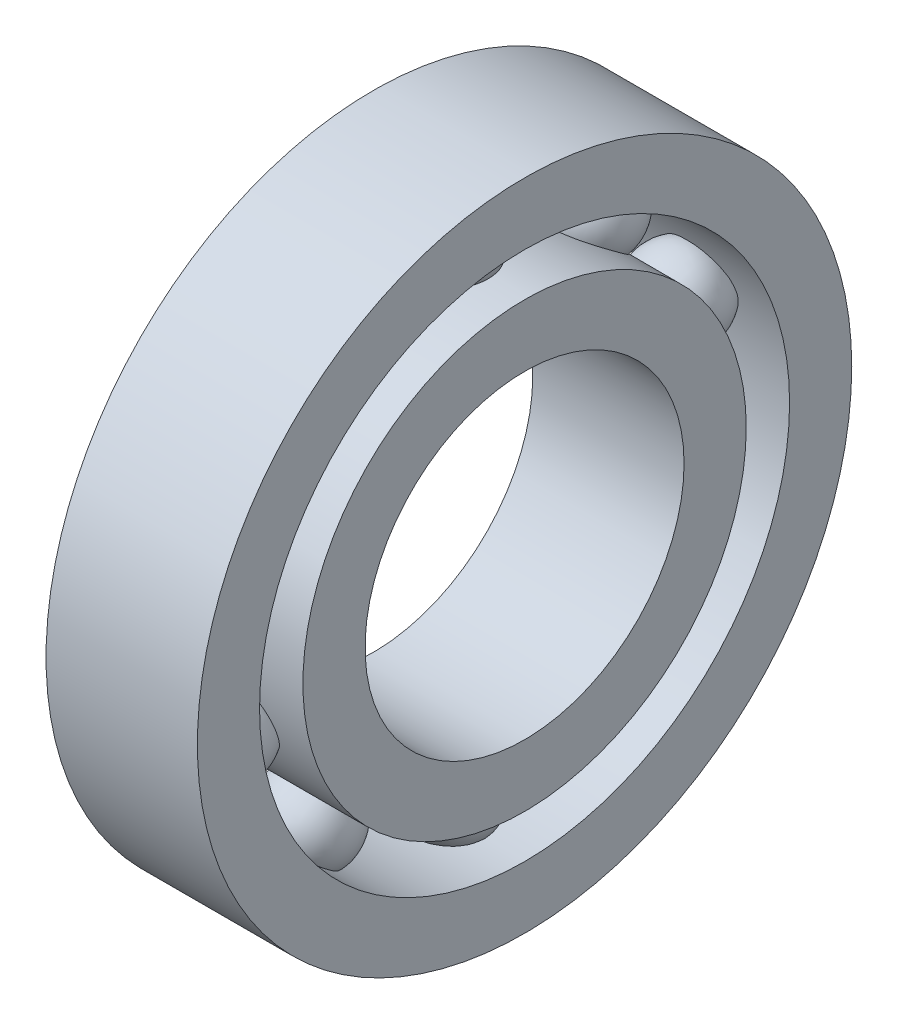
ISO-10303-21;
HEADER;
FILE_DESCRIPTION(('STEP AP214'),'2;1');
FILE_NAME('part.step','',(''),(''),'','','');
FILE_SCHEMA(('AUTOMOTIVE_DESIGN { 1 0 10303 214 1 1 1 1 }'));
ENDSEC;
DATA;
#1=APPLICATION_CONTEXT('core data for automotive mechanical design processes');
#2=APPLICATION_PROTOCOL_DEFINITION('international standard','automotive_design',2000,#1);
#3=PRODUCT_CONTEXT('',#1,'mechanical');
#4=PRODUCT('Part','Part','',(#3));
#5=PRODUCT_RELATED_PRODUCT_CATEGORY('part','',(#4));
#6=PRODUCT_DEFINITION_FORMATION('','',#4);
#7=PRODUCT_DEFINITION_CONTEXT('part definition',#1,'design');
#8=PRODUCT_DEFINITION('design','',#6,#7);
#9=PRODUCT_DEFINITION_SHAPE('','',#8);
#10=(LENGTH_UNIT() NAMED_UNIT(*) SI_UNIT(.MILLI.,.METRE.));
#11=(NAMED_UNIT(*) PLANE_ANGLE_UNIT() SI_UNIT($,.RADIAN.));
#12=(NAMED_UNIT(*) SI_UNIT($,.STERADIAN.) SOLID_ANGLE_UNIT());
#13=UNCERTAINTY_MEASURE_WITH_UNIT(LENGTH_MEASURE(1.E-05),#10,'distance_accuracy_value','');
#14=(GEOMETRIC_REPRESENTATION_CONTEXT(3) GLOBAL_UNCERTAINTY_ASSIGNED_CONTEXT((#13)) GLOBAL_UNIT_ASSIGNED_CONTEXT((#10,
#11,#12)) REPRESENTATION_CONTEXT('',''));
#15=CARTESIAN_POINT('',(0.,0.,0.));
#16=DIRECTION('',(0.,0.,1.));
#17=DIRECTION('',(1.,0.,0.));
#18=AXIS2_PLACEMENT_3D('',#15,#16,#17);
#19=CARTESIAN_POINT('',(-37.,54.2,0.));
#20=DIRECTION('',(-1.,0.,0.));
#21=DIRECTION('',(0.,0.,1.));
#22=AXIS2_PLACEMENT_3D('',#19,#20,#21);
#23=PLANE('',#22);
#24=CARTESIAN_POINT('',(-37.,0.,0.));
#25=DIRECTION('',(1.,0.,0.));
#26=DIRECTION('',(0.,0.,-1.));
#27=AXIS2_PLACEMENT_3D('',#24,#25,#26);
#28=CIRCLE('',#27,39.);
#29=CARTESIAN_POINT('',(-37.,0.,-39.));
#30=VERTEX_POINT('',#29);
#31=EDGE_CURVE('E137',#30,#30,#28,.T.);
#32=ORIENTED_EDGE('',*,*,#31,.T.);
#33=EDGE_LOOP('',(#32));
#34=FACE_BOUND('',#33,.T.);
#35=CARTESIAN_POINT('',(-37.,0.,0.));
#36=DIRECTION('',(1.,0.,0.));
#37=DIRECTION('',(0.,0.,-1.));
#38=AXIS2_PLACEMENT_3D('',#35,#36,#37);
#39=CIRCLE('',#38,54.2);
#40=CARTESIAN_POINT('',(-37.,0.,-54.2));
#41=VERTEX_POINT('',#40);
#42=EDGE_CURVE('E162',#41,#41,#39,.T.);
#43=ORIENTED_EDGE('',*,*,#42,.F.);
#44=EDGE_LOOP('',(#43));
#45=FACE_BOUND('',#44,.T.);
#46=ADVANCED_FACE('F38',(#34,#45),#23,.T.);
#47=CARTESIAN_POINT('',(0.,0.,0.));
#48=DIRECTION('',(1.,0.,0.));
#49=DIRECTION('',(0.,0.,-1.));
#50=AXIS2_PLACEMENT_3D('',#47,#48,#49);
#51=CYLINDRICAL_SURFACE('',#50,39.);
#52=CARTESIAN_POINT('',(0.,0.,0.));
#53=DIRECTION('',(1.,0.,0.));
#54=DIRECTION('',(0.,0.,-1.));
#55=AXIS2_PLACEMENT_3D('',#52,#53,#54);
#56=CIRCLE('',#55,39.);
#57=CARTESIAN_POINT('',(0.,0.,-39.));
#58=VERTEX_POINT('',#57);
#59=EDGE_CURVE('E167',#58,#58,#56,.T.);
#60=ORIENTED_EDGE('',*,*,#59,.T.);
#61=EDGE_LOOP('',(#60));
#62=FACE_BOUND('',#61,.T.);
#63=ORIENTED_EDGE('',*,*,#31,.F.);
#64=EDGE_LOOP('',(#63));
#65=FACE_BOUND('',#64,.T.);
#66=ADVANCED_FACE('F151',(#62,#65),#51,.F.);
#67=CARTESIAN_POINT('',(0.,39.,0.));
#68=DIRECTION('',(1.,0.,0.));
#69=DIRECTION('',(0.,0.,-1.));
#70=AXIS2_PLACEMENT_3D('',#67,#68,#69);
#71=PLANE('',#70);
#72=CARTESIAN_POINT('',(0.,0.,0.));
#73=DIRECTION('',(1.,0.,0.));
#74=DIRECTION('',(0.,0.,-1.));
#75=AXIS2_PLACEMENT_3D('',#72,#73,#74);
#76=CIRCLE('',#75,54.2);
#77=CARTESIAN_POINT('',(0.,0.,-54.2));
#78=VERTEX_POINT('',#77);
#79=EDGE_CURVE('E164',#78,#78,#76,.T.);
#80=ORIENTED_EDGE('',*,*,#79,.T.);
#81=EDGE_LOOP('',(#80));
#82=FACE_BOUND('',#81,.T.);
#83=ORIENTED_EDGE('',*,*,#59,.F.);
#84=EDGE_LOOP('',(#83));
#85=FACE_BOUND('',#84,.T.);
#86=ADVANCED_FACE('F148',(#82,#85),#71,.T.);
#87=CARTESIAN_POINT('',(0.,0.,0.));
#88=DIRECTION('',(1.,0.,0.));
#89=DIRECTION('',(0.,0.,-1.));
#90=AXIS2_PLACEMENT_3D('',#87,#88,#89);
#91=CYLINDRICAL_SURFACE('',#90,54.2);
#92=CARTESIAN_POINT('',(-18.5,37.7938725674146,-38.8492367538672));
#93=CARTESIAN_POINT('',(-18.7777529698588,37.79386935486,-38.8492381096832));
#94=CARTESIAN_POINT('',(-19.0554510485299,37.8021802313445,-38.8411594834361));
#95=CARTESIAN_POINT('',(-19.6089991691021,37.8353423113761,-38.8088577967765));
#96=CARTESIAN_POINT('',(-19.8848488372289,37.8601967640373,-38.7846315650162));
#97=CARTESIAN_POINT('',(-20.4329083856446,37.9262499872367,-38.7200424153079));
#98=CARTESIAN_POINT('',(-20.7051150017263,37.9674625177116,-38.6796659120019));
#99=CARTESIAN_POINT('',(-21.2437260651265,38.0658444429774,-38.5828491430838));
#100=CARTESIAN_POINT('',(-21.5101306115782,38.1230135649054,-38.5264091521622));
#101=CARTESIAN_POINT('',(-22.0353286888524,38.2527984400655,-38.3975490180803));
#102=CARTESIAN_POINT('',(-22.2941189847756,38.3254206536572,-38.3251221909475));
#103=CARTESIAN_POINT('',(-22.8020665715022,38.4854085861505,-38.1644621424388));
#104=CARTESIAN_POINT('',(-23.0512237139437,38.5727745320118,-38.0762286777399));
#105=CARTESIAN_POINT('',(-23.5379602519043,38.7613905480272,-37.884201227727));
#106=CARTESIAN_POINT('',(-23.7755419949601,38.862637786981,-37.7804104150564));
#107=CARTESIAN_POINT('',(-24.2373180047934,39.078044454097,-37.5575617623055));
#108=CARTESIAN_POINT('',(-24.4615125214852,39.1922036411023,-37.438504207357));
#109=CARTESIAN_POINT('',(-24.891478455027,39.4305257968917,-37.1874056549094));
#110=CARTESIAN_POINT('',(-25.0974739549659,39.5545151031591,-37.0555836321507));
#111=CARTESIAN_POINT('',(-25.4930174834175,39.8127296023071,-36.7780162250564));
#112=CARTESIAN_POINT('',(-25.6825658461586,39.9469545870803,-36.6322711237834));
#113=CARTESIAN_POINT('',(-26.0435782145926,40.22430586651,-36.3275054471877));
#114=CARTESIAN_POINT('',(-26.2150443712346,40.3674310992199,-36.1684864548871));
#115=CARTESIAN_POINT('',(-26.5383887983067,40.6611718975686,-35.8379403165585));
#116=CARTESIAN_POINT('',(-26.6902677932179,40.8117871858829,-35.666413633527));
#117=CARTESIAN_POINT('',(-26.9673675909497,41.1128405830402,-35.3189049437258));
#118=CARTESIAN_POINT('',(-27.0934125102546,41.2630441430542,-35.1433765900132));
#119=CARTESIAN_POINT('',(-27.3250401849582,41.5675638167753,-34.782658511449));
#120=CARTESIAN_POINT('',(-27.430624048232,41.7218797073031,-34.5974693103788));
#121=CARTESIAN_POINT('',(-27.6203472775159,42.0331672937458,-34.218605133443));
#122=CARTESIAN_POINT('',(-27.704491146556,42.1901384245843,-34.0249319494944));
#123=CARTESIAN_POINT('',(-27.8505680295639,42.5053268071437,-33.6303573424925));
#124=CARTESIAN_POINT('',(-27.9125017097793,42.6635440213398,-33.4294561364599));
#125=CARTESIAN_POINT('',(-28.0114381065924,42.9731486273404,-33.0304339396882));
#126=CARTESIAN_POINT('',(-28.0493792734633,43.1245435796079,-32.8325509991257));
#127=CARTESIAN_POINT('',(-28.1040031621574,43.4260087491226,-32.4327682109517));
#128=CARTESIAN_POINT('',(-28.120678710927,43.5760785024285,-32.2308670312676));
#129=CARTESIAN_POINT('',(-28.1325920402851,43.8736045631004,-31.8246786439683));
#130=CARTESIAN_POINT('',(-28.1278405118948,44.0210621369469,-31.62039267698));
#131=CARTESIAN_POINT('',(-28.0969615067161,44.3124153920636,-31.2107838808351));
#132=CARTESIAN_POINT('',(-28.0708261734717,44.4563097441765,-31.005460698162));
#133=CARTESIAN_POINT('',(-27.998158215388,44.7365962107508,-30.5996166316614));
#134=CARTESIAN_POINT('',(-27.9520532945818,44.8730815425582,-30.3990833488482));
#135=CARTESIAN_POINT('',(-27.8399271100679,45.1408549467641,-30.000016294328));
#136=CARTESIAN_POINT('',(-27.7738985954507,45.2721411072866,-29.8014832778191));
#137=CARTESIAN_POINT('',(-27.6225192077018,45.5286892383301,-29.4080531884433));
#138=CARTESIAN_POINT('',(-27.5371760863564,45.6539536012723,-29.2131546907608));
#139=CARTESIAN_POINT('',(-27.3478139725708,45.8979577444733,-28.8282747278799));
#140=CARTESIAN_POINT('',(-27.2437866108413,46.0166945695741,-28.6382955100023));
#141=CARTESIAN_POINT('',(-27.0164765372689,46.2485464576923,-28.2623662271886));
#142=CARTESIAN_POINT('',(-26.892965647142,46.3615707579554,-28.0764981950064));
#143=CARTESIAN_POINT('',(-26.6287075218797,46.5798885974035,-27.7127940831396));
#144=CARTESIAN_POINT('',(-26.48796730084,46.6851852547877,-27.5349547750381));
#145=CARTESIAN_POINT('',(-26.1902177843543,46.8878333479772,-27.1884423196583));
#146=CARTESIAN_POINT('',(-26.0332006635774,46.9851809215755,-27.0197736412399));
#147=CARTESIAN_POINT('',(-25.7041696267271,47.1716173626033,-26.6929561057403));
#148=CARTESIAN_POINT('',(-25.532160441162,47.2607088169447,-26.534803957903));
#149=CARTESIAN_POINT('',(-25.1676245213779,47.4336977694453,-26.2243602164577));
#150=CARTESIAN_POINT('',(-24.9745708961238,47.5172761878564,-26.0725093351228));
#151=CARTESIAN_POINT('',(-24.5750804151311,47.6752990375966,-25.7824192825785));
#152=CARTESIAN_POINT('',(-24.3686476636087,47.7497462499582,-25.6441759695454));
#153=CARTESIAN_POINT('',(-23.9437088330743,47.8895316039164,-25.382175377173));
#154=CARTESIAN_POINT('',(-23.7251970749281,47.9548654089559,-25.2584249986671));
#155=CARTESIAN_POINT('',(-23.277760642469,48.0763654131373,-25.0263908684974));
#156=CARTESIAN_POINT('',(-23.0488390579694,48.1325343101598,-24.9181025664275));
#157=CARTESIAN_POINT('',(-22.572197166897,48.2379353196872,-24.713466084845));
#158=CARTESIAN_POINT('',(-22.3240912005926,48.2867752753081,-24.6178135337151));
#159=CARTESIAN_POINT('',(-21.8198963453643,48.3746080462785,-24.4447686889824));
#160=CARTESIAN_POINT('',(-21.563807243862,48.413600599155,-24.3673768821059));
#161=CARTESIAN_POINT('',(-21.0453733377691,48.4817987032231,-24.2314049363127));
#162=CARTESIAN_POINT('',(-20.7830277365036,48.511003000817,-24.1728272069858));
#163=CARTESIAN_POINT('',(-20.2538770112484,48.5596695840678,-24.0749139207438));
#164=CARTESIAN_POINT('',(-19.9870717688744,48.5791316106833,-24.0355788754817));
#165=CARTESIAN_POINT('',(-19.442883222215,48.6087815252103,-23.9755608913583));
#166=CARTESIAN_POINT('',(-19.1654196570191,48.6186796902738,-23.9554608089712));
#167=CARTESIAN_POINT('',(-18.6095872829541,48.6282142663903,-23.9361001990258));
#168=CARTESIAN_POINT('',(-18.3312184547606,48.6278504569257,-23.9368401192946));
#169=CARTESIAN_POINT('',(-17.7754933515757,48.616859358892,-23.9591556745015));
#170=CARTESIAN_POINT('',(-17.4981371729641,48.6062311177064,-23.9807332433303));
#171=CARTESIAN_POINT('',(-16.9464107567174,48.5746862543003,-24.0445652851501));
#172=CARTESIAN_POINT('',(-16.6720404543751,48.5537698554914,-24.0868193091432));
#173=CARTESIAN_POINT('',(-16.1257926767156,48.5013725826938,-24.1921546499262));
#174=CARTESIAN_POINT('',(-15.8539591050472,48.4697993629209,-24.2554179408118));
#175=CARTESIAN_POINT('',(-15.3172729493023,48.3960766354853,-24.4021823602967));
#176=CARTESIAN_POINT('',(-15.0524204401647,48.3539270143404,-24.4856837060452));
#177=CARTESIAN_POINT('',(-14.5316675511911,48.258988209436,-24.6722720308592));
#178=CARTESIAN_POINT('',(-14.275767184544,48.2061990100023,-24.7753590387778));
#179=CARTESIAN_POINT('',(-13.7748737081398,48.0899267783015,-25.00029925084));
#180=CARTESIAN_POINT('',(-13.5298804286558,48.0264439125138,-25.1221521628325));
#181=CARTESIAN_POINT('',(-13.055952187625,47.8896856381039,-25.3818684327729));
#182=CARTESIAN_POINT('',(-12.8268449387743,47.8165541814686,-25.5194931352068));
#183=CARTESIAN_POINT('',(-12.3829336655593,47.6598688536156,-25.8109329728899));
#184=CARTESIAN_POINT('',(-12.1681294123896,47.5763151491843,-25.9647478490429));
#185=CARTESIAN_POINT('',(-11.7546141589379,47.3988697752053,-26.2872784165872));
#186=CARTESIAN_POINT('',(-11.5559012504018,47.3049793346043,-26.455992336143));
#187=CARTESIAN_POINT('',(-11.1762464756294,47.1070108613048,-26.8069038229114));
#188=CARTESIAN_POINT('',(-10.9953040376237,47.0029331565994,-26.9891009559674));
#189=CARTESIAN_POINT('',(-10.6587484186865,46.7886394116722,-27.3588610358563));
#190=CARTESIAN_POINT('',(-10.5024742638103,46.6787616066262,-27.5460185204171));
#191=CARTESIAN_POINT('',(-10.209345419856,46.4501104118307,-27.929860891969));
#192=CARTESIAN_POINT('',(-10.072489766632,46.3313374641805,-28.1265453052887));
#193=CARTESIAN_POINT('',(-9.81945111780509,46.085393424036,-28.5277383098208));
#194=CARTESIAN_POINT('',(-9.70326385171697,45.9582240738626,-28.7322452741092));
#195=CARTESIAN_POINT('',(-9.49261431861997,45.6960810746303,-29.1473568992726));
#196=CARTESIAN_POINT('',(-9.39815129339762,45.5611076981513,-29.3579613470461));
#197=CARTESIAN_POINT('',(-9.23551736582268,45.290218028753,-29.7740666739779));
#198=CARTESIAN_POINT('',(-9.16637258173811,45.1546044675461,-29.9793844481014));
#199=CARTESIAN_POINT('',(-9.0493901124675,44.8777400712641,-30.3922722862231));
#200=CARTESIAN_POINT('',(-9.00155152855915,44.7364894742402,-30.5998422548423));
#201=CARTESIAN_POINT('',(-8.92762546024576,44.4492888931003,-31.0155530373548));
#202=CARTESIAN_POINT('',(-8.90153439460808,44.3033396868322,-31.2236937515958));
#203=CARTESIAN_POINT('',(-8.87133338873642,44.0077499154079,-31.6389458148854));
#204=CARTESIAN_POINT('',(-8.86722311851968,43.8581094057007,-31.8460571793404));
#205=CARTESIAN_POINT('',(-8.88081143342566,43.5608341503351,-32.2514339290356));
#206=CARTESIAN_POINT('',(-8.89785444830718,43.4132755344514,-32.4497774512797));
#207=CARTESIAN_POINT('',(-8.9525053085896,43.1168014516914,-32.8426859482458));
#208=CARTESIAN_POINT('',(-8.99012006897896,42.9678855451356,-33.0372496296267));
#209=CARTESIAN_POINT('',(-9.08557285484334,42.6699634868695,-33.4211494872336));
#210=CARTESIAN_POINT('',(-9.14340298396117,42.5209573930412,-33.6104876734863));
#211=CARTESIAN_POINT('',(-9.27881754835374,42.2239334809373,-33.982880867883));
#212=CARTESIAN_POINT('',(-9.35640897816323,42.07591603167,-34.165933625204));
#213=CARTESIAN_POINT('',(-9.53076843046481,41.7819857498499,-34.5247666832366));
#214=CARTESIAN_POINT('',(-9.62755475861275,41.6360750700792,-34.7005398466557));
#215=CARTESIAN_POINT('',(-9.83946725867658,41.3476999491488,-35.0436576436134));
#216=CARTESIAN_POINT('',(-9.95459392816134,41.205235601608,-35.2110020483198));
#217=CARTESIAN_POINT('',(-10.2022942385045,40.9249067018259,-35.5364341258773));
#218=CARTESIAN_POINT('',(-10.3348710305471,40.7870429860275,-35.6945201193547));
#219=CARTESIAN_POINT('',(-10.6163982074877,40.5171148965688,-36.0006255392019));
#220=CARTESIAN_POINT('',(-10.7653441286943,40.3850489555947,-36.1486476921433));
#221=CARTESIAN_POINT('',(-11.0833129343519,40.1238333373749,-36.4384028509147));
#222=CARTESIAN_POINT('',(-11.2528091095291,39.9948949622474,-36.5798070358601));
#223=CARTESIAN_POINT('',(-11.6067683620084,39.7453884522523,-36.8507533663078));
#224=CARTESIAN_POINT('',(-11.7912313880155,39.6248202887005,-36.9802955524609));
#225=CARTESIAN_POINT('',(-12.1738484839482,39.3930373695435,-37.2271041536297));
#226=CARTESIAN_POINT('',(-12.3720070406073,39.2818257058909,-37.3443665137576));
#227=CARTESIAN_POINT('',(-12.780573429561,39.0697316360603,-37.5662032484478));
#228=CARTESIAN_POINT('',(-12.9909815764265,38.9688494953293,-37.6707772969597));
#229=CARTESIAN_POINT('',(-13.4319364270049,38.7741397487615,-37.8711822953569));
#230=CARTESIAN_POINT('',(-13.6629602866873,38.6808039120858,-37.9664418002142));
#231=CARTESIAN_POINT('',(-14.1350626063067,38.5071427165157,-38.1425648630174));
#232=CARTESIAN_POINT('',(-14.3761380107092,38.4268134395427,-38.223432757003));
#233=CARTESIAN_POINT('',(-14.8666451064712,38.2798681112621,-38.370594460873));
#234=CARTESIAN_POINT('',(-15.116073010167,38.2132459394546,-38.4368947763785));
#235=CARTESIAN_POINT('',(-15.6216269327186,38.0942619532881,-38.5548206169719));
#236=CARTESIAN_POINT('',(-15.8777518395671,38.041897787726,-38.6064485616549));
#237=CARTESIAN_POINT('',(-16.5227508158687,37.9296601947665,-38.716791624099));
#238=CARTESIAN_POINT('',(-16.9148145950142,37.8788134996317,-38.7664508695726));
#239=CARTESIAN_POINT('',(-17.7046229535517,37.8109214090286,-38.8326730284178));
#240=CARTESIAN_POINT('',(-18.1023677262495,37.7938771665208,-38.8492348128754));
#241=CARTESIAN_POINT('',(-18.5,37.7938725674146,-38.8492367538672));
#242=B_SPLINE_CURVE_WITH_KNOTS('',3,(#92,#93,#94,#95,#96,#97,#98,#99,#100,#101,#102,#103,#104,
#105,#106,#107,#108,#109,#110,#111,#112,#113,#114,#115,#116,#117,#118,#119,#120,#121,#122,#123,
#124,#125,#126,#127,#128,#129,#130,#131,#132,#133,#134,#135,#136,#137,#138,#139,#140,#141,#142,
#143,#144,#145,#146,#147,#148,#149,#150,#151,#152,#153,#154,#155,#156,#157,#158,#159,#160,#161,
#162,#163,#164,#165,#166,#167,#168,#169,#170,#171,#172,#173,#174,#175,#176,#177,#178,#179,#180,
#181,#182,#183,#184,#185,#186,#187,#188,#189,#190,#191,#192,#193,#194,#195,#196,#197,#198,#199,
#200,#201,#202,#203,#204,#205,#206,#207,#208,#209,#210,#211,#212,#213,#214,#215,#216,#217,#218,
#219,#220,#221,#222,#223,#224,#225,#226,#227,#228,#229,#230,#231,#232,#233,#234,#235,#236,#237,
#238,#239,#240,#241),.UNSPECIFIED.,.T.,.F.,(4,2,2,2,2,2,2,2,2,2,2,2,2,2,2,2,2,2,2,2,2,2,2,2,2,2,
2,2,2,2,2,2,2,2,2,2,2,2,2,2,2,2,2,2,2,2,2,2,2,2,2,2,2,2,2,2,2,2,2,2,2,2,2,2,2,2,2,2,2,2,2,2,2,2,
4),(0.,0.832922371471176,1.66600837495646,2.49979663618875,3.33357064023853,4.1676939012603,
5.00183000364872,5.83579622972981,6.66974688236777,7.49131762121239,8.31287166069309,
9.13432786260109,9.95575367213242,10.7442774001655,11.5327584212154,12.3210737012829,
13.1093653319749,13.8645247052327,14.6199387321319,15.3749758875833,16.1302905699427,
16.8701713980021,17.6103218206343,18.3501757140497,19.0903618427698,19.8399667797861,
20.5892675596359,21.3389302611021,22.0883572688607,22.8658260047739,23.6430573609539,
24.4206573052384,25.1980279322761,26.0081634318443,26.8183205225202,27.6285813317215,
28.4388636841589,29.2729870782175,30.1071283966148,30.9413471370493,31.7755477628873,
32.6171710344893,33.4588033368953,34.3004368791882,35.142057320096,35.9723025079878,
36.8025344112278,37.6326677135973,38.4627742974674,39.2640814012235,40.0653487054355,
40.8664502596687,41.6675238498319,42.4333542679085,43.199152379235,43.9648243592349,
44.7304848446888,45.4729978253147,46.2157605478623,46.9582334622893,47.700969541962,
48.4444173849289,49.1878854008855,49.9314878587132,50.6748880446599,51.4409281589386,
52.2069656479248,52.9732552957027,53.7395646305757,54.5389174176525,55.3380289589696,
56.136782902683,56.9354050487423,58.1277794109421,59.3201944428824),.UNSPECIFIED.);
#243=CARTESIAN_POINT('',(-18.5,37.7938725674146,-38.8492367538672));
#244=VERTEX_POINT('',#243);
#245=EDGE_CURVE('E11',#244,#244,#242,.T.);
#246=ORIENTED_EDGE('',*,*,#245,.F.);
#247=EDGE_LOOP('',(#246));
#248=FACE_BOUND('',#247,.T.);
#249=CARTESIAN_POINT('',(-18.5,25.2688709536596,-47.949182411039));
#250=CARTESIAN_POINT('',(-18.2222470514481,25.2688732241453,-47.9491798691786));
#251=CARTESIAN_POINT('',(-17.9445489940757,25.2586217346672,-47.954588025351));
#252=CARTESIAN_POINT('',(-17.3910008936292,25.2176533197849,-47.97614561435));
#253=CARTESIAN_POINT('',(-17.1151512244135,25.1869323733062,-47.9922971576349));
#254=CARTESIAN_POINT('',(-16.5670916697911,25.1050928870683,-48.0351582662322));
#255=CARTESIAN_POINT('',(-16.2948850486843,25.0539571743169,-48.0618767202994));
#256=CARTESIAN_POINT('',(-15.7562739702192,24.9314772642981,-48.1255254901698));
#257=CARTESIAN_POINT('',(-15.4898694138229,24.8601334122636,-48.1624556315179));
#258=CARTESIAN_POINT('',(-14.9646713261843,24.6974744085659,-48.2460684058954));
#259=CARTESIAN_POINT('',(-14.7058810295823,24.606150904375,-48.2927551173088));
#260=CARTESIAN_POINT('',(-14.1979334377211,24.4039151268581,-48.3952660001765));
#261=CARTESIAN_POINT('',(-13.9487762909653,24.2930025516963,-48.4510903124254));
#262=CARTESIAN_POINT('',(-13.4620397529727,24.0520880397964,-48.5711350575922));
#263=CARTESIAN_POINT('',(-13.2244580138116,23.9220899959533,-48.6353537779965));
#264=CARTESIAN_POINT('',(-12.7626820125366,23.6435840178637,-48.7713536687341));
#265=CARTESIAN_POINT('',(-12.5384875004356,23.495076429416,-48.8431346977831));
#266=CARTESIAN_POINT('',(-12.1085215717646,23.1826219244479,-48.9921988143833));
#267=CARTESIAN_POINT('',(-11.9025260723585,23.0189369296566,-49.0693844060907));
#268=CARTESIAN_POINT('',(-11.5069825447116,22.6751619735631,-49.2291879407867));
#269=CARTESIAN_POINT('',(-11.3174341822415,22.4950723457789,-49.3118057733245));
#270=CARTESIAN_POINT('',(-10.9564218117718,22.1195167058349,-49.4814047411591));
#271=CARTESIAN_POINT('',(-10.7849556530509,21.9240525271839,-49.5683853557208));
#272=CARTESIAN_POINT('',(-10.461611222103,21.5189135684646,-49.7456050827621));
#273=CARTESIAN_POINT('',(-10.3097322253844,21.3092393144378,-49.8358440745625));
#274=CARTESIAN_POINT('',(-10.0326324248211,20.8857082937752,-50.0147767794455));
#275=CARTESIAN_POINT('',(-9.90658750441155,20.6723554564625,-50.10338760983));
#276=CARTESIAN_POINT('',(-9.67495982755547,20.235190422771,-50.2815350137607));
#277=CARTESIAN_POINT('',(-9.56937596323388,20.0113787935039,-50.3710715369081));
#278=CARTESIAN_POINT('',(-9.3796527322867,19.5548643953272,-50.5500481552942));
#279=CARTESIAN_POINT('',(-9.2955088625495,19.3221635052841,-50.6394882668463));
#280=CARTESIAN_POINT('',(-9.14943197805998,18.8495021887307,-50.8173199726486));
#281=CARTESIAN_POINT('',(-9.08749829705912,18.6095419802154,-50.9057115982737));
#282=CARTESIAN_POINT('',(-8.98856189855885,18.134376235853,-51.0768584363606));
#283=CARTESIAN_POINT('',(-8.95062073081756,17.8993947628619,-51.1596944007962));
#284=CARTESIAN_POINT('',(-8.89599684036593,17.4260208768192,-51.3228651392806));
#285=CARTESIAN_POINT('',(-8.87932129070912,17.1876273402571,-51.4031990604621));
#286=CARTESIAN_POINT('',(-8.86740795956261,16.7093786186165,-51.5606440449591));
#287=CARTESIAN_POINT('',(-8.87215948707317,16.4695242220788,-51.637756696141));
#288=CARTESIAN_POINT('',(-8.90303849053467,15.9899299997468,-51.788274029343));
#289=CARTESIAN_POINT('',(-8.9291738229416,15.7501902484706,-51.861677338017));
#290=CARTESIAN_POINT('',(-9.00184177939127,15.2775963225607,-52.0028328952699));
#291=CARTESIAN_POINT('',(-9.04794669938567,15.0447015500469,-52.0706699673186));
#292=CARTESIAN_POINT('',(-9.16007288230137,14.5824196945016,-52.2020191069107));
#293=CARTESIAN_POINT('',(-9.22610139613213,14.3530339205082,-52.2655295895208));
#294=CARTESIAN_POINT('',(-9.37748078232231,13.8995819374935,-52.3879447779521));
#295=CARTESIAN_POINT('',(-9.46282390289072,13.675513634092,-52.4468513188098));
#296=CARTESIAN_POINT('',(-9.6521860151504,13.2340696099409,-52.559978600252));
#297=CARTESIAN_POINT('',(-9.75621337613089,13.0166969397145,-52.6141972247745));
#298=CARTESIAN_POINT('',(-9.98352344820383,12.587520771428,-52.7185329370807));
#299=CARTESIAN_POINT('',(-10.1070343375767,12.3758233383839,-52.7685890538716));
#300=CARTESIAN_POINT('',(-10.3712924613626,11.9624562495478,-52.8638309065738));
#301=CARTESIAN_POINT('',(-10.5120326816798,11.7607825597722,-52.9090186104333));
#302=CARTESIAN_POINT('',(-10.8097821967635,11.3686079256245,-52.9946701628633));
#303=CARTESIAN_POINT('',(-10.9667993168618,11.178112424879,-53.0351317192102));
#304=CARTESIAN_POINT('',(-11.2958303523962,10.8096784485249,-53.1114511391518));
#305=CARTESIAN_POINT('',(-11.4678395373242,10.6317360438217,-53.1473104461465));
#306=CARTESIAN_POINT('',(-11.8323754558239,10.2830299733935,-53.2159003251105));
#307=CARTESIAN_POINT('',(-12.02542908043,10.1127840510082,-53.2484636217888));
#308=CARTESIAN_POINT('',(-12.4249195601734,9.78806026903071,-53.3091095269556));
#309=CARTESIAN_POINT('',(-12.6313523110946,9.63357761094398,-53.3371935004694));
#310=CARTESIAN_POINT('',(-13.0562911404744,9.3412041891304,-53.3891746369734));
#311=CARTESIAN_POINT('',(-13.2748028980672,9.20332132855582,-53.4130698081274));
#312=CARTESIAN_POINT('',(-13.7222393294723,8.94509818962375,-53.4569206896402));
#313=CARTESIAN_POINT('',(-13.9511609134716,8.824752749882,-53.476877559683));
#314=CARTESIAN_POINT('',(-14.4278028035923,8.5975611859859,-53.513883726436));
#315=CARTESIAN_POINT('',(-14.6759087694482,8.49149782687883,-53.5307750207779));
#316=CARTESIAN_POINT('',(-15.1801036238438,8.29978057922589,-53.5608351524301));
#317=CARTESIAN_POINT('',(-15.436192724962,8.21412723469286,-53.5740038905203));
#318=CARTESIAN_POINT('',(-15.9546266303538,8.06373585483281,-53.5968465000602));
#319=CARTESIAN_POINT('',(-16.2169722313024,7.99900049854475,-53.6065199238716));
#320=CARTESIAN_POINT('',(-16.7461229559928,7.89084062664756,-53.6225477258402));
#321=CARTESIAN_POINT('',(-17.0129281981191,7.8474166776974,-53.6289020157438));
#322=CARTESIAN_POINT('',(-17.5571167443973,7.78117385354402,-53.6385541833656));
#323=CARTESIAN_POINT('',(-17.8345803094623,7.75899883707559,-53.6417566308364));
#324=CARTESIAN_POINT('',(-18.3904126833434,7.73763945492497,-53.644841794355));
#325=CARTESIAN_POINT('',(-18.668781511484,7.73845558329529,-53.6447244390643));
#326=CARTESIAN_POINT('',(-19.2245066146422,7.7630753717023,-53.6411671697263));
#327=CARTESIAN_POINT('',(-19.5018627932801,7.78688116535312,-53.637726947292));
#328=CARTESIAN_POINT('',(-20.0535892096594,7.85733694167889,-53.627451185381));
#329=CARTESIAN_POINT('',(-20.3279595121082,7.90398642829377,-53.6206157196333));
#330=CARTESIAN_POINT('',(-20.8742072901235,8.02035793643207,-53.6033333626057));
#331=CARTESIAN_POINT('',(-21.1460408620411,8.09028156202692,-53.5928548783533));
#332=CARTESIAN_POINT('',(-21.6827270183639,8.2526443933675,-53.5680930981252));
#333=CARTESIAN_POINT('',(-21.9475795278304,8.34508384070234,-53.5538097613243));
#334=CARTESIAN_POINT('',(-22.4683324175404,8.55187758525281,-53.521176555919));
#335=CARTESIAN_POINT('',(-22.7242327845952,8.66623191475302,-53.502826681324));
#336=CARTESIAN_POINT('',(-23.2251262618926,8.91609286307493,-53.4617555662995));
#337=CARTESIAN_POINT('',(-23.4701195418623,9.0515991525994,-53.4390343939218));
#338=CARTESIAN_POINT('',(-23.9440477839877,9.34086463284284,-53.3892262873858));
#339=CARTESIAN_POINT('',(-24.1731550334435,9.49435236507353,-53.3622025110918));
#340=CARTESIAN_POINT('',(-24.6170663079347,9.81994654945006,-53.3032457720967));
#341=CARTESIAN_POINT('',(-24.8318705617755,9.99205270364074,-53.271312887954));
#342=CARTESIAN_POINT('',(-25.245385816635,10.3536311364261,-53.2022197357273));
#343=CARTESIAN_POINT('',(-25.4440987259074,10.5431013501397,-53.1650600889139));
#344=CARTESIAN_POINT('',(-25.8237535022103,10.9380136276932,-53.0852184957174));
#345=CARTESIAN_POINT('',(-26.00469594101,11.1434551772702,-53.0425367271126));
#346=CARTESIAN_POINT('',(-26.3412515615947,11.5613383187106,-52.9529934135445));
#347=CARTESIAN_POINT('',(-26.4975257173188,11.7732897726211,-52.9063282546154));
#348=CARTESIAN_POINT('',(-26.7906545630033,12.2090026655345,-52.8074818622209));
#349=CARTESIAN_POINT('',(-26.9275102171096,12.4327635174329,-52.7553009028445));
#350=CARTESIAN_POINT('',(-27.180548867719,12.8903216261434,-52.645369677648));
#351=CARTESIAN_POINT('',(-27.2967361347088,13.1241167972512,-52.5876205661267));
#352=CARTESIAN_POINT('',(-27.5073856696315,13.5999180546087,-52.4665843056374));
#353=CARTESIAN_POINT('',(-27.6018486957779,13.841923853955,-52.4032973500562));
#354=CARTESIAN_POINT('',(-27.7644826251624,14.3213730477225,-52.2742495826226));
#355=CARTESIAN_POINT('',(-27.8336274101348,14.5585487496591,-52.2087201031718));
#356=CARTESIAN_POINT('',(-27.9506098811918,15.0367842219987,-52.0729957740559));
#357=CARTESIAN_POINT('',(-27.9984484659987,15.2778438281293,-52.0028011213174));
#358=CARTESIAN_POINT('',(-28.0723745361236,15.7619581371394,-51.8581188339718));
#359=CARTESIAN_POINT('',(-28.0984656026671,16.0050125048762,-51.7836319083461));
#360=CARTESIAN_POINT('',(-28.1286666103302,16.4912829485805,-51.6308292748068));
#361=CARTESIAN_POINT('',(-28.1327768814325,16.7344990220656,-51.552513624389));
#362=CARTESIAN_POINT('',(-28.1191885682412,17.2118983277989,-51.3950563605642));
#363=CARTESIAN_POINT('',(-28.1021455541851,17.4461323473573,-51.316011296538));
#364=CARTESIAN_POINT('',(-28.047494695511,17.9114260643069,-51.1554630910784));
#365=CARTESIAN_POINT('',(-28.0098799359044,18.1424846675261,-51.0739591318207));
#366=CARTESIAN_POINT('',(-27.914427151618,18.5996581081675,-50.9092499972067));
#367=CARTESIAN_POINT('',(-27.8565970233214,18.8257748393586,-50.826045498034));
#368=CARTESIAN_POINT('',(-27.7211824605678,19.2717272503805,-50.6586347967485));
#369=CARTESIAN_POINT('',(-27.6435910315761,19.4915606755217,-50.5744282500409));
#370=CARTESIAN_POINT('',(-27.4692315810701,19.923660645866,-50.4057694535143));
#371=CARTESIAN_POINT('',(-27.3724452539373,20.1359197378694,-50.3213170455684));
#372=CARTESIAN_POINT('',(-27.1605327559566,20.5513569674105,-50.1530852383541));
#373=CARTESIAN_POINT('',(-27.0454060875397,20.7545348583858,-50.0693058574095));
#374=CARTESIAN_POINT('',(-26.7977057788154,21.1506655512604,-49.9032612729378));
#375=CARTESIAN_POINT('',(-26.6651289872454,21.343616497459,-49.8209963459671));
#376=CARTESIAN_POINT('',(-26.3836018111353,21.7181524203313,-49.6588712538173));
#377=CARTESIAN_POINT('',(-26.2346558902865,21.8997404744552,-49.5790104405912));
#378=CARTESIAN_POINT('',(-25.9166870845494,22.2560340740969,-49.4201188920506));
#379=CARTESIAN_POINT('',(-25.7471909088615,22.4303615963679,-49.3411875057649));
#380=CARTESIAN_POINT('',(-25.3932316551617,22.7651486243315,-49.1876197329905));
#381=CARTESIAN_POINT('',(-25.2087686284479,22.9256081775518,-49.1129833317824));
#382=CARTESIAN_POINT('',(-24.8261515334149,23.2319619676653,-48.9688127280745));
#383=CARTESIAN_POINT('',(-24.6279929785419,23.3778513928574,-48.8992802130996));
#384=CARTESIAN_POINT('',(-24.2194265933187,23.6543713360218,-48.7661180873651));
#385=CARTESIAN_POINT('',(-24.0090184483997,23.7850014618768,-48.7024886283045));
#386=CARTESIAN_POINT('',(-23.5680636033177,24.0357665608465,-48.5792372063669));
#387=CARTESIAN_POINT('',(-23.3370397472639,24.1552060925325,-48.5199063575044));
#388=CARTESIAN_POINT('',(-22.8649374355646,24.3763733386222,-48.4091697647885));
#389=CARTESIAN_POINT('',(-22.6238620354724,24.4781063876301,-48.3577616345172));
#390=CARTESIAN_POINT('',(-22.1333549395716,24.6634740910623,-48.2634837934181));
#391=CARTESIAN_POINT('',(-21.8839270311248,24.7471168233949,-48.2206102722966));
#392=CARTESIAN_POINT('',(-21.3783731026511,24.8960390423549,-48.1438908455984));
#393=CARTESIAN_POINT('',(-21.1222481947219,24.9613215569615,-48.1100434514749));
#394=CARTESIAN_POINT('',(-20.4772491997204,25.100947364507,-48.0373971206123));
#395=CARTESIAN_POINT('',(-20.0851854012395,25.163888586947,-48.004384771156));
#396=CARTESIAN_POINT('',(-19.2953770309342,25.2478494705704,-47.9602788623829));
#397=CARTESIAN_POINT('',(-18.8976322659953,25.2688677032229,-47.9491860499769));
#398=CARTESIAN_POINT('',(-18.5,25.2688709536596,-47.949182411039));
#399=B_SPLINE_CURVE_WITH_KNOTS('',3,(#249,#250,#251,#252,#253,#254,#255,#256,#257,#258,#259,
#260,#261,#262,#263,#264,#265,#266,#267,#268,#269,#270,#271,#272,#273,#274,#275,#276,#277,#278,
#279,#280,#281,#282,#283,#284,#285,#286,#287,#288,#289,#290,#291,#292,#293,#294,#295,#296,#297,
#298,#299,#300,#301,#302,#303,#304,#305,#306,#307,#308,#309,#310,#311,#312,#313,#314,#315,#316,
#317,#318,#319,#320,#321,#322,#323,#324,#325,#326,#327,#328,#329,#330,#331,#332,#333,#334,#335,
#336,#337,#338,#339,#340,#341,#342,#343,#344,#345,#346,#347,#348,#349,#350,#351,#352,#353,#354,
#355,#356,#357,#358,#359,#360,#361,#362,#363,#364,#365,#366,#367,#368,#369,#370,#371,#372,#373,
#374,#375,#376,#377,#378,#379,#380,#381,#382,#383,#384,#385,#386,#387,#388,#389,#390,#391,#392,
#393,#394,#395,#396,#397,#398),.UNSPECIFIED.,.T.,.F.,(4,2,2,2,2,2,2,2,2,2,2,2,2,2,2,2,2,2,2,2,2,
2,2,2,2,2,2,2,2,2,2,2,2,2,2,2,2,2,2,2,2,2,2,2,2,2,2,2,2,2,2,2,2,2,2,2,2,2,2,2,2,2,2,2,2,2,2,2,2,
2,2,2,2,2,4),(0.,0.832922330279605,1.66600833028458,2.49979660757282,3.33357064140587,
4.16769390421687,5.00183002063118,5.83579623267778,6.66974686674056,7.49131760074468,
8.31287163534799,9.13432784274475,9.95575365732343,10.7442773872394,11.5327584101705,
12.3210736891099,13.1093653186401,13.8645246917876,14.6199387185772,15.3749758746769,
16.1302905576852,16.8701713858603,17.6103218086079,18.3501757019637,19.0903618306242,
19.8399667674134,20.589267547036,21.338930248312,22.0883572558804,22.8658259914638,
23.643057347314,24.4206572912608,25.1980279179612,26.0081634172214,26.8183205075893,
27.6285813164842,28.4388636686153,29.2729870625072,30.1071283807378,30.9413471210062,
31.7755477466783,32.6171710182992,33.4588033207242,34.3004368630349,35.1420573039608,
35.9723024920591,36.8025343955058,37.632667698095,38.4627742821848,39.2640813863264,
40.0653486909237,40.8664502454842,41.6675238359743,42.4333542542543,43.1991523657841,
43.9648243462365,44.7304848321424,45.4729978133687,46.2157605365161,46.958233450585,
47.7009695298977,48.4444173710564,49.1878853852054,49.931487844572,50.6748880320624,
51.4409281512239,52.206965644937,52.9732552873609,53.7395646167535,54.5389173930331,
55.3380289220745,56.1367828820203,56.9354050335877,58.1277794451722,59.3201944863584),.UNSPECIFIED.);
#400=CARTESIAN_POINT('',(-18.5,25.2688709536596,-47.949182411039));
#401=VERTEX_POINT('',#400);
#402=EDGE_CURVE('E48',#401,#401,#399,.T.);
#403=ORIENTED_EDGE('',*,*,#402,.F.);
#404=EDGE_LOOP('',(#403));
#405=FACE_BOUND('',#404,.T.);
#406=CARTESIAN_POINT('',(-18.5,-25.2688709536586,-47.9491824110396));
#407=CARTESIAN_POINT('',(-18.7777529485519,-25.2688732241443,-47.9491798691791));
#408=CARTESIAN_POINT('',(-19.0554510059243,-25.2586217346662,-47.9545880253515));
#409=CARTESIAN_POINT('',(-19.6089991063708,-25.2176533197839,-47.9761456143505));
#410=CARTESIAN_POINT('',(-19.8848487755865,-25.1869323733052,-47.9922971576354));
#411=CARTESIAN_POINT('',(-20.4329083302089,-25.1050928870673,-48.0351582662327));
#412=CARTESIAN_POINT('',(-20.7051149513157,-25.0539571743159,-48.0618767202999));
#413=CARTESIAN_POINT('',(-21.2437260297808,-24.9314772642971,-48.1255254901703));
#414=CARTESIAN_POINT('',(-21.5101305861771,-24.8601334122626,-48.1624556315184));
#415=CARTESIAN_POINT('',(-22.0353286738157,-24.6974744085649,-48.2460684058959));
#416=CARTESIAN_POINT('',(-22.2941189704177,-24.606150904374,-48.2927551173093));
#417=CARTESIAN_POINT('',(-22.8020665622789,-24.4039151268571,-48.395266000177));
#418=CARTESIAN_POINT('',(-23.0512237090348,-24.2930025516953,-48.4510903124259));
#419=CARTESIAN_POINT('',(-23.5379602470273,-24.0520880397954,-48.5711350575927));
#420=CARTESIAN_POINT('',(-23.7755419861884,-23.9220899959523,-48.635353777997));
#421=CARTESIAN_POINT('',(-24.2373179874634,-23.6435840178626,-48.7713536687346));
#422=CARTESIAN_POINT('',(-24.4615124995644,-23.495076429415,-48.8431346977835));
#423=CARTESIAN_POINT('',(-24.8914784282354,-23.1826219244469,-48.9921988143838));
#424=CARTESIAN_POINT('',(-25.0974739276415,-23.0189369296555,-49.0693844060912));
#425=CARTESIAN_POINT('',(-25.4930174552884,-22.675161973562,-49.2291879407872));
#426=CARTESIAN_POINT('',(-25.6825658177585,-22.4950723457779,-49.3118057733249));
#427=CARTESIAN_POINT('',(-26.0435781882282,-22.1195167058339,-49.4814047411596));
#428=CARTESIAN_POINT('',(-26.2150443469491,-21.9240525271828,-49.5683853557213));
#429=CARTESIAN_POINT('',(-26.538388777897,-21.5189135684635,-49.7456050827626));
#430=CARTESIAN_POINT('',(-26.6902677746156,-21.3092393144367,-49.8358440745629));
#431=CARTESIAN_POINT('',(-26.9673675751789,-20.8857082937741,-50.014776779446));
#432=CARTESIAN_POINT('',(-27.0934124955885,-20.6723554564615,-50.1033876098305));
#433=CARTESIAN_POINT('',(-27.3250401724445,-20.2351904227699,-50.2815350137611));
#434=CARTESIAN_POINT('',(-27.4306240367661,-20.0113787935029,-50.3710715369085));
#435=CARTESIAN_POINT('',(-27.6203472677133,-19.5548643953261,-50.5500481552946));
#436=CARTESIAN_POINT('',(-27.7044911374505,-19.3221635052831,-50.6394882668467));
#437=CARTESIAN_POINT('',(-27.85056802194,-18.8495021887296,-50.817319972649));
#438=CARTESIAN_POINT('',(-27.9125017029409,-18.6095419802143,-50.905711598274));
#439=CARTESIAN_POINT('',(-28.0114381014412,-18.134376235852,-51.076858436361));
#440=CARTESIAN_POINT('',(-28.0493792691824,-17.8993947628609,-51.1596944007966));
#441=CARTESIAN_POINT('',(-28.1040031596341,-17.4260208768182,-51.322865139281));
#442=CARTESIAN_POINT('',(-28.1206787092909,-17.187627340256,-51.4031990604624));
#443=CARTESIAN_POINT('',(-28.1325920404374,-16.7093786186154,-51.5606440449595));
#444=CARTESIAN_POINT('',(-28.1278405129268,-16.4695242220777,-51.6377566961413));
#445=CARTESIAN_POINT('',(-28.0969615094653,-15.9899299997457,-51.7882740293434));
#446=CARTESIAN_POINT('',(-28.0708261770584,-15.7501902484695,-51.8616773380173));
#447=CARTESIAN_POINT('',(-27.9981582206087,-15.2775963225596,-52.0028328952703));
#448=CARTESIAN_POINT('',(-27.9520533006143,-15.0447015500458,-52.070669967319));
#449=CARTESIAN_POINT('',(-27.8399271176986,-14.5824196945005,-52.202019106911));
#450=CARTESIAN_POINT('',(-27.7738986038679,-14.3530339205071,-52.2655295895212));
#451=CARTESIAN_POINT('',(-27.6225192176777,-13.8995819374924,-52.3879447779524));
#452=CARTESIAN_POINT('',(-27.5371760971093,-13.6755136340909,-52.4468513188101));
#453=CARTESIAN_POINT('',(-27.3478139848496,-13.2340696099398,-52.5599786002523));
#454=CARTESIAN_POINT('',(-27.2437866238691,-13.0166969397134,-52.6141972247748));
#455=CARTESIAN_POINT('',(-27.0164765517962,-12.5875207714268,-52.7185329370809));
#456=CARTESIAN_POINT('',(-26.8929656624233,-12.3758233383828,-52.7685890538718));
#457=CARTESIAN_POINT('',(-26.6287075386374,-11.9624562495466,-52.863830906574));
#458=CARTESIAN_POINT('',(-26.4879673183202,-11.7607825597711,-52.9090186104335));
#459=CARTESIAN_POINT('',(-26.1902178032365,-11.3686079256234,-52.9946701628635));
#460=CARTESIAN_POINT('',(-26.0332006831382,-11.1781124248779,-53.0351317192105));
#461=CARTESIAN_POINT('',(-25.7041696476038,-10.8096784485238,-53.1114511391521));
#462=CARTESIAN_POINT('',(-25.5321604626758,-10.6317360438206,-53.1473104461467));
#463=CARTESIAN_POINT('',(-25.1676245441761,-10.2830299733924,-53.2159003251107));
#464=CARTESIAN_POINT('',(-24.97457091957,-10.1127840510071,-53.248463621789));
#465=CARTESIAN_POINT('',(-24.5750804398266,-9.78806026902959,-53.3091095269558));
#466=CARTESIAN_POINT('',(-24.3686476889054,-9.63357761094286,-53.3371935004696));
#467=CARTESIAN_POINT('',(-23.9437088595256,-9.34120418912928,-53.3891746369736));
#468=CARTESIAN_POINT('',(-23.7251971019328,-9.2033213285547,-53.4130698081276));
#469=CARTESIAN_POINT('',(-23.2777606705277,-8.94509818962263,-53.4569206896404));
#470=CARTESIAN_POINT('',(-23.0488390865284,-8.82475274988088,-53.4768775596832));
#471=CARTESIAN_POINT('',(-22.5721971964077,-8.59756118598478,-53.5138837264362));
#472=CARTESIAN_POINT('',(-22.3240912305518,-8.4914978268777,-53.5307750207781));
#473=CARTESIAN_POINT('',(-21.8198963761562,-8.29978057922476,-53.5608351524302));
#474=CARTESIAN_POINT('',(-21.563807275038,-8.21412723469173,-53.5740038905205));
#475=CARTESIAN_POINT('',(-21.0453733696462,-8.06373585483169,-53.5968465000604));
#476=CARTESIAN_POINT('',(-20.7830277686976,-7.99900049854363,-53.6065199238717));
#477=CARTESIAN_POINT('',(-20.2538770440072,-7.89084062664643,-53.6225477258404));
#478=CARTESIAN_POINT('',(-19.9870718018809,-7.84741667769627,-53.628902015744));
#479=CARTESIAN_POINT('',(-19.4428832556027,-7.78117385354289,-53.6385541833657));
#480=CARTESIAN_POINT('',(-19.1654196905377,-7.75899883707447,-53.6417566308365));
#481=CARTESIAN_POINT('',(-18.6095873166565,-7.73763945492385,-53.6448417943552));
#482=CARTESIAN_POINT('',(-18.331218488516,-7.73845558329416,-53.6447244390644));
#483=CARTESIAN_POINT('',(-17.7754933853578,-7.76307537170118,-53.6411671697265));
#484=CARTESIAN_POINT('',(-17.4981372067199,-7.78688116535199,-53.6377269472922));
#485=CARTESIAN_POINT('',(-16.9464107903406,-7.85733694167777,-53.6274511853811));
#486=CARTESIAN_POINT('',(-16.6720404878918,-7.90398642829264,-53.6206157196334));
#487=CARTESIAN_POINT('',(-16.1257927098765,-8.02035793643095,-53.6033333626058));
#488=CARTESIAN_POINT('',(-15.8539591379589,-8.09028156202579,-53.5928548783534));
#489=CARTESIAN_POINT('',(-15.3172729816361,-8.25264439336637,-53.5680930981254));
#490=CARTESIAN_POINT('',(-15.0524204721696,-8.34508384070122,-53.5538097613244));
#491=CARTESIAN_POINT('',(-14.5316675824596,-8.55187758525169,-53.5211765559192));
#492=CARTESIAN_POINT('',(-14.2757672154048,-8.6662319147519,-53.5028266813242));
#493=CARTESIAN_POINT('',(-13.7748737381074,-8.91609286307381,-53.4617555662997));
#494=CARTESIAN_POINT('',(-13.5298804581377,-9.05159915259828,-53.439034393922));
#495=CARTESIAN_POINT('',(-13.0559522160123,-9.34086463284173,-53.389226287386));
#496=CARTESIAN_POINT('',(-12.8268449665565,-9.49435236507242,-53.362202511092));
#497=CARTESIAN_POINT('',(-12.3829336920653,-9.81994654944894,-53.303245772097));
#498=CARTESIAN_POINT('',(-12.1681294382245,-9.99205270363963,-53.2713128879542));
#499=CARTESIAN_POINT('',(-11.754614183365,-10.353631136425,-53.2022197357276));
#500=CARTESIAN_POINT('',(-11.5559012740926,-10.5431013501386,-53.1650600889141));
#501=CARTESIAN_POINT('',(-11.1762464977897,-10.9380136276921,-53.0852184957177));
#502=CARTESIAN_POINT('',(-10.99530405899,-11.1434551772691,-53.0425367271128));
#503=CARTESIAN_POINT('',(-10.6587484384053,-11.5613383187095,-52.9529934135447));
#504=CARTESIAN_POINT('',(-10.5024742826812,-11.77328977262,-52.9063282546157));
#505=CARTESIAN_POINT('',(-10.2093454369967,-12.2090026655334,-52.8074818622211));
#506=CARTESIAN_POINT('',(-10.0724897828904,-12.4327635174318,-52.7553009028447));
#507=CARTESIAN_POINT('',(-9.81945113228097,-12.8903216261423,-52.6453696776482));
#508=CARTESIAN_POINT('',(-9.70326386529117,-13.1241167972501,-52.5876205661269));
#509=CARTESIAN_POINT('',(-9.49261433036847,-13.5999180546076,-52.4665843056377));
#510=CARTESIAN_POINT('',(-9.3981513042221,-13.8419238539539,-52.4032973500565));
#511=CARTESIAN_POINT('',(-9.23551737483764,-14.3213730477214,-52.2742495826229));
#512=CARTESIAN_POINT('',(-9.16637258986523,-14.558548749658,-52.2087201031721));
#513=CARTESIAN_POINT('',(-9.04939011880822,-15.0367842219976,-52.0729957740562));
#514=CARTESIAN_POINT('',(-9.00155153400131,-15.2778438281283,-52.0028011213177));
#515=CARTESIAN_POINT('',(-8.92762546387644,-15.7619581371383,-51.8581188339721));
#516=CARTESIAN_POINT('',(-8.90153439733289,-16.0050125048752,-51.7836319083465));
#517=CARTESIAN_POINT('',(-8.87133338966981,-16.4912829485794,-51.6308292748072));
#518=CARTESIAN_POINT('',(-8.86722311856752,-16.7344990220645,-51.5525136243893));
#519=CARTESIAN_POINT('',(-8.88081143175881,-17.2118983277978,-51.3950563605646));
#520=CARTESIAN_POINT('',(-8.89785444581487,-17.4461323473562,-51.3160112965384));
#521=CARTESIAN_POINT('',(-8.95250530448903,-17.9114260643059,-51.1554630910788));
#522=CARTESIAN_POINT('',(-8.99012006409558,-18.142484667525,-51.0739591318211));
#523=CARTESIAN_POINT('',(-9.08557284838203,-18.5996581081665,-50.909249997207));
#524=CARTESIAN_POINT('',(-9.14340297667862,-18.8257748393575,-50.8260454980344));
#525=CARTESIAN_POINT('',(-9.27881753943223,-19.2717272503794,-50.6586347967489));
#526=CARTESIAN_POINT('',(-9.35640896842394,-19.4915606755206,-50.5744282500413));
#527=CARTESIAN_POINT('',(-9.53076841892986,-19.9236606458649,-50.4057694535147));
#528=CARTESIAN_POINT('',(-9.62755474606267,-20.1359197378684,-50.3213170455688));
#529=CARTESIAN_POINT('',(-9.83946724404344,-20.5513569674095,-50.1530852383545));
#530=CARTESIAN_POINT('',(-9.95459391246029,-20.7545348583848,-50.0693058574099));
#531=CARTESIAN_POINT('',(-10.2022942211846,-21.1506655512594,-49.9032612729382));
#532=CARTESIAN_POINT('',(-10.3348710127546,-21.3436164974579,-49.8209963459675));
#533=CARTESIAN_POINT('',(-10.6163981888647,-21.7181524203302,-49.6588712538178));
#534=CARTESIAN_POINT('',(-10.7653441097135,-21.8997404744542,-49.5790104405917));
#535=CARTESIAN_POINT('',(-11.0833129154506,-22.2560340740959,-49.420118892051));
#536=CARTESIAN_POINT('',(-11.2528090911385,-22.4303615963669,-49.3411875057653));
#537=CARTESIAN_POINT('',(-11.6067683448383,-22.7651486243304,-49.1876197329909));
#538=CARTESIAN_POINT('',(-11.7912313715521,-22.9256081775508,-49.1129833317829));
#539=CARTESIAN_POINT('',(-12.1738484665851,-23.2319619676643,-48.968812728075));
#540=CARTESIAN_POINT('',(-12.3720070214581,-23.3778513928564,-48.8992802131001));
#541=CARTESIAN_POINT('',(-12.7805734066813,-23.6543713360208,-48.7661180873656));
#542=CARTESIAN_POINT('',(-12.9909815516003,-23.7850014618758,-48.702488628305));
#543=CARTESIAN_POINT('',(-13.4319363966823,-24.0357665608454,-48.5792372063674));
#544=CARTESIAN_POINT('',(-13.6629602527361,-24.1552060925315,-48.5199063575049));
#545=CARTESIAN_POINT('',(-14.1350625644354,-24.3763733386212,-48.409169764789));
#546=CARTESIAN_POINT('',(-14.3761379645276,-24.4781063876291,-48.3577616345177));
#547=CARTESIAN_POINT('',(-14.8666450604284,-24.6634740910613,-48.2634837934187));
#548=CARTESIAN_POINT('',(-15.1160729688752,-24.7471168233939,-48.2206102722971));
#549=CARTESIAN_POINT('',(-15.6216268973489,-24.8960390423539,-48.143890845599));
#550=CARTESIAN_POINT('',(-15.8777518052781,-24.9613215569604,-48.1100434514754));
#551=CARTESIAN_POINT('',(-16.5227508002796,-25.100947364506,-48.0373971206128));
#552=CARTESIAN_POINT('',(-16.9148145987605,-25.163888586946,-48.0043847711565));
#553=CARTESIAN_POINT('',(-17.7046229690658,-25.2478494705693,-47.9602788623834));
#554=CARTESIAN_POINT('',(-18.1023677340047,-25.2688677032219,-47.9491860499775));
#555=CARTESIAN_POINT('',(-18.5,-25.2688709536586,-47.9491824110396));
#556=B_SPLINE_CURVE_WITH_KNOTS('',3,(#406,#407,#408,#409,#410,#411,#412,#413,#414,#415,#416,
#417,#418,#419,#420,#421,#422,#423,#424,#425,#426,#427,#428,#429,#430,#431,#432,#433,#434,#435,
#436,#437,#438,#439,#440,#441,#442,#443,#444,#445,#446,#447,#448,#449,#450,#451,#452,#453,#454,
#455,#456,#457,#458,#459,#460,#461,#462,#463,#464,#465,#466,#467,#468,#469,#470,#471,#472,#473,
#474,#475,#476,#477,#478,#479,#480,#481,#482,#483,#484,#485,#486,#487,#488,#489,#490,#491,#492,
#493,#494,#495,#496,#497,#498,#499,#500,#501,#502,#503,#504,#505,#506,#507,#508,#509,#510,#511,
#512,#513,#514,#515,#516,#517,#518,#519,#520,#521,#522,#523,#524,#525,#526,#527,#528,#529,#530,
#531,#532,#533,#534,#535,#536,#537,#538,#539,#540,#541,#542,#543,#544,#545,#546,#547,#548,#549,
#550,#551,#552,#553,#554,#555),.UNSPECIFIED.,.T.,.F.,(4,2,2,2,2,2,2,2,2,2,2,2,2,2,2,2,2,2,2,2,2,
2,2,2,2,2,2,2,2,2,2,2,2,2,2,2,2,2,2,2,2,2,2,2,2,2,2,2,2,2,2,2,2,2,2,2,2,2,2,2,2,2,2,2,2,2,2,2,2,
2,2,2,2,2,4),(0.,0.832922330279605,1.66600833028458,2.49979660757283,3.33357064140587,
4.16769390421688,5.00183002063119,5.83579623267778,6.66974686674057,7.49131760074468,
8.31287163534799,9.13432784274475,9.95575365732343,10.7442773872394,11.5327584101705,
12.3210736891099,13.1093653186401,13.8645246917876,14.6199387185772,15.3749758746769,
16.1302905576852,16.8701713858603,17.6103218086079,18.3501757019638,19.0903618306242,
19.8399667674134,20.5892675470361,21.338930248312,22.0883572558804,22.8658259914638,
23.643057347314,24.4206572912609,25.1980279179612,26.0081634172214,26.8183205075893,
27.6285813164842,28.4388636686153,29.2729870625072,30.1071283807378,30.9413471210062,
31.7755477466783,32.6171710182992,33.4588033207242,34.3004368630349,35.1420573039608,
35.9723024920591,36.8025343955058,37.632667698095,38.4627742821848,39.2640813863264,
40.0653486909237,40.8664502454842,41.6675238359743,42.4333542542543,43.1991523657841,
43.9648243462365,44.7304848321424,45.4729978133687,46.2157605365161,46.958233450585,
47.7009695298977,48.4444173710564,49.1878853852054,49.931487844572,50.6748880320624,
51.4409281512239,52.2069656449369,52.9732552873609,53.7395646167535,54.5389173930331,
55.3380289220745,56.1367828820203,56.9354050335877,58.1277794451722,59.3201944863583),.UNSPECIFIED.);
#557=CARTESIAN_POINT('',(-18.5,-25.2688709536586,-47.9491824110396));
#558=VERTEX_POINT('',#557);
#559=EDGE_CURVE('E52',#558,#558,#556,.T.);
#560=ORIENTED_EDGE('',*,*,#559,.F.);
#561=EDGE_LOOP('',(#560));
#562=FACE_BOUND('',#561,.T.);
#563=CARTESIAN_POINT('',(-18.5,-37.7938725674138,-38.849236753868));
#564=CARTESIAN_POINT('',(-18.2222470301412,-37.7938693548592,-38.8492381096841));
#565=CARTESIAN_POINT('',(-17.9445489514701,-37.8021802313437,-38.8411594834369));
#566=CARTESIAN_POINT('',(-17.3910008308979,-37.8353423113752,-38.8088577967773));
#567=CARTESIAN_POINT('',(-17.1151511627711,-37.8601967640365,-38.784631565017));
#568=CARTESIAN_POINT('',(-16.5670916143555,-37.9262499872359,-38.7200424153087));
#569=CARTESIAN_POINT('',(-16.2948849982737,-37.9674625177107,-38.6796659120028));
#570=CARTESIAN_POINT('',(-15.7562739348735,-38.0658444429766,-38.5828491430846));
#571=CARTESIAN_POINT('',(-15.4898693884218,-38.1230135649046,-38.526409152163));
#572=CARTESIAN_POINT('',(-14.9646713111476,-38.2527984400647,-38.3975490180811));
#573=CARTESIAN_POINT('',(-14.7058810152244,-38.3254206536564,-38.3251221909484));
#574=CARTESIAN_POINT('',(-14.1979334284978,-38.4854085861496,-38.1644621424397));
#575=CARTESIAN_POINT('',(-13.9487762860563,-38.572774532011,-38.0762286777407));
#576=CARTESIAN_POINT('',(-13.4620397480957,-38.7613905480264,-37.8842012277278));
#577=CARTESIAN_POINT('',(-13.2244580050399,-38.8626377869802,-37.7804104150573));
#578=CARTESIAN_POINT('',(-12.7626819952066,-39.0780444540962,-37.5575617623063));
#579=CARTESIAN_POINT('',(-12.5384874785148,-39.1922036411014,-37.4385042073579));
#580=CARTESIAN_POINT('',(-12.108521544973,-39.4305257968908,-37.1874056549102));
#581=CARTESIAN_POINT('',(-11.9025260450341,-39.5545151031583,-37.0555836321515));
#582=CARTESIAN_POINT('',(-11.5069825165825,-39.8127296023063,-36.7780162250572));
#583=CARTESIAN_POINT('',(-11.3174341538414,-39.9469545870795,-36.6322711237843));
#584=CARTESIAN_POINT('',(-10.9564217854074,-40.2243058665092,-36.3275054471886));
#585=CARTESIAN_POINT('',(-10.7849556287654,-40.3674310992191,-36.168486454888));
#586=CARTESIAN_POINT('',(-10.4616112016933,-40.6611718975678,-35.8379403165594));
#587=CARTESIAN_POINT('',(-10.3097322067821,-40.8117871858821,-35.6664136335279));
#588=CARTESIAN_POINT('',(-10.0326324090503,-41.1128405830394,-35.3189049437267));
#589=CARTESIAN_POINT('',(-9.90658748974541,-41.2630441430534,-35.1433765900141));
#590=CARTESIAN_POINT('',(-9.67495981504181,-41.5675638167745,-34.7826585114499));
#591=CARTESIAN_POINT('',(-9.56937595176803,-41.7218797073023,-34.5974693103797));
#592=CARTESIAN_POINT('',(-9.37965272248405,-42.033167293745,-34.2186051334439));
#593=CARTESIAN_POINT('',(-9.295508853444,-42.1901384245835,-34.0249319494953));
#594=CARTESIAN_POINT('',(-9.14943197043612,-42.5053268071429,-33.6303573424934));
#595=CARTESIAN_POINT('',(-9.08749829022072,-42.6635440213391,-33.4294561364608));
#596=CARTESIAN_POINT('',(-8.98856189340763,-42.9731486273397,-33.0304339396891));
#597=CARTESIAN_POINT('',(-8.95062072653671,-43.1245435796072,-32.8325509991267));
#598=CARTESIAN_POINT('',(-8.89599683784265,-43.4260087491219,-32.4327682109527));
#599=CARTESIAN_POINT('',(-8.87932128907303,-43.5760785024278,-32.2308670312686));
#600=CARTESIAN_POINT('',(-8.86740795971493,-43.8736045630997,-31.8246786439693));
#601=CARTESIAN_POINT('',(-8.87215948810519,-44.0210621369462,-31.620392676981));
#602=CARTESIAN_POINT('',(-8.90303849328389,-44.3124153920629,-31.2107838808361));
#603=CARTESIAN_POINT('',(-8.9291738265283,-44.4563097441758,-31.005460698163));
#604=CARTESIAN_POINT('',(-9.00184178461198,-44.7365962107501,-30.5996166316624));
#605=CARTESIAN_POINT('',(-9.04794670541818,-44.8730815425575,-30.3990833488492));
#606=CARTESIAN_POINT('',(-9.1600728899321,-45.1408549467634,-30.000016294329));
#607=CARTESIAN_POINT('',(-9.22610140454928,-45.272141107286,-29.8014832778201));
#608=CARTESIAN_POINT('',(-9.37748079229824,-45.5286892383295,-29.4080531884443));
#609=CARTESIAN_POINT('',(-9.46282391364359,-45.6539536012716,-29.2131546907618));
#610=CARTESIAN_POINT('',(-9.65218602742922,-45.8979577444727,-28.8282747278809));
#611=CARTESIAN_POINT('',(-9.75621338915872,-46.0166945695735,-28.6382955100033));
#612=CARTESIAN_POINT('',(-9.98352346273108,-46.2485464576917,-28.2623662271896));
#613=CARTESIAN_POINT('',(-10.107034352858,-46.3615707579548,-28.0764981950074));
#614=CARTESIAN_POINT('',(-10.3712924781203,-46.5798885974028,-27.7127940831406));
#615=CARTESIAN_POINT('',(-10.51203269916,-46.6851852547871,-27.5349547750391));
#616=CARTESIAN_POINT('',(-10.8097822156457,-46.8878333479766,-27.1884423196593));
#617=CARTESIAN_POINT('',(-10.9667993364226,-46.9851809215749,-27.019773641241));
#618=CARTESIAN_POINT('',(-11.2958303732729,-47.1716173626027,-26.6929561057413));
#619=CARTESIAN_POINT('',(-11.467839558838,-47.2607088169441,-26.5348039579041));
#620=CARTESIAN_POINT('',(-11.8323754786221,-47.4336977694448,-26.2243602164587));
#621=CARTESIAN_POINT('',(-12.0254291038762,-47.5172761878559,-26.0725093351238));
#622=CARTESIAN_POINT('',(-12.4249195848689,-47.675299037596,-25.7824192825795));
#623=CARTESIAN_POINT('',(-12.6313523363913,-47.7497462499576,-25.6441759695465));
#624=CARTESIAN_POINT('',(-13.0562911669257,-47.8895316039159,-25.3821753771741));
#625=CARTESIAN_POINT('',(-13.2748029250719,-47.9548654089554,-25.2584249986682));
#626=CARTESIAN_POINT('',(-13.722239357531,-48.0763654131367,-25.0263908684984));
#627=CARTESIAN_POINT('',(-13.9511609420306,-48.1325343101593,-24.9181025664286));
#628=CARTESIAN_POINT('',(-14.427802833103,-48.2379353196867,-24.713466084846));
#629=CARTESIAN_POINT('',(-14.6759087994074,-48.2867752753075,-24.6178135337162));
#630=CARTESIAN_POINT('',(-15.1801036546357,-48.374608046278,-24.4447686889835));
#631=CARTESIAN_POINT('',(-15.436192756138,-48.4136005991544,-24.3673768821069));
#632=CARTESIAN_POINT('',(-15.9546266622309,-48.4817987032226,-24.2314049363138));
#633=CARTESIAN_POINT('',(-16.2169722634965,-48.5110030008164,-24.1728272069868));
#634=CARTESIAN_POINT('',(-16.7461229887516,-48.5596695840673,-24.0749139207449));
#635=CARTESIAN_POINT('',(-17.0129282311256,-48.5791316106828,-24.0355788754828));
#636=CARTESIAN_POINT('',(-17.557116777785,-48.6087815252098,-23.9755608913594));
#637=CARTESIAN_POINT('',(-17.8345803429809,-48.6186796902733,-23.9554608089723));
#638=CARTESIAN_POINT('',(-18.3904127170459,-48.6282142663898,-23.9361001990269));
#639=CARTESIAN_POINT('',(-18.6687815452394,-48.6278504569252,-23.9368401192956));
#640=CARTESIAN_POINT('',(-19.2245066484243,-48.6168593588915,-23.9591556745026));
#641=CARTESIAN_POINT('',(-19.5018628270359,-48.6062311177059,-23.9807332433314));
#642=CARTESIAN_POINT('',(-20.0535892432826,-48.5746862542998,-24.0445652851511));
#643=CARTESIAN_POINT('',(-20.3279595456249,-48.5537698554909,-24.0868193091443));
#644=CARTESIAN_POINT('',(-20.8742073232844,-48.5013725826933,-24.1921546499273));
#645=CARTESIAN_POINT('',(-21.1460408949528,-48.4697993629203,-24.2554179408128));
#646=CARTESIAN_POINT('',(-21.6827270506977,-48.3960766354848,-24.4021823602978));
#647=CARTESIAN_POINT('',(-21.9475795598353,-48.3539270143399,-24.4856837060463));
#648=CARTESIAN_POINT('',(-22.4683324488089,-48.2589882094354,-24.6722720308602));
#649=CARTESIAN_POINT('',(-22.7242328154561,-48.2061990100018,-24.7753590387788));
#650=CARTESIAN_POINT('',(-23.2251262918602,-48.0899267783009,-25.000299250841));
#651=CARTESIAN_POINT('',(-23.4701195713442,-48.0264439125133,-25.1221521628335));
#652=CARTESIAN_POINT('',(-23.944047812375,-47.8896856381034,-25.3818684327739));
#653=CARTESIAN_POINT('',(-24.1731550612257,-47.8165541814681,-25.5194931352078));
#654=CARTESIAN_POINT('',(-24.6170663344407,-47.659868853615,-25.810932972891));
#655=CARTESIAN_POINT('',(-24.8318705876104,-47.5763151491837,-25.9647478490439));
#656=CARTESIAN_POINT('',(-25.2453858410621,-47.3988697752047,-26.2872784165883));
#657=CARTESIAN_POINT('',(-25.4440987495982,-47.3049793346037,-26.455992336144));
#658=CARTESIAN_POINT('',(-25.8237535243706,-47.1070108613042,-26.8069038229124));
#659=CARTESIAN_POINT('',(-26.0046959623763,-47.0029331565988,-26.9891009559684));
#660=CARTESIAN_POINT('',(-26.3412515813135,-46.7886394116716,-27.3588610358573));
#661=CARTESIAN_POINT('',(-26.4975257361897,-46.6787616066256,-27.5460185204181));
#662=CARTESIAN_POINT('',(-26.790654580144,-46.4501104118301,-27.92986089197));
#663=CARTESIAN_POINT('',(-26.927510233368,-46.3313374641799,-28.1265453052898));
#664=CARTESIAN_POINT('',(-27.1805488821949,-46.0853934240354,-28.5277383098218));
#665=CARTESIAN_POINT('',(-27.296736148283,-45.958224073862,-28.7322452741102));
#666=CARTESIAN_POINT('',(-27.50738568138,-45.6960810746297,-29.1473568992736));
#667=CARTESIAN_POINT('',(-27.6018487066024,-45.5611076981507,-29.3579613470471));
#668=CARTESIAN_POINT('',(-27.7644826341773,-45.2902180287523,-29.7740666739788));
#669=CARTESIAN_POINT('',(-27.8336274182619,-45.1546044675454,-29.9793844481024));
#670=CARTESIAN_POINT('',(-27.9506098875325,-44.8777400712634,-30.392272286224));
#671=CARTESIAN_POINT('',(-27.9984484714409,-44.7364894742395,-30.5998422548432));
#672=CARTESIAN_POINT('',(-28.0723745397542,-44.4492888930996,-31.0155530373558));
#673=CARTESIAN_POINT('',(-28.0984656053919,-44.3033396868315,-31.2236937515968));
#674=CARTESIAN_POINT('',(-28.1286666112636,-44.0077499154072,-31.6389458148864));
#675=CARTESIAN_POINT('',(-28.1327768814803,-43.8581094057,-31.8460571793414));
#676=CARTESIAN_POINT('',(-28.1191885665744,-43.5608341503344,-32.2514339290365));
#677=CARTESIAN_POINT('',(-28.1021455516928,-43.4132755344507,-32.4497774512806));
#678=CARTESIAN_POINT('',(-28.0474946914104,-43.1168014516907,-32.8426859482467));
#679=CARTESIAN_POINT('',(-28.009879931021,-42.9678855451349,-33.0372496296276));
#680=CARTESIAN_POINT('',(-27.9144271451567,-42.6699634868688,-33.4211494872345));
#681=CARTESIAN_POINT('',(-27.8565970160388,-42.5209573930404,-33.6104876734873));
#682=CARTESIAN_POINT('',(-27.7211824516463,-42.2239334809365,-33.9828808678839));
#683=CARTESIAN_POINT('',(-27.6435910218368,-42.0759160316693,-34.1659336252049));
#684=CARTESIAN_POINT('',(-27.4692315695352,-41.7819857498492,-34.5247666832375));
#685=CARTESIAN_POINT('',(-27.3724452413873,-41.6360750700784,-34.7005398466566));
#686=CARTESIAN_POINT('',(-27.1605327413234,-41.347699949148,-35.0436576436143));
#687=CARTESIAN_POINT('',(-27.0454060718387,-41.2052356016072,-35.2110020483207));
#688=CARTESIAN_POINT('',(-26.7977057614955,-40.9249067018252,-35.5364341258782));
#689=CARTESIAN_POINT('',(-26.6651289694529,-40.7870429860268,-35.6945201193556));
#690=CARTESIAN_POINT('',(-26.3836017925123,-40.517114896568,-36.0006255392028));
#691=CARTESIAN_POINT('',(-26.2346558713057,-40.3850489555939,-36.1486476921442));
#692=CARTESIAN_POINT('',(-25.9166870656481,-40.1238333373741,-36.4384028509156));
#693=CARTESIAN_POINT('',(-25.7471908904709,-39.9948949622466,-36.5798070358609));
#694=CARTESIAN_POINT('',(-25.3932316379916,-39.7453884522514,-36.8507533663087));
#695=CARTESIAN_POINT('',(-25.2087686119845,-39.6248202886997,-36.9802955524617));
#696=CARTESIAN_POINT('',(-24.8261515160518,-39.3930373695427,-37.2271041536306));
#697=CARTESIAN_POINT('',(-24.6279929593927,-39.2818257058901,-37.3443665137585));
#698=CARTESIAN_POINT('',(-24.219426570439,-39.0697316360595,-37.5662032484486));
#699=CARTESIAN_POINT('',(-24.0090184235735,-38.9688494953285,-37.6707772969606));
#700=CARTESIAN_POINT('',(-23.5680635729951,-38.7741397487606,-37.8711822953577));
#701=CARTESIAN_POINT('',(-23.3370397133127,-38.680803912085,-37.9664418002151));
#702=CARTESIAN_POINT('',(-22.8649373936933,-38.5071427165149,-38.1425648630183));
#703=CARTESIAN_POINT('',(-22.6238619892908,-38.4268134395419,-38.2234327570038));
#704=CARTESIAN_POINT('',(-22.1333548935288,-38.2798681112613,-38.3705944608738));
#705=CARTESIAN_POINT('',(-21.883926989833,-38.2132459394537,-38.4368947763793));
#706=CARTESIAN_POINT('',(-21.3783730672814,-38.0942619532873,-38.5548206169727));
#707=CARTESIAN_POINT('',(-21.1222481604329,-38.0418977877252,-38.6064485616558));
#708=CARTESIAN_POINT('',(-20.4772491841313,-37.9296601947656,-38.7167916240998));
#709=CARTESIAN_POINT('',(-20.0851854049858,-37.8788134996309,-38.7664508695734));
#710=CARTESIAN_POINT('',(-19.2953770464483,-37.8109214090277,-38.8326730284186));
#711=CARTESIAN_POINT('',(-18.8976322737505,-37.7938771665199,-38.8492348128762));
#712=CARTESIAN_POINT('',(-18.5,-37.7938725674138,-38.849236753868));
#713=B_SPLINE_CURVE_WITH_KNOTS('',3,(#563,#564,#565,#566,#567,#568,#569,#570,#571,#572,#573,
#574,#575,#576,#577,#578,#579,#580,#581,#582,#583,#584,#585,#586,#587,#588,#589,#590,#591,#592,
#593,#594,#595,#596,#597,#598,#599,#600,#601,#602,#603,#604,#605,#606,#607,#608,#609,#610,#611,
#612,#613,#614,#615,#616,#617,#618,#619,#620,#621,#622,#623,#624,#625,#626,#627,#628,#629,#630,
#631,#632,#633,#634,#635,#636,#637,#638,#639,#640,#641,#642,#643,#644,#645,#646,#647,#648,#649,
#650,#651,#652,#653,#654,#655,#656,#657,#658,#659,#660,#661,#662,#663,#664,#665,#666,#667,#668,
#669,#670,#671,#672,#673,#674,#675,#676,#677,#678,#679,#680,#681,#682,#683,#684,#685,#686,#687,
#688,#689,#690,#691,#692,#693,#694,#695,#696,#697,#698,#699,#700,#701,#702,#703,#704,#705,#706,
#707,#708,#709,#710,#711,#712),.UNSPECIFIED.,.T.,.F.,(4,2,2,2,2,2,2,2,2,2,2,2,2,2,2,2,2,2,2,2,2,
2,2,2,2,2,2,2,2,2,2,2,2,2,2,2,2,2,2,2,2,2,2,2,2,2,2,2,2,2,2,2,2,2,2,2,2,2,2,2,2,2,2,2,2,2,2,2,2,
2,2,2,2,2,4),(0.,0.832922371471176,1.66600837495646,2.49979663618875,3.33357064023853,
4.1676939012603,5.00183000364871,5.83579622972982,6.66974688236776,7.4913176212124,
8.3128716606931,9.13432786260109,9.95575367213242,10.7442774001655,11.5327584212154,
12.3210737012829,13.1093653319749,13.8645247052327,14.6199387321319,15.3749758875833,
16.1302905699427,16.8701713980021,17.6103218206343,18.3501757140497,19.0903618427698,
19.8399667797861,20.5892675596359,21.3389302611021,22.0883572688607,22.8658260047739,
23.6430573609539,24.4206573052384,25.1980279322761,26.0081634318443,26.8183205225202,
27.6285813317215,28.4388636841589,29.2729870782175,30.1071283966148,30.9413471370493,
31.7755477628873,32.6171710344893,33.4588033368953,34.3004368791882,35.142057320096,
35.9723025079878,36.8025344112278,37.6326677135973,38.4627742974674,39.2640814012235,
40.0653487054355,40.8664502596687,41.6675238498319,42.4333542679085,43.199152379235,
43.9648243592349,44.7304848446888,45.4729978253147,46.2157605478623,46.9582334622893,
47.700969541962,48.4444173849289,49.1878854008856,49.9314878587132,50.6748880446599,
51.4409281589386,52.2069656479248,52.9732552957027,53.7395646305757,54.5389174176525,
55.3380289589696,56.136782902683,56.9354050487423,58.1277794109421,59.3201944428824),.UNSPECIFIED.);
#714=CARTESIAN_POINT('',(-18.5,-37.7938725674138,-38.849236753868));
#715=VERTEX_POINT('',#714);
#716=EDGE_CURVE('E56',#715,#715,#713,.T.);
#717=ORIENTED_EDGE('',*,*,#716,.F.);
#718=EDGE_LOOP('',(#717));
#719=FACE_BOUND('',#718,.T.);
#720=CARTESIAN_POINT('',(-18.5,-53.4108936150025,-9.21501183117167));
#721=CARTESIAN_POINT('',(-18.2222470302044,-53.4108918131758,-9.2150148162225));
#722=CARTESIAN_POINT('',(-17.9445489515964,-53.4128669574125,-9.20359405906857));
#723=CARTESIAN_POINT('',(-17.391000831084,-53.4207091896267,-9.15796926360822));
#724=CARTESIAN_POINT('',(-17.115151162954,-53.4265770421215,-9.12376074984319));
#725=CARTESIAN_POINT('',(-16.5670916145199,-53.4420506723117,-9.03268191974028));
#726=CARTESIAN_POINT('',(-16.2948849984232,-53.4516595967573,-8.97579252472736));
#727=CARTESIAN_POINT('',(-15.7562739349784,-53.4743447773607,-8.83963866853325));
#728=CARTESIAN_POINT('',(-15.4898693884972,-53.4874209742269,-8.76037458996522));
#729=CARTESIAN_POINT('',(-14.9646713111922,-53.5166770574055,-8.57983891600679));
#730=CARTESIAN_POINT('',(-14.705881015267,-53.5328582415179,-8.47855811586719));
#731=CARTESIAN_POINT('',(-14.1979334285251,-53.5678575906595,-8.25454285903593));
#732=CARTESIAN_POINT('',(-13.9487762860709,-53.5866757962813,-8.1318080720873));
#733=CARTESIAN_POINT('',(-13.4620397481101,-53.6263984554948,-7.86558888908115));
#734=CARTESIAN_POINT('',(-13.2244580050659,-53.6473024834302,-7.72210872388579));
#735=CARTESIAN_POINT('',(-12.762681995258,-53.6905829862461,-7.41520751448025));
#736=CARTESIAN_POINT('',(-12.5384874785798,-53.712959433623,-7.2517868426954));
#737=CARTESIAN_POINT('',(-12.1085215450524,-53.7581740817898,-6.90856159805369));
#738=CARTESIAN_POINT('',(-11.9025260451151,-53.7810004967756,-6.72903625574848));
#739=CARTESIAN_POINT('',(-11.506982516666,-53.8267503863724,-6.35270483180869));
#740=CARTESIAN_POINT('',(-11.3174341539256,-53.8496738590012,-6.15589910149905));
#741=CARTESIAN_POINT('',(-10.9564217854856,-53.8949189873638,-5.74631549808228));
#742=CARTESIAN_POINT('',(-10.7849556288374,-53.9172407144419,-5.53353952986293));
#743=CARTESIAN_POINT('',(-10.4616112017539,-53.9605918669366,-5.09346557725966));
#744=CARTESIAN_POINT('',(-10.3097322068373,-53.9816213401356,-4.86616813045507));
#745=CARTESIAN_POINT('',(-10.032632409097,-54.0209181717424,-4.4080729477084));
#746=CARTESIAN_POINT('',(-9.90658748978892,-54.0392624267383,-4.17778008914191));
#747=CARTESIAN_POINT('',(-9.67495981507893,-54.0735992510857,-3.70696086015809));
#748=CARTESIAN_POINT('',(-9.56937595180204,-54.0895919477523,-3.46643504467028));
#749=CARTESIAN_POINT('',(-9.37965272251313,-54.1187381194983,-2.97695723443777));
#750=CARTESIAN_POINT('',(-9.29550885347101,-54.1318921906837,-2.72800702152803));
#751=CARTESIAN_POINT('',(-9.14943197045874,-54.1549598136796,-2.223526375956));
#752=CARTESIAN_POINT('',(-9.087498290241,-54.1648734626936,-1.96799614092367));
#753=CARTESIAN_POINT('',(-8.98856189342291,-54.1808094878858,-1.46319938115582));
#754=CARTESIAN_POINT('',(-8.9506207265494,-54.1869779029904,-1.21412099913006));
#755=CARTESIAN_POINT('',(-8.89599683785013,-54.1958819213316,-0.713493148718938));
#756=CARTESIAN_POINT('',(-8.87932128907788,-54.1986163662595,-0.461942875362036));
#757=CARTESIAN_POINT('',(-8.86740795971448,-54.2005684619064,0.0415518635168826));
#758=CARTESIAN_POINT('',(-8.87215948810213,-54.1997878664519,0.2934960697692));
#759=CARTESIAN_POINT('',(-8.90303849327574,-54.1947355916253,0.796129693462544));
#760=CARTESIAN_POINT('',(-8.92917382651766,-54.1904626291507,1.04681861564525));
#761=CARTESIAN_POINT('',(-9.00184178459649,-54.1786699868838,1.53990161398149));
#762=CARTESIAN_POINT('',(-9.04794670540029,-54.1712184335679,1.78236051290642));
#763=CARTESIAN_POINT('',(-9.16007288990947,-54.1532859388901,2.26260579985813));
#764=CARTESIAN_POINT('',(-9.22610140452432,-54.1428038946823,2.50039045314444));
#765=CARTESIAN_POINT('',(-9.37748079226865,-54.1191032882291,2.96947728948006));
#766=CARTESIAN_POINT('',(-9.4628239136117,-54.1058858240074,3.20078203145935));
#767=CARTESIAN_POINT('',(-9.6521860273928,-54.0770625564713,3.65557849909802));
#768=CARTESIAN_POINT('',(-9.75621338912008,-54.0614556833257,3.87906666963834));
#769=CARTESIAN_POINT('',(-9.98352346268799,-54.028062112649,4.31947896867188));
#770=CARTESIAN_POINT('',(-10.1070343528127,-54.0102502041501,4.53628338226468));
#771=CARTESIAN_POINT('',(-10.3712924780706,-53.9730931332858,4.9588501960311));
#772=CARTESIAN_POINT('',(-10.5120326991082,-53.9537485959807,5.16461704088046));
#773=CARTESIAN_POINT('',(-10.8097822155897,-53.914019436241,5.56406506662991));
#774=CARTESIAN_POINT('',(-10.9667993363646,-53.8936343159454,5.75774036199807));
#775=CARTESIAN_POINT('',(-11.295830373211,-53.8523660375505,6.13172589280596));
#776=CARTESIAN_POINT('',(-11.4678395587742,-53.8314830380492,6.31204031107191));
#777=CARTESIAN_POINT('',(-11.8323754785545,-53.7889597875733,6.66487492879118));
#778=CARTESIAN_POINT('',(-12.0254291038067,-53.7673204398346,6.83685103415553));
#779=CARTESIAN_POINT('',(-12.4249195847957,-53.7246529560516,7.164422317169));
#780=CARTESIAN_POINT('',(-12.6313523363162,-53.703624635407,7.32002248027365));
#781=CARTESIAN_POINT('',(-13.0562911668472,-53.6627132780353,7.6141491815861));
#782=CARTESIAN_POINT('',(-13.2748029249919,-53.6428307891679,7.75266758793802));
#783=CARTESIAN_POINT('',(-13.7222393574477,-53.6047401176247,8.01180305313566));
#784=CARTESIAN_POINT('',(-13.9511609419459,-53.5865314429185,8.13242537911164));
#785=CARTESIAN_POINT('',(-14.4278028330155,-53.5515203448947,8.35993292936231));
#786=CARTESIAN_POINT('',(-14.6759087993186,-53.534809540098,8.46602487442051));
#787=CARTESIAN_POINT('',(-15.1801036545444,-53.5041545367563,8.6576479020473));
#788=CARTESIAN_POINT('',(-15.4361927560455,-53.4902104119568,8.74317843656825));
#789=CARTESIAN_POINT('',(-15.9546266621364,-53.4654615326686,8.89326789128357));
#790=CARTESIAN_POINT('',(-16.216972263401,-53.4546571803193,8.9578241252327));
#791=CARTESIAN_POINT('',(-16.7461229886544,-53.4364772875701,9.06564313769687));
#792=CARTESIAN_POINT('',(-17.0129282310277,-53.4291018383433,9.10890535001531));
#793=CARTESIAN_POINT('',(-17.557116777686,-53.4178114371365,9.17488870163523));
#794=CARTESIAN_POINT('',(-17.8345803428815,-53.4140046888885,9.19696800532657));
#795=CARTESIAN_POINT('',(-18.3904127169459,-53.4103384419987,9.21823535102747));
#796=CARTESIAN_POINT('',(-18.6687815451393,-53.4104790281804,9.21742290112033));
#797=CARTESIAN_POINT('',(-19.2245066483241,-53.4147037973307,9.19290883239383));
#798=CARTESIAN_POINT('',(-19.5018628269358,-53.4187883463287,9.16920508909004));
#799=CARTESIAN_POINT('',(-20.0535892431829,-53.4307875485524,9.09902227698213));
#800=CARTESIAN_POINT('',(-20.3279595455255,-53.4387021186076,9.05254370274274));
#801=CARTESIAN_POINT('',(-20.874207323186,-53.458226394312,8.93652727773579));
#802=CARTESIAN_POINT('',(-21.1460408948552,-53.4698683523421,8.86678792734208));
#803=CARTESIAN_POINT('',(-21.6827270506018,-53.4964913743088,8.70471988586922));
#804=CARTESIAN_POINT('',(-21.9475795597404,-53.5114724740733,8.61239095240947));
#805=CARTESIAN_POINT('',(-22.4683324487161,-53.5443392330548,8.40563419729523));
#806=CARTESIAN_POINT('',(-22.7242328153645,-53.5622248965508,8.291206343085));
#807=CARTESIAN_POINT('',(-23.2251262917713,-53.600375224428,8.04088278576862));
#808=CARTESIAN_POINT('',(-23.4701195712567,-53.620639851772,7.90498741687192));
#809=CARTESIAN_POINT('',(-23.9440478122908,-53.662657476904,7.61448804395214));
#810=CARTESIAN_POINT('',(-24.1731550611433,-53.6843866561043,7.46016172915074));
#811=CARTESIAN_POINT('',(-24.6170663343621,-53.7289296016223,7.13228462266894));
#812=CARTESIAN_POINT('',(-24.8318705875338,-53.7517433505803,6.95873413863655));
#813=CARTESIAN_POINT('',(-25.2453858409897,-53.7977657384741,6.59350165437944));
#814=CARTESIAN_POINT('',(-25.4440987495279,-53.8209743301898,6.40182180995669));
#815=CARTESIAN_POINT('',(-25.8237535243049,-53.8670750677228,6.00156550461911));
#816=CARTESIAN_POINT('',(-26.004695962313,-53.8899672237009,5.79298958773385));
#817=CARTESIAN_POINT('',(-26.341251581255,-53.933939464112,5.36788869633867));
#818=CARTESIAN_POINT('',(-26.4975257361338,-53.9550548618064,5.15189055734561));
#819=CARTESIAN_POINT('',(-26.7906545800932,-53.9956890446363,4.70695775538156));
#820=CARTESIAN_POINT('',(-26.9275102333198,-54.0152079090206,4.47802373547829));
#821=CARTESIAN_POINT('',(-27.180548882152,-54.052050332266,4.00888949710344));
#822=CARTESIAN_POINT('',(-27.2967361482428,-54.0693743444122,3.76869161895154));
#823=CARTESIAN_POINT('',(-27.5073856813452,-54.1012926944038,3.27877547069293));
#824=CARTESIAN_POINT('',(-27.6018487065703,-54.1158871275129,3.02905753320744));
#825=CARTESIAN_POINT('',(-27.7644826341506,-54.1413133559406,2.53319629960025));
#826=CARTESIAN_POINT('',(-27.8336274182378,-54.1522824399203,2.2873790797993));
#827=CARTESIAN_POINT('',(-27.9506098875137,-54.1709838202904,1.79060899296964));
#828=CARTESIAN_POINT('',(-27.9984484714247,-54.178716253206,1.53965634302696));
#829=CARTESIAN_POINT('',(-28.0723745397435,-54.1907147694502,1.0345269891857));
#830=CARTESIAN_POINT('',(-28.0984656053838,-54.1949814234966,0.780350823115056));
#831=CARTESIAN_POINT('',(-28.1286666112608,-54.1999233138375,0.270661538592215));
#832=CARTESIAN_POINT('',(-28.1327768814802,-54.2005986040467,0.0151484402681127));
#833=CARTESIAN_POINT('',(-28.1191885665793,-54.1983723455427,-0.487542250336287));
#834=CARTESIAN_POINT('',(-28.1021455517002,-54.1955783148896,-0.734738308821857));
#835=CARTESIAN_POINT('',(-28.0474946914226,-54.1866715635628,-1.22687105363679));
#836=CARTESIAN_POINT('',(-28.0098799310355,-54.1805577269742,-1.47180695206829));
#837=CARTESIAN_POINT('',(-27.9144271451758,-54.165184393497,-1.95750265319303));
#838=CARTESIAN_POINT('',(-27.8565970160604,-54.1559261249,-2.19826404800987));
#839=CARTESIAN_POINT('',(-27.7211824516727,-54.1345159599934,-2.67412274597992));
#840=CARTESIAN_POINT('',(-27.6435910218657,-54.1223630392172,-2.90921801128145));
#841=CARTESIAN_POINT('',(-27.4692315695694,-54.0954852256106,-3.37228793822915));
#842=CARTESIAN_POINT('',(-27.3724452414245,-54.0807578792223,-3.6002555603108));
#843=CARTESIAN_POINT('',(-27.1605327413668,-54.0491370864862,-4.04734633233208));
#844=CARTESIAN_POINT('',(-27.0454060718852,-54.0322435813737,-4.26646924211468));
#845=CARTESIAN_POINT('',(-26.7977057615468,-53.9967369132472,-4.69452251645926));
#846=CARTESIAN_POINT('',(-26.6651289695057,-53.9781234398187,-4.90345103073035));
#847=CARTESIAN_POINT('',(-26.3836017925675,-53.9396712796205,-5.30975526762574));
#848=CARTESIAN_POINT('',(-26.234655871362,-53.9198329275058,-5.50713411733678));
#849=CARTESIAN_POINT('',(-25.9166870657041,-53.878818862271,-5.89508965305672));
#850=CARTESIAN_POINT('',(-25.7471908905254,-53.8576208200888,-6.08527611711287));
#851=CARTESIAN_POINT('',(-25.3932316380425,-53.8150240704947,-6.45113254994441));
#852=CARTESIAN_POINT('',(-25.2087686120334,-53.7936253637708,-6.626802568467));
#853=CARTESIAN_POINT('',(-24.8261515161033,-53.751179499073,-6.96271350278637));
#854=CARTESIAN_POINT('',(-24.6279929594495,-53.730132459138,-7.12294932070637));
#855=CARTESIAN_POINT('',(-24.2194265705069,-53.6889371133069,-7.4270847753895));
#856=CARTESIAN_POINT('',(-24.0090184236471,-53.6687888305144,-7.57098399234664));
#857=CARTESIAN_POINT('',(-23.568063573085,-53.6290604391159,-7.84756255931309));
#858=CARTESIAN_POINT('',(-23.3370397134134,-53.6095422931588,-7.97949054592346));
#859=CARTESIAN_POINT('',(-22.8649373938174,-53.5725699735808,-8.22405258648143));
#860=CARTESIAN_POINT('',(-22.6238619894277,-53.555115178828,-8.33669245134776));
#861=CARTESIAN_POINT('',(-22.1333548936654,-53.522733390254,-8.54212106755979));
#862=CARTESIAN_POINT('',(-21.8839269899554,-53.5078052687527,-8.63491867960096));
#863=CARTESIAN_POINT('',(-21.3783730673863,-53.4808602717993,-8.80025972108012));
#864=CARTESIAN_POINT('',(-21.1222481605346,-53.468842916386,-8.872806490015));
#865=CARTESIAN_POINT('',(-20.4772491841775,-53.4428988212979,-9.02804750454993));
#866=CARTESIAN_POINT('',(-20.0851854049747,-53.4309519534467,-9.0981096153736));
#867=CARTESIAN_POINT('',(-19.2953770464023,-53.4149505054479,-9.19159043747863));
#868=CARTESIAN_POINT('',(-18.8976322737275,-53.410896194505,-9.21500755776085));
#869=CARTESIAN_POINT('',(-18.5,-53.4108936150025,-9.21501183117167));
#870=B_SPLINE_CURVE_WITH_KNOTS('',3,(#720,#721,#722,#723,#724,#725,#726,#727,#728,#729,#730,
#731,#732,#733,#734,#735,#736,#737,#738,#739,#740,#741,#742,#743,#744,#745,#746,#747,#748,#749,
#750,#751,#752,#753,#754,#755,#756,#757,#758,#759,#760,#761,#762,#763,#764,#765,#766,#767,#768,
#769,#770,#771,#772,#773,#774,#775,#776,#777,#778,#779,#780,#781,#782,#783,#784,#785,#786,#787,
#788,#789,#790,#791,#792,#793,#794,#795,#796,#797,#798,#799,#800,#801,#802,#803,#804,#805,#806,
#807,#808,#809,#810,#811,#812,#813,#814,#815,#816,#817,#818,#819,#820,#821,#822,#823,#824,#825,
#826,#827,#828,#829,#830,#831,#832,#833,#834,#835,#836,#837,#838,#839,#840,#841,#842,#843,#844,
#845,#846,#847,#848,#849,#850,#851,#852,#853,#854,#855,#856,#857,#858,#859,#860,#861,#862,#863,
#864,#865,#866,#867,#868,#869),.UNSPECIFIED.,.T.,.F.,(4,2,2,2,2,2,2,2,2,2,2,2,2,2,2,2,2,2,2,2,2,
2,2,2,2,2,2,2,2,2,2,2,2,2,2,2,2,2,2,2,2,2,2,2,2,2,2,2,2,2,2,2,2,2,2,2,2,2,2,2,2,2,2,2,2,2,2,2,2,
2,2,2,2,2,4),(0.,0.832922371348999,1.66600837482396,2.49979663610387,3.333570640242,
4.16769390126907,5.00183000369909,5.83579622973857,6.66974688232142,7.49131762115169,
8.31287166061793,9.13432786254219,9.9557536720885,10.7442774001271,11.5327584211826,
12.3210737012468,13.1093653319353,13.8645247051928,14.6199387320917,15.374975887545,
16.1302905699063,16.8701713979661,17.6103218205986,18.3501757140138,19.0903618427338,
19.8399667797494,20.5892675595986,21.3389302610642,22.0883572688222,22.8658260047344,
23.6430573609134,24.4206573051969,25.1980279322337,26.0081634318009,26.8183205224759,
27.6285813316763,28.4388636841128,29.2729870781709,30.1071283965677,30.9413471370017,
31.7755477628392,32.6171710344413,33.4588033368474,34.3004368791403,35.1420573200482,
35.9723025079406,36.8025344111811,37.6326677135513,38.4627742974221,39.2640814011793,
40.0653487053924,40.8664502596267,41.6675238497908,42.433354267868,43.1991523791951,
43.9648243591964,44.7304848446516,45.4729978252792,46.2157605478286,46.9582334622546,
47.7009695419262,48.4444173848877,49.187885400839,49.9314878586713,50.6748880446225,
51.4409281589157,52.2069656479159,52.973255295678,53.7395646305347,54.5389174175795,
55.3380289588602,56.1367829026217,56.9354050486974,58.1277794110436,59.3201944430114),.UNSPECIFIED.);
#871=CARTESIAN_POINT('',(-18.5,-53.4108936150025,-9.21501183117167));
#872=VERTEX_POINT('',#871);
#873=EDGE_CURVE('E91',#872,#872,#870,.T.);
#874=ORIENTED_EDGE('',*,*,#873,.F.);
#875=EDGE_LOOP('',(#874));
#876=FACE_BOUND('',#875,.T.);
#877=CARTESIAN_POINT('',(-18.5,-37.7938725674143,38.8492367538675));
#878=CARTESIAN_POINT('',(-18.7777529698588,-37.7938693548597,38.8492381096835));
#879=CARTESIAN_POINT('',(-19.0554510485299,-37.8021802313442,38.8411594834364));
#880=CARTESIAN_POINT('',(-19.6089991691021,-37.8353423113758,38.8088577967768));
#881=CARTESIAN_POINT('',(-19.8848488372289,-37.860196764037,38.7846315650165));
#882=CARTESIAN_POINT('',(-20.4329083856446,-37.9262499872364,38.7200424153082));
#883=CARTESIAN_POINT('',(-20.7051150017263,-37.9674625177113,38.6796659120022));
#884=CARTESIAN_POINT('',(-21.2437260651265,-38.0658444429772,38.582849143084));
#885=CARTESIAN_POINT('',(-21.5101306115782,-38.1230135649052,38.5264091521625));
#886=CARTESIAN_POINT('',(-22.0353286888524,-38.2527984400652,38.3975490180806));
#887=CARTESIAN_POINT('',(-22.2941189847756,-38.3254206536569,38.3251221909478));
#888=CARTESIAN_POINT('',(-22.8020665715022,-38.4854085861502,38.1644621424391));
#889=CARTESIAN_POINT('',(-23.0512237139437,-38.5727745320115,38.0762286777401));
#890=CARTESIAN_POINT('',(-23.5379602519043,-38.7613905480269,37.8842012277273));
#891=CARTESIAN_POINT('',(-23.7755419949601,-38.8626377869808,37.7804104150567));
#892=CARTESIAN_POINT('',(-24.2373180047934,-39.0780444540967,37.5575617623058));
#893=CARTESIAN_POINT('',(-24.4615125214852,-39.192203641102,37.4385042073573));
#894=CARTESIAN_POINT('',(-24.891478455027,-39.4305257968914,37.1874056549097));
#895=CARTESIAN_POINT('',(-25.0974739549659,-39.5545151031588,37.055583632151));
#896=CARTESIAN_POINT('',(-25.4930174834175,-39.8127296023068,36.7780162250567));
#897=CARTESIAN_POINT('',(-25.6825658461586,-39.9469545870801,36.6322711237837));
#898=CARTESIAN_POINT('',(-26.0435782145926,-40.2243058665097,36.327505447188));
#899=CARTESIAN_POINT('',(-26.2150443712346,-40.3674310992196,36.1684864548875));
#900=CARTESIAN_POINT('',(-26.5383887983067,-40.6611718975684,35.8379403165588));
#901=CARTESIAN_POINT('',(-26.6902677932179,-40.8117871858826,35.6664136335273));
#902=CARTESIAN_POINT('',(-26.9673675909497,-41.1128405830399,35.3189049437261));
#903=CARTESIAN_POINT('',(-27.0934125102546,-41.2630441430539,35.1433765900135));
#904=CARTESIAN_POINT('',(-27.3250401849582,-41.567563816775,34.7826585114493));
#905=CARTESIAN_POINT('',(-27.430624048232,-41.7218797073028,34.5974693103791));
#906=CARTESIAN_POINT('',(-27.6203472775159,-42.0331672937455,34.2186051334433));
#907=CARTESIAN_POINT('',(-27.704491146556,-42.190138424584,34.0249319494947));
#908=CARTESIAN_POINT('',(-27.8505680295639,-42.5053268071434,33.6303573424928));
#909=CARTESIAN_POINT('',(-27.9125017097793,-42.6635440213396,33.4294561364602));
#910=CARTESIAN_POINT('',(-28.0114381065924,-42.9731486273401,33.0304339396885));
#911=CARTESIAN_POINT('',(-28.0493792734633,-43.1245435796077,32.8325509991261));
#912=CARTESIAN_POINT('',(-28.1040031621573,-43.4260087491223,32.432768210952));
#913=CARTESIAN_POINT('',(-28.120678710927,-43.5760785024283,32.230867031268));
#914=CARTESIAN_POINT('',(-28.1325920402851,-43.8736045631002,31.8246786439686));
#915=CARTESIAN_POINT('',(-28.1278405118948,-44.0210621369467,31.6203926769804));
#916=CARTESIAN_POINT('',(-28.0969615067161,-44.3124153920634,31.2107838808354));
#917=CARTESIAN_POINT('',(-28.0708261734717,-44.4563097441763,31.0054606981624));
#918=CARTESIAN_POINT('',(-27.998158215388,-44.7365962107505,30.5996166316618));
#919=CARTESIAN_POINT('',(-27.9520532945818,-44.8730815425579,30.3990833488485));
#920=CARTESIAN_POINT('',(-27.8399271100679,-45.1408549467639,30.0000162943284));
#921=CARTESIAN_POINT('',(-27.7738985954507,-45.2721411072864,29.8014832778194));
#922=CARTESIAN_POINT('',(-27.6225192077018,-45.5286892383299,29.4080531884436));
#923=CARTESIAN_POINT('',(-27.5371760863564,-45.6539536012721,29.2131546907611));
#924=CARTESIAN_POINT('',(-27.3478139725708,-45.8979577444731,28.8282747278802));
#925=CARTESIAN_POINT('',(-27.2437866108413,-46.0166945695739,28.6382955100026));
#926=CARTESIAN_POINT('',(-27.0164765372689,-46.2485464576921,28.2623662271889));
#927=CARTESIAN_POINT('',(-26.892965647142,-46.3615707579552,28.0764981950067));
#928=CARTESIAN_POINT('',(-26.6287075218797,-46.5798885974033,27.7127940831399));
#929=CARTESIAN_POINT('',(-26.48796730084,-46.6851852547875,27.5349547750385));
#930=CARTESIAN_POINT('',(-26.1902177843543,-46.887833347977,27.1884423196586));
#931=CARTESIAN_POINT('',(-26.0332006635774,-46.9851809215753,27.0197736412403));
#932=CARTESIAN_POINT('',(-25.7041696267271,-47.1716173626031,26.6929561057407));
#933=CARTESIAN_POINT('',(-25.532160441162,-47.2607088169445,26.5348039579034));
#934=CARTESIAN_POINT('',(-25.1676245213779,-47.4336977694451,26.224360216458));
#935=CARTESIAN_POINT('',(-24.9745708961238,-47.5172761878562,26.0725093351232));
#936=CARTESIAN_POINT('',(-24.5750804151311,-47.6752990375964,25.7824192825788));
#937=CARTESIAN_POINT('',(-24.3686476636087,-47.749746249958,25.6441759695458));
#938=CARTESIAN_POINT('',(-23.9437088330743,-47.8895316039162,25.3821753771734));
#939=CARTESIAN_POINT('',(-23.7251970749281,-47.9548654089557,25.2584249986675));
#940=CARTESIAN_POINT('',(-23.277760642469,-48.0763654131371,25.0263908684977));
#941=CARTESIAN_POINT('',(-23.0488390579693,-48.1325343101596,24.9181025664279));
#942=CARTESIAN_POINT('',(-22.572197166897,-48.237935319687,24.7134660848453));
#943=CARTESIAN_POINT('',(-22.3240912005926,-48.2867752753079,24.6178135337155));
#944=CARTESIAN_POINT('',(-21.8198963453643,-48.3746080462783,24.4447686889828));
#945=CARTESIAN_POINT('',(-21.563807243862,-48.4136005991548,24.3673768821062));
#946=CARTESIAN_POINT('',(-21.0453733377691,-48.4817987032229,24.2314049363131));
#947=CARTESIAN_POINT('',(-20.7830277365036,-48.5110030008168,24.1728272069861));
#948=CARTESIAN_POINT('',(-20.2538770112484,-48.5596695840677,24.0749139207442));
#949=CARTESIAN_POINT('',(-19.9870717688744,-48.5791316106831,24.0355788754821));
#950=CARTESIAN_POINT('',(-19.442883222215,-48.6087815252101,23.9755608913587));
#951=CARTESIAN_POINT('',(-19.1654196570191,-48.6186796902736,23.9554608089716));
#952=CARTESIAN_POINT('',(-18.6095872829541,-48.6282142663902,23.9361001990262));
#953=CARTESIAN_POINT('',(-18.3312184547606,-48.6278504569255,23.9368401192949));
#954=CARTESIAN_POINT('',(-17.7754933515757,-48.6168593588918,23.9591556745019));
#955=CARTESIAN_POINT('',(-17.4981371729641,-48.6062311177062,23.9807332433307));
#956=CARTESIAN_POINT('',(-16.9464107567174,-48.5746862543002,24.0445652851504));
#957=CARTESIAN_POINT('',(-16.6720404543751,-48.5537698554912,24.0868193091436));
#958=CARTESIAN_POINT('',(-16.1257926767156,-48.5013725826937,24.1921546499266));
#959=CARTESIAN_POINT('',(-15.8539591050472,-48.4697993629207,24.2554179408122));
#960=CARTESIAN_POINT('',(-15.3172729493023,-48.3960766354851,24.4021823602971));
#961=CARTESIAN_POINT('',(-15.0524204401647,-48.3539270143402,24.4856837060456));
#962=CARTESIAN_POINT('',(-14.5316675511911,-48.2589882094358,24.6722720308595));
#963=CARTESIAN_POINT('',(-14.2757671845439,-48.2061990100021,24.7753590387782));
#964=CARTESIAN_POINT('',(-13.7748737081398,-48.0899267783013,25.0002992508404));
#965=CARTESIAN_POINT('',(-13.5298804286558,-48.0264439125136,25.1221521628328));
#966=CARTESIAN_POINT('',(-13.055952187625,-47.8896856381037,25.3818684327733));
#967=CARTESIAN_POINT('',(-12.8268449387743,-47.8165541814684,25.5194931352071));
#968=CARTESIAN_POINT('',(-12.3829336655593,-47.6598688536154,25.8109329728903));
#969=CARTESIAN_POINT('',(-12.1681294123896,-47.5763151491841,25.9647478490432));
#970=CARTESIAN_POINT('',(-11.7546141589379,-47.3988697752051,26.2872784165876));
#971=CARTESIAN_POINT('',(-11.5559012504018,-47.3049793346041,26.4559923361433));
#972=CARTESIAN_POINT('',(-11.1762464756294,-47.1070108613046,26.8069038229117));
#973=CARTESIAN_POINT('',(-10.9953040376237,-47.0029331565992,26.9891009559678));
#974=CARTESIAN_POINT('',(-10.6587484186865,-46.788639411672,27.3588610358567));
#975=CARTESIAN_POINT('',(-10.5024742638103,-46.678761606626,27.5460185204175));
#976=CARTESIAN_POINT('',(-10.209345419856,-46.4501104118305,27.9298608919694));
#977=CARTESIAN_POINT('',(-10.072489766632,-46.3313374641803,28.1265453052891));
#978=CARTESIAN_POINT('',(-9.81945111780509,-46.0853934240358,28.5277383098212));
#979=CARTESIAN_POINT('',(-9.70326385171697,-45.9582240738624,28.7322452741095));
#980=CARTESIAN_POINT('',(-9.49261431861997,-45.6960810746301,29.147356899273));
#981=CARTESIAN_POINT('',(-9.39815129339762,-45.5611076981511,29.3579613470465));
#982=CARTESIAN_POINT('',(-9.23551736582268,-45.2902180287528,29.7740666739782));
#983=CARTESIAN_POINT('',(-9.16637258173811,-45.1546044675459,29.9793844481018));
#984=CARTESIAN_POINT('',(-9.0493901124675,-44.8777400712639,30.3922722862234));
#985=CARTESIAN_POINT('',(-9.00155152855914,-44.7364894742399,30.5998422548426));
#986=CARTESIAN_POINT('',(-8.92762546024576,-44.4492888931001,31.0155530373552));
#987=CARTESIAN_POINT('',(-8.90153439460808,-44.3033396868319,31.2236937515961));
#988=CARTESIAN_POINT('',(-8.87133338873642,-44.0077499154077,31.6389458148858));
#989=CARTESIAN_POINT('',(-8.86722311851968,-43.8581094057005,31.8460571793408));
#990=CARTESIAN_POINT('',(-8.88081143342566,-43.5608341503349,32.2514339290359));
#991=CARTESIAN_POINT('',(-8.89785444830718,-43.4132755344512,32.44977745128));
#992=CARTESIAN_POINT('',(-8.9525053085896,-43.1168014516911,32.8426859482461));
#993=CARTESIAN_POINT('',(-8.99012006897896,-42.9678855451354,33.037249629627));
#994=CARTESIAN_POINT('',(-9.08557285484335,-42.6699634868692,33.4211494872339));
#995=CARTESIAN_POINT('',(-9.14340298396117,-42.5209573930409,33.6104876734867));
#996=CARTESIAN_POINT('',(-9.27881754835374,-42.223933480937,33.9828808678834));
#997=CARTESIAN_POINT('',(-9.35640897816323,-42.0759160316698,34.1659336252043));
#998=CARTESIAN_POINT('',(-9.53076843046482,-41.7819857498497,34.5247666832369));
#999=CARTESIAN_POINT('',(-9.62755475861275,-41.6360750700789,34.700539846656));
#1000=CARTESIAN_POINT('',(-9.83946725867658,-41.3476999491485,35.0436576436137));
#1001=CARTESIAN_POINT('',(-9.95459392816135,-41.2052356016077,35.2110020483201));
#1002=CARTESIAN_POINT('',(-10.2022942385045,-40.9249067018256,35.5364341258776));
#1003=CARTESIAN_POINT('',(-10.3348710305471,-40.7870429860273,35.694520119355));
#1004=CARTESIAN_POINT('',(-10.6163982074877,-40.5171148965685,36.0006255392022));
#1005=CARTESIAN_POINT('',(-10.7653441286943,-40.3850489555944,36.1486476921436));
#1006=CARTESIAN_POINT('',(-11.0833129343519,-40.1238333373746,36.438402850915));
#1007=CARTESIAN_POINT('',(-11.2528091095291,-39.9948949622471,36.5798070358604));
#1008=CARTESIAN_POINT('',(-11.6067683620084,-39.745388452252,36.8507533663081));
#1009=CARTESIAN_POINT('',(-11.7912313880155,-39.6248202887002,36.9802955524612));
#1010=CARTESIAN_POINT('',(-12.1738484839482,-39.3930373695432,37.22710415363));
#1011=CARTESIAN_POINT('',(-12.3720070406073,-39.2818257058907,37.3443665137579));
#1012=CARTESIAN_POINT('',(-12.780573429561,-39.06973163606,37.5662032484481));
#1013=CARTESIAN_POINT('',(-12.9909815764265,-38.968849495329,37.67077729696));
#1014=CARTESIAN_POINT('',(-13.4319364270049,-38.7741397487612,37.8711822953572));
#1015=CARTESIAN_POINT('',(-13.6629602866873,-38.6808039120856,37.9664418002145));
#1016=CARTESIAN_POINT('',(-14.1350626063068,-38.5071427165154,38.1425648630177));
#1017=CARTESIAN_POINT('',(-14.3761380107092,-38.4268134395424,38.2234327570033));
#1018=CARTESIAN_POINT('',(-14.8666451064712,-38.2798681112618,38.3705944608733));
#1019=CARTESIAN_POINT('',(-15.1160730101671,-38.2132459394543,38.4368947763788));
#1020=CARTESIAN_POINT('',(-15.6216269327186,-38.0942619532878,38.5548206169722));
#1021=CARTESIAN_POINT('',(-15.8777518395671,-38.0418977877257,38.6064485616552));
#1022=CARTESIAN_POINT('',(-16.5227508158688,-37.9296601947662,38.7167916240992));
#1023=CARTESIAN_POINT('',(-16.9148145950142,-37.8788134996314,38.7664508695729));
#1024=CARTESIAN_POINT('',(-17.7046229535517,-37.8109214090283,38.8326730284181));
#1025=CARTESIAN_POINT('',(-18.1023677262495,-37.7938771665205,38.8492348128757));
#1026=CARTESIAN_POINT('',(-18.5,-37.7938725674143,38.8492367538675));
#1027=B_SPLINE_CURVE_WITH_KNOTS('',3,(#877,#878,#879,#880,#881,#882,#883,#884,#885,#886,#887,
#888,#889,#890,#891,#892,#893,#894,#895,#896,#897,#898,#899,#900,#901,#902,#903,#904,#905,#906,
#907,#908,#909,#910,#911,#912,#913,#914,#915,#916,#917,#918,#919,#920,#921,#922,#923,#924,#925,
#926,#927,#928,#929,#930,#931,#932,#933,#934,#935,#936,#937,#938,#939,#940,#941,#942,#943,#944,
#945,#946,#947,#948,#949,#950,#951,#952,#953,#954,#955,#956,#957,#958,#959,#960,#961,#962,#963,
#964,#965,#966,#967,#968,#969,#970,#971,#972,#973,#974,#975,#976,#977,#978,#979,#980,#981,#982,
#983,#984,#985,#986,#987,#988,#989,#990,#991,#992,#993,#994,#995,#996,#997,#998,#999,#1000,
#1001,#1002,#1003,#1004,#1005,#1006,#1007,#1008,#1009,#1010,#1011,#1012,#1013,#1014,#1015,#1016,
#1017,#1018,#1019,#1020,#1021,#1022,#1023,#1024,#1025,#1026),.UNSPECIFIED.,.T.,.F.,(4,2,2,2,2,2,
2,2,2,2,2,2,2,2,2,2,2,2,2,2,2,2,2,2,2,2,2,2,2,2,2,2,2,2,2,2,2,2,2,2,2,2,2,2,2,2,2,2,2,2,2,2,2,2,
2,2,2,2,2,2,2,2,2,2,2,2,2,2,2,2,2,2,2,2,4),(0.,0.832922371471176,1.66600837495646,
2.49979663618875,3.33357064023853,4.16769390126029,5.00183000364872,5.83579622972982,
6.66974688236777,7.49131762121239,8.3128716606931,9.13432786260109,9.95575367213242,
10.7442774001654,11.5327584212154,12.3210737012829,13.1093653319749,13.8645247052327,
14.6199387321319,15.3749758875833,16.1302905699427,16.8701713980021,17.6103218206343,
18.3501757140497,19.0903618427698,19.8399667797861,20.5892675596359,21.3389302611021,
22.0883572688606,22.8658260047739,23.6430573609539,24.4206573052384,25.1980279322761,
26.0081634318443,26.8183205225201,27.6285813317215,28.4388636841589,29.2729870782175,
30.1071283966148,30.9413471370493,31.7755477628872,32.6171710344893,33.4588033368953,
34.3004368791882,35.142057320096,35.9723025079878,36.8025344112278,37.6326677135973,
38.4627742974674,39.2640814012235,40.0653487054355,40.8664502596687,41.6675238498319,
42.4333542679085,43.199152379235,43.9648243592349,44.7304848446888,45.4729978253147,
46.2157605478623,46.9582334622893,47.700969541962,48.4444173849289,49.1878854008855,
49.9314878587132,50.6748880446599,51.4409281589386,52.2069656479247,52.9732552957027,
53.7395646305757,54.5389174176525,55.3380289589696,56.1367829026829,56.9354050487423,
58.127779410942,59.3201944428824),.UNSPECIFIED.);
#1028=CARTESIAN_POINT('',(-18.5,-37.7938725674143,38.8492367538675));
#1029=VERTEX_POINT('',#1028);
#1030=EDGE_CURVE('E96',#1029,#1029,#1027,.T.);
#1031=ORIENTED_EDGE('',*,*,#1030,.F.);
#1032=EDGE_LOOP('',(#1031));
#1033=FACE_BOUND('',#1032,.T.);
#1034=CARTESIAN_POINT('',(-18.5,-25.2688709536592,47.9491824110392));
#1035=CARTESIAN_POINT('',(-18.2222470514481,-25.2688732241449,47.9491798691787));
#1036=CARTESIAN_POINT('',(-17.9445489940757,-25.2586217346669,47.9545880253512));
#1037=CARTESIAN_POINT('',(-17.3910008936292,-25.2176533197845,47.9761456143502));
#1038=CARTESIAN_POINT('',(-17.1151512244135,-25.1869323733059,47.9922971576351));
#1039=CARTESIAN_POINT('',(-16.5670916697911,-25.105092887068,48.0351582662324));
#1040=CARTESIAN_POINT('',(-16.2948850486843,-25.0539571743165,48.0618767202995));
#1041=CARTESIAN_POINT('',(-15.7562739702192,-24.9314772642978,48.12552549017));
#1042=CARTESIAN_POINT('',(-15.4898694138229,-24.8601334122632,48.1624556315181));
#1043=CARTESIAN_POINT('',(-14.9646713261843,-24.6974744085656,48.2460684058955));
#1044=CARTESIAN_POINT('',(-14.7058810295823,-24.6061509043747,48.292755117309));
#1045=CARTESIAN_POINT('',(-14.1979334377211,-24.4039151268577,48.3952660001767));
#1046=CARTESIAN_POINT('',(-13.9487762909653,-24.2930025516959,48.4510903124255));
#1047=CARTESIAN_POINT('',(-13.4620397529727,-24.052088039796,48.5711350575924));
#1048=CARTESIAN_POINT('',(-13.2244580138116,-23.922089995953,48.6353537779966));
#1049=CARTESIAN_POINT('',(-12.7626820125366,-23.6435840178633,48.7713536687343));
#1050=CARTESIAN_POINT('',(-12.5384875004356,-23.4950764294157,48.8431346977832));
#1051=CARTESIAN_POINT('',(-12.1085215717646,-23.1826219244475,48.9921988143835));
#1052=CARTESIAN_POINT('',(-11.9025260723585,-23.0189369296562,49.0693844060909));
#1053=CARTESIAN_POINT('',(-11.5069825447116,-22.6751619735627,49.2291879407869));
#1054=CARTESIAN_POINT('',(-11.3174341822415,-22.4950723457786,49.3118057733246));
#1055=CARTESIAN_POINT('',(-10.9564218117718,-22.1195167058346,49.4814047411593));
#1056=CARTESIAN_POINT('',(-10.7849556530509,-21.9240525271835,49.5683853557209));
#1057=CARTESIAN_POINT('',(-10.461611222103,-21.5189135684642,49.7456050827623));
#1058=CARTESIAN_POINT('',(-10.3097322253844,-21.3092393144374,49.8358440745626));
#1059=CARTESIAN_POINT('',(-10.0326324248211,-20.8857082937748,50.0147767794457));
#1060=CARTESIAN_POINT('',(-9.90658750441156,-20.6723554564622,50.1033876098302));
#1061=CARTESIAN_POINT('',(-9.67495982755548,-20.2351904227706,50.2815350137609));
#1062=CARTESIAN_POINT('',(-9.56937596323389,-20.0113787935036,50.3710715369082));
#1063=CARTESIAN_POINT('',(-9.37965273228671,-19.5548643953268,50.5500481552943));
#1064=CARTESIAN_POINT('',(-9.2955088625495,-19.3221635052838,50.6394882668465));
#1065=CARTESIAN_POINT('',(-9.14943197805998,-18.8495021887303,50.8173199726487));
#1066=CARTESIAN_POINT('',(-9.08749829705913,-18.609541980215,50.9057115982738));
#1067=CARTESIAN_POINT('',(-8.98856189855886,-18.1343762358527,51.0768584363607));
#1068=CARTESIAN_POINT('',(-8.95062073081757,-17.8993947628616,51.1596944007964));
#1069=CARTESIAN_POINT('',(-8.89599684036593,-17.4260208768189,51.3228651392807));
#1070=CARTESIAN_POINT('',(-8.87932129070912,-17.1876273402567,51.4031990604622));
#1071=CARTESIAN_POINT('',(-8.86740795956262,-16.7093786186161,51.5606440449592));
#1072=CARTESIAN_POINT('',(-8.87215948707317,-16.4695242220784,51.6377566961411));
#1073=CARTESIAN_POINT('',(-8.90303849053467,-15.9899299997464,51.7882740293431));
#1074=CARTESIAN_POINT('',(-8.92917382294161,-15.7501902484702,51.8616773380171));
#1075=CARTESIAN_POINT('',(-9.00184177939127,-15.2775963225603,52.00283289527));
#1076=CARTESIAN_POINT('',(-9.04794669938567,-15.0447015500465,52.0706699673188));
#1077=CARTESIAN_POINT('',(-9.16007288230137,-14.5824196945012,52.2020191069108));
#1078=CARTESIAN_POINT('',(-9.22610139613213,-14.3530339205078,52.265529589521));
#1079=CARTESIAN_POINT('',(-9.37748078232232,-13.8995819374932,52.3879447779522));
#1080=CARTESIAN_POINT('',(-9.46282390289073,-13.6755136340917,52.4468513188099));
#1081=CARTESIAN_POINT('',(-9.65218601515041,-13.2340696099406,52.5599786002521));
#1082=CARTESIAN_POINT('',(-9.7562133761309,-13.0166969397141,52.6141972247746));
#1083=CARTESIAN_POINT('',(-9.98352344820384,-12.5875207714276,52.7185329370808));
#1084=CARTESIAN_POINT('',(-10.1070343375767,-12.3758233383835,52.7685890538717));
#1085=CARTESIAN_POINT('',(-10.3712924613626,-11.9624562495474,52.8638309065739));
#1086=CARTESIAN_POINT('',(-10.5120326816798,-11.7607825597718,52.9090186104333));
#1087=CARTESIAN_POINT('',(-10.8097821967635,-11.3686079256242,52.9946701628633));
#1088=CARTESIAN_POINT('',(-10.9667993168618,-11.1781124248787,53.0351317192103));
#1089=CARTESIAN_POINT('',(-11.2958303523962,-10.8096784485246,53.1114511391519));
#1090=CARTESIAN_POINT('',(-11.4678395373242,-10.6317360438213,53.1473104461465));
#1091=CARTESIAN_POINT('',(-11.8323754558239,-10.2830299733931,53.2159003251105));
#1092=CARTESIAN_POINT('',(-12.02542908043,-10.1127840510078,53.2484636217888));
#1093=CARTESIAN_POINT('',(-12.4249195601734,-9.78806026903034,53.3091095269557));
#1094=CARTESIAN_POINT('',(-12.6313523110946,-9.63357761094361,53.3371935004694));
#1095=CARTESIAN_POINT('',(-13.0562911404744,-9.34120418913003,53.3891746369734));
#1096=CARTESIAN_POINT('',(-13.2748028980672,-9.20332132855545,53.4130698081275));
#1097=CARTESIAN_POINT('',(-13.7222393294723,-8.94509818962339,53.4569206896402));
#1098=CARTESIAN_POINT('',(-13.9511609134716,-8.82475274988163,53.4768775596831));
#1099=CARTESIAN_POINT('',(-14.4278028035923,-8.59756118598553,53.5138837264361));
#1100=CARTESIAN_POINT('',(-14.6759087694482,-8.49149782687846,53.5307750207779));
#1101=CARTESIAN_POINT('',(-15.1801036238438,-8.29978057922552,53.5608351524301));
#1102=CARTESIAN_POINT('',(-15.436192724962,-8.21412723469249,53.5740038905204));
#1103=CARTESIAN_POINT('',(-15.9546266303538,-8.06373585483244,53.5968465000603));
#1104=CARTESIAN_POINT('',(-16.2169722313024,-7.99900049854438,53.6065199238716));
#1105=CARTESIAN_POINT('',(-16.7461229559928,-7.89084062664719,53.6225477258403));
#1106=CARTESIAN_POINT('',(-17.0129281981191,-7.84741667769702,53.6289020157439));
#1107=CARTESIAN_POINT('',(-17.5571167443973,-7.78117385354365,53.6385541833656));
#1108=CARTESIAN_POINT('',(-17.8345803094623,-7.75899883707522,53.6417566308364));
#1109=CARTESIAN_POINT('',(-18.3904126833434,-7.7376394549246,53.6448417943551));
#1110=CARTESIAN_POINT('',(-18.668781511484,-7.73845558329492,53.6447244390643));
#1111=CARTESIAN_POINT('',(-19.2245066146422,-7.76307537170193,53.6411671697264));
#1112=CARTESIAN_POINT('',(-19.5018627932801,-7.78688116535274,53.6377269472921));
#1113=CARTESIAN_POINT('',(-20.0535892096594,-7.85733694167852,53.627451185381));
#1114=CARTESIAN_POINT('',(-20.3279595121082,-7.9039864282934,53.6206157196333));
#1115=CARTESIAN_POINT('',(-20.8742072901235,-8.0203579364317,53.6033333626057));
#1116=CARTESIAN_POINT('',(-21.1460408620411,-8.09028156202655,53.5928548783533));
#1117=CARTESIAN_POINT('',(-21.6827270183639,-8.25264439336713,53.5680930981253));
#1118=CARTESIAN_POINT('',(-21.9475795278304,-8.34508384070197,53.5538097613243));
#1119=CARTESIAN_POINT('',(-22.4683324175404,-8.55187758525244,53.5211765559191));
#1120=CARTESIAN_POINT('',(-22.7242327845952,-8.66623191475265,53.5028266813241));
#1121=CARTESIAN_POINT('',(-23.2251262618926,-8.91609286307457,53.4617555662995));
#1122=CARTESIAN_POINT('',(-23.4701195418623,-9.05159915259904,53.4390343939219));
#1123=CARTESIAN_POINT('',(-23.9440477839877,-9.34086463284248,53.3892262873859));
#1124=CARTESIAN_POINT('',(-24.1731550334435,-9.49435236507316,53.3622025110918));
#1125=CARTESIAN_POINT('',(-24.6170663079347,-9.81994654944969,53.3032457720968));
#1126=CARTESIAN_POINT('',(-24.8318705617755,-9.99205270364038,53.271312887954));
#1127=CARTESIAN_POINT('',(-25.245385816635,-10.3536311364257,53.2022197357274));
#1128=CARTESIAN_POINT('',(-25.4440987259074,-10.5431013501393,53.165060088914));
#1129=CARTESIAN_POINT('',(-25.8237535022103,-10.9380136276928,53.0852184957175));
#1130=CARTESIAN_POINT('',(-26.00469594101,-11.1434551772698,53.0425367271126));
#1131=CARTESIAN_POINT('',(-26.3412515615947,-11.5613383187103,52.9529934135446));
#1132=CARTESIAN_POINT('',(-26.4975257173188,-11.7732897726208,52.9063282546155));
#1133=CARTESIAN_POINT('',(-26.7906545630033,-12.2090026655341,52.807481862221));
#1134=CARTESIAN_POINT('',(-26.9275102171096,-12.4327635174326,52.7553009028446));
#1135=CARTESIAN_POINT('',(-27.180548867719,-12.890321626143,52.6453696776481));
#1136=CARTESIAN_POINT('',(-27.2967361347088,-13.1241167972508,52.5876205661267));
#1137=CARTESIAN_POINT('',(-27.5073856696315,-13.5999180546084,52.4665843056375));
#1138=CARTESIAN_POINT('',(-27.6018486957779,-13.8419238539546,52.4032973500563));
#1139=CARTESIAN_POINT('',(-27.7644826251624,-14.3213730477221,52.2742495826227));
#1140=CARTESIAN_POINT('',(-27.8336274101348,-14.5585487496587,52.2087201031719));
#1141=CARTESIAN_POINT('',(-27.9506098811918,-15.0367842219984,52.072995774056));
#1142=CARTESIAN_POINT('',(-27.9984484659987,-15.277843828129,52.0028011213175));
#1143=CARTESIAN_POINT('',(-28.0723745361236,-15.7619581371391,51.8581188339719));
#1144=CARTESIAN_POINT('',(-28.0984656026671,-16.0050125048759,51.7836319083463));
#1145=CARTESIAN_POINT('',(-28.1286666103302,-16.4912829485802,51.6308292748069));
#1146=CARTESIAN_POINT('',(-28.1327768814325,-16.7344990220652,51.5525136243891));
#1147=CARTESIAN_POINT('',(-28.1191885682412,-17.2118983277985,51.3950563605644));
#1148=CARTESIAN_POINT('',(-28.1021455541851,-17.446132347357,51.3160112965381));
#1149=CARTESIAN_POINT('',(-28.047494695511,-17.9114260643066,51.1554630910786));
#1150=CARTESIAN_POINT('',(-28.0098799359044,-18.1424846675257,51.0739591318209));
#1151=CARTESIAN_POINT('',(-27.914427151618,-18.5996581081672,50.9092499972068));
#1152=CARTESIAN_POINT('',(-27.8565970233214,-18.8257748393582,50.8260454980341));
#1153=CARTESIAN_POINT('',(-27.7211824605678,-19.2717272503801,50.6586347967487));
#1154=CARTESIAN_POINT('',(-27.6435910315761,-19.4915606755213,50.574428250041));
#1155=CARTESIAN_POINT('',(-27.4692315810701,-19.9236606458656,50.4057694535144));
#1156=CARTESIAN_POINT('',(-27.3724452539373,-20.1359197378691,50.3213170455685));
#1157=CARTESIAN_POINT('',(-27.1605327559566,-20.5513569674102,50.1530852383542));
#1158=CARTESIAN_POINT('',(-27.0454060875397,-20.7545348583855,50.0693058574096));
#1159=CARTESIAN_POINT('',(-26.7977057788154,-21.15066555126,49.9032612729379));
#1160=CARTESIAN_POINT('',(-26.6651289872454,-21.3436164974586,49.8209963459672));
#1161=CARTESIAN_POINT('',(-26.3836018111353,-21.7181524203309,49.6588712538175));
#1162=CARTESIAN_POINT('',(-26.2346558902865,-21.8997404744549,49.5790104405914));
#1163=CARTESIAN_POINT('',(-25.9166870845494,-22.2560340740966,49.4201188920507));
#1164=CARTESIAN_POINT('',(-25.7471909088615,-22.4303615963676,49.341187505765));
#1165=CARTESIAN_POINT('',(-25.3932316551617,-22.7651486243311,49.1876197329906));
#1166=CARTESIAN_POINT('',(-25.2087686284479,-22.9256081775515,49.1129833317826));
#1167=CARTESIAN_POINT('',(-24.8261515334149,-23.231961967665,48.9688127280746));
#1168=CARTESIAN_POINT('',(-24.6279929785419,-23.377851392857,48.8992802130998));
#1169=CARTESIAN_POINT('',(-24.2194265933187,-23.6543713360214,48.7661180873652));
#1170=CARTESIAN_POINT('',(-24.0090184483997,-23.7850014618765,48.7024886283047));
#1171=CARTESIAN_POINT('',(-23.5680636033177,-24.0357665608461,48.5792372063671));
#1172=CARTESIAN_POINT('',(-23.3370397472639,-24.1552060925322,48.5199063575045));
#1173=CARTESIAN_POINT('',(-22.8649374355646,-24.3763733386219,48.4091697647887));
#1174=CARTESIAN_POINT('',(-22.6238620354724,-24.4781063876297,48.3577616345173));
#1175=CARTESIAN_POINT('',(-22.1333549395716,-24.663474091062,48.2634837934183));
#1176=CARTESIAN_POINT('',(-21.8839270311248,-24.7471168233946,48.2206102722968));
#1177=CARTESIAN_POINT('',(-21.3783731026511,-24.8960390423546,48.1438908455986));
#1178=CARTESIAN_POINT('',(-21.1222481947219,-24.9613215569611,48.110043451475));
#1179=CARTESIAN_POINT('',(-20.4772491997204,-25.1009473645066,48.0373971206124));
#1180=CARTESIAN_POINT('',(-20.0851854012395,-25.1638885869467,48.0043847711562));
#1181=CARTESIAN_POINT('',(-19.2953770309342,-25.24784947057,47.9602788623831));
#1182=CARTESIAN_POINT('',(-18.8976322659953,-25.2688677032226,47.9491860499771));
#1183=CARTESIAN_POINT('',(-18.5,-25.2688709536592,47.9491824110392));
#1184=B_SPLINE_CURVE_WITH_KNOTS('',3,(#1034,#1035,#1036,#1037,#1038,#1039,#1040,#1041,#1042,
#1043,#1044,#1045,#1046,#1047,#1048,#1049,#1050,#1051,#1052,#1053,#1054,#1055,#1056,#1057,#1058,
#1059,#1060,#1061,#1062,#1063,#1064,#1065,#1066,#1067,#1068,#1069,#1070,#1071,#1072,#1073,#1074,
#1075,#1076,#1077,#1078,#1079,#1080,#1081,#1082,#1083,#1084,#1085,#1086,#1087,#1088,#1089,#1090,
#1091,#1092,#1093,#1094,#1095,#1096,#1097,#1098,#1099,#1100,#1101,#1102,#1103,#1104,#1105,#1106,
#1107,#1108,#1109,#1110,#1111,#1112,#1113,#1114,#1115,#1116,#1117,#1118,#1119,#1120,#1121,#1122,
#1123,#1124,#1125,#1126,#1127,#1128,#1129,#1130,#1131,#1132,#1133,#1134,#1135,#1136,#1137,#1138,
#1139,#1140,#1141,#1142,#1143,#1144,#1145,#1146,#1147,#1148,#1149,#1150,#1151,#1152,#1153,#1154,
#1155,#1156,#1157,#1158,#1159,#1160,#1161,#1162,#1163,#1164,#1165,#1166,#1167,#1168,#1169,#1170,
#1171,#1172,#1173,#1174,#1175,#1176,#1177,#1178,#1179,#1180,#1181,#1182,#1183),.UNSPECIFIED.,
.T.,.F.,(4,2,2,2,2,2,2,2,2,2,2,2,2,2,2,2,2,2,2,2,2,2,2,2,2,2,2,2,2,2,2,2,2,2,2,2,2,2,2,2,2,2,2,
2,2,2,2,2,2,2,2,2,2,2,2,2,2,2,2,2,2,2,2,2,2,2,2,2,2,2,2,2,2,2,4),(0.,0.832922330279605,
1.66600833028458,2.49979660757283,3.33357064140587,4.16769390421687,5.00183002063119,
5.83579623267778,6.66974686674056,7.49131760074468,8.31287163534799,9.13432784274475,
9.95575365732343,10.7442773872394,11.5327584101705,12.3210736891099,13.1093653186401,
13.8645246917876,14.6199387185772,15.3749758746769,16.1302905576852,16.8701713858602,
17.6103218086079,18.3501757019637,19.0903618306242,19.8399667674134,20.589267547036,
21.338930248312,22.0883572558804,22.8658259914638,23.643057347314,24.4206572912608,
25.1980279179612,26.0081634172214,26.8183205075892,27.6285813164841,28.4388636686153,
29.2729870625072,30.1071283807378,30.9413471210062,31.7755477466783,32.6171710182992,
33.4588033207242,34.3004368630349,35.1420573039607,35.972302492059,36.8025343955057,
37.6326676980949,38.4627742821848,39.2640813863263,40.0653486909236,40.8664502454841,
41.6675238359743,42.4333542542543,43.1991523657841,43.9648243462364,44.7304848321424,
45.4729978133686,46.215760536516,46.958233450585,47.7009695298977,48.4444173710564,
49.1878853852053,49.9314878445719,50.6748880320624,51.4409281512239,52.2069656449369,
52.9732552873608,53.7395646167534,54.538917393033,55.3380289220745,56.1367828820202,
56.9354050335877,58.1277794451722,59.3201944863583),.UNSPECIFIED.);
#1185=CARTESIAN_POINT('',(-18.5,-25.2688709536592,47.9491824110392));
#1186=VERTEX_POINT('',#1185);
#1187=EDGE_CURVE('E101',#1186,#1186,#1184,.T.);
#1188=ORIENTED_EDGE('',*,*,#1187,.F.);
#1189=EDGE_LOOP('',(#1188));
#1190=FACE_BOUND('',#1189,.T.);
#1191=CARTESIAN_POINT('',(-18.5,25.2688709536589,47.9491824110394));
#1192=CARTESIAN_POINT('',(-18.7777529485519,25.2688732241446,47.9491798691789));
#1193=CARTESIAN_POINT('',(-19.0554510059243,25.2586217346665,47.9545880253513));
#1194=CARTESIAN_POINT('',(-19.6089991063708,25.2176533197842,47.9761456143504));
#1195=CARTESIAN_POINT('',(-19.8848487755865,25.1869323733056,47.9922971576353));
#1196=CARTESIAN_POINT('',(-20.4329083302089,25.1050928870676,48.0351582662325));
#1197=CARTESIAN_POINT('',(-20.7051149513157,25.0539571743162,48.0618767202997));
#1198=CARTESIAN_POINT('',(-21.2437260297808,24.9314772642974,48.1255254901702));
#1199=CARTESIAN_POINT('',(-21.5101305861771,24.8601334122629,48.1624556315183));
#1200=CARTESIAN_POINT('',(-22.0353286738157,24.6974744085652,48.2460684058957));
#1201=CARTESIAN_POINT('',(-22.2941189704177,24.6061509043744,48.2927551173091));
#1202=CARTESIAN_POINT('',(-22.8020665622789,24.4039151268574,48.3952660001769));
#1203=CARTESIAN_POINT('',(-23.0512237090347,24.2930025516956,48.4510903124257));
#1204=CARTESIAN_POINT('',(-23.5379602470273,24.0520880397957,48.5711350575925));
#1205=CARTESIAN_POINT('',(-23.7755419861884,23.9220899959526,48.6353537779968));
#1206=CARTESIAN_POINT('',(-24.2373179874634,23.643584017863,48.7713536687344));
#1207=CARTESIAN_POINT('',(-24.4615124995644,23.4950764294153,48.8431346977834));
#1208=CARTESIAN_POINT('',(-24.8914784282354,23.1826219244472,48.9921988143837));
#1209=CARTESIAN_POINT('',(-25.0974739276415,23.0189369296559,49.0693844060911));
#1210=CARTESIAN_POINT('',(-25.4930174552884,22.6751619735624,49.229187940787));
#1211=CARTESIAN_POINT('',(-25.6825658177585,22.4950723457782,49.3118057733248));
#1212=CARTESIAN_POINT('',(-26.0435781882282,22.1195167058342,49.4814047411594));
#1213=CARTESIAN_POINT('',(-26.2150443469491,21.9240525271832,49.5683853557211));
#1214=CARTESIAN_POINT('',(-26.538388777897,21.5189135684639,49.7456050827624));
#1215=CARTESIAN_POINT('',(-26.6902677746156,21.3092393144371,49.8358440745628));
#1216=CARTESIAN_POINT('',(-26.9673675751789,20.8857082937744,50.0147767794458));
#1217=CARTESIAN_POINT('',(-27.0934124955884,20.6723554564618,50.1033876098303));
#1218=CARTESIAN_POINT('',(-27.3250401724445,20.2351904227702,50.281535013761));
#1219=CARTESIAN_POINT('',(-27.4306240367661,20.0113787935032,50.3710715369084));
#1220=CARTESIAN_POINT('',(-27.6203472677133,19.5548643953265,50.5500481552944));
#1221=CARTESIAN_POINT('',(-27.7044911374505,19.3221635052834,50.6394882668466));
#1222=CARTESIAN_POINT('',(-27.85056802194,18.84950218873,50.8173199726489));
#1223=CARTESIAN_POINT('',(-27.9125017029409,18.6095419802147,50.9057115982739));
#1224=CARTESIAN_POINT('',(-28.0114381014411,18.1343762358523,51.0768584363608));
#1225=CARTESIAN_POINT('',(-28.0493792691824,17.8993947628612,51.1596944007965));
#1226=CARTESIAN_POINT('',(-28.1040031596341,17.4260208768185,51.3228651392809));
#1227=CARTESIAN_POINT('',(-28.1206787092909,17.1876273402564,51.4031990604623));
#1228=CARTESIAN_POINT('',(-28.1325920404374,16.7093786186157,51.5606440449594));
#1229=CARTESIAN_POINT('',(-28.1278405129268,16.4695242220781,51.6377566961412));
#1230=CARTESIAN_POINT('',(-28.0969615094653,15.989929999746,51.7882740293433));
#1231=CARTESIAN_POINT('',(-28.0708261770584,15.7501902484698,51.8616773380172));
#1232=CARTESIAN_POINT('',(-27.9981582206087,15.27759632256,52.0028328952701));
#1233=CARTESIAN_POINT('',(-27.9520533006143,15.0447015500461,52.0706699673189));
#1234=CARTESIAN_POINT('',(-27.8399271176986,14.5824196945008,52.2020191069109));
#1235=CARTESIAN_POINT('',(-27.7738986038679,14.3530339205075,52.2655295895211));
#1236=CARTESIAN_POINT('',(-27.6225192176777,13.8995819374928,52.3879447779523));
#1237=CARTESIAN_POINT('',(-27.5371760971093,13.6755136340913,52.44685131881));
#1238=CARTESIAN_POINT('',(-27.3478139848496,13.2340696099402,52.5599786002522));
#1239=CARTESIAN_POINT('',(-27.2437866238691,13.0166969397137,52.6141972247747));
#1240=CARTESIAN_POINT('',(-27.0164765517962,12.5875207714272,52.7185329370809));
#1241=CARTESIAN_POINT('',(-26.8929656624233,12.3758233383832,52.7685890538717));
#1242=CARTESIAN_POINT('',(-26.6287075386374,11.962456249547,52.863830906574));
#1243=CARTESIAN_POINT('',(-26.4879673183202,11.7607825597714,52.9090186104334));
#1244=CARTESIAN_POINT('',(-26.1902178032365,11.3686079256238,52.9946701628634));
#1245=CARTESIAN_POINT('',(-26.0332006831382,11.1781124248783,53.0351317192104));
#1246=CARTESIAN_POINT('',(-25.7041696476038,10.8096784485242,53.111451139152));
#1247=CARTESIAN_POINT('',(-25.5321604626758,10.631736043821,53.1473104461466));
#1248=CARTESIAN_POINT('',(-25.1676245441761,10.2830299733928,53.2159003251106));
#1249=CARTESIAN_POINT('',(-24.97457091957,10.1127840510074,53.2484636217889));
#1250=CARTESIAN_POINT('',(-24.5750804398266,9.78806026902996,53.3091095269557));
#1251=CARTESIAN_POINT('',(-24.3686476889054,9.63357761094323,53.3371935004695));
#1252=CARTESIAN_POINT('',(-23.9437088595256,9.34120418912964,53.3891746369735));
#1253=CARTESIAN_POINT('',(-23.7251971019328,9.20332132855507,53.4130698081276));
#1254=CARTESIAN_POINT('',(-23.2777606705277,8.945098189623,53.4569206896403));
#1255=CARTESIAN_POINT('',(-23.0488390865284,8.82475274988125,53.4768775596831));
#1256=CARTESIAN_POINT('',(-22.5721971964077,8.59756118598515,53.5138837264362));
#1257=CARTESIAN_POINT('',(-22.3240912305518,8.49149782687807,53.530775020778));
#1258=CARTESIAN_POINT('',(-21.8198963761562,8.29978057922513,53.5608351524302));
#1259=CARTESIAN_POINT('',(-21.563807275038,8.2141272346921,53.5740038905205));
#1260=CARTESIAN_POINT('',(-21.0453733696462,8.06373585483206,53.5968465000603));
#1261=CARTESIAN_POINT('',(-20.7830277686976,7.99900049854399,53.6065199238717));
#1262=CARTESIAN_POINT('',(-20.2538770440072,7.8908406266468,53.6225477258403));
#1263=CARTESIAN_POINT('',(-19.9870718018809,7.84741667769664,53.6289020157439));
#1264=CARTESIAN_POINT('',(-19.4428832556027,7.78117385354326,53.6385541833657));
#1265=CARTESIAN_POINT('',(-19.1654196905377,7.75899883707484,53.6417566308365));
#1266=CARTESIAN_POINT('',(-18.6095873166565,7.73763945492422,53.6448417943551));
#1267=CARTESIAN_POINT('',(-18.331218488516,7.73845558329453,53.6447244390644));
#1268=CARTESIAN_POINT('',(-17.7754933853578,7.76307537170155,53.6411671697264));
#1269=CARTESIAN_POINT('',(-17.4981372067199,7.78688116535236,53.6377269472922));
#1270=CARTESIAN_POINT('',(-16.9464107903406,7.85733694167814,53.6274511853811));
#1271=CARTESIAN_POINT('',(-16.6720404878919,7.90398642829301,53.6206157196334));
#1272=CARTESIAN_POINT('',(-16.1257927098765,8.02035793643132,53.6033333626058));
#1273=CARTESIAN_POINT('',(-15.8539591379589,8.09028156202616,53.5928548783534));
#1274=CARTESIAN_POINT('',(-15.3172729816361,8.25264439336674,53.5680930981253));
#1275=CARTESIAN_POINT('',(-15.0524204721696,8.34508384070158,53.5538097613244));
#1276=CARTESIAN_POINT('',(-14.5316675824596,8.55187758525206,53.5211765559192));
#1277=CARTESIAN_POINT('',(-14.2757672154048,8.66623191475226,53.5028266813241));
#1278=CARTESIAN_POINT('',(-13.7748737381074,8.91609286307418,53.4617555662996));
#1279=CARTESIAN_POINT('',(-13.5298804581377,9.05159915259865,53.4390343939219));
#1280=CARTESIAN_POINT('',(-13.0559522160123,9.34086463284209,53.3892262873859));
#1281=CARTESIAN_POINT('',(-12.8268449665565,9.49435236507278,53.3622025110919));
#1282=CARTESIAN_POINT('',(-12.3829336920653,9.81994654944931,53.3032457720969));
#1283=CARTESIAN_POINT('',(-12.1681294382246,9.99205270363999,53.2713128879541));
#1284=CARTESIAN_POINT('',(-11.754614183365,10.3536311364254,53.2022197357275));
#1285=CARTESIAN_POINT('',(-11.5559012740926,10.543101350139,53.165060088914));
#1286=CARTESIAN_POINT('',(-11.1762464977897,10.9380136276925,53.0852184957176));
#1287=CARTESIAN_POINT('',(-10.99530405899,11.1434551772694,53.0425367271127));
#1288=CARTESIAN_POINT('',(-10.6587484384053,11.5613383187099,52.9529934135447));
#1289=CARTESIAN_POINT('',(-10.5024742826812,11.7732897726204,52.9063282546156));
#1290=CARTESIAN_POINT('',(-10.2093454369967,12.2090026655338,52.8074818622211));
#1291=CARTESIAN_POINT('',(-10.0724897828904,12.4327635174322,52.7553009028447));
#1292=CARTESIAN_POINT('',(-9.81945113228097,12.8903216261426,52.6453696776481));
#1293=CARTESIAN_POINT('',(-9.70326386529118,13.1241167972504,52.5876205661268));
#1294=CARTESIAN_POINT('',(-9.49261433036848,13.599918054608,52.4665843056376));
#1295=CARTESIAN_POINT('',(-9.39815130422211,13.8419238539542,52.4032973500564));
#1296=CARTESIAN_POINT('',(-9.23551737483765,14.3213730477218,52.2742495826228));
#1297=CARTESIAN_POINT('',(-9.16637258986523,14.5585487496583,52.208720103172));
#1298=CARTESIAN_POINT('',(-9.04939011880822,15.036784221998,52.0729957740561));
#1299=CARTESIAN_POINT('',(-9.00155153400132,15.2778438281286,52.0028011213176));
#1300=CARTESIAN_POINT('',(-8.92762546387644,15.7619581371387,51.858118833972));
#1301=CARTESIAN_POINT('',(-8.90153439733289,16.0050125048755,51.7836319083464));
#1302=CARTESIAN_POINT('',(-8.87133338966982,16.4912829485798,51.6308292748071));
#1303=CARTESIAN_POINT('',(-8.86722311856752,16.7344990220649,51.5525136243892));
#1304=CARTESIAN_POINT('',(-8.88081143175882,17.2118983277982,51.3950563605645));
#1305=CARTESIAN_POINT('',(-8.89785444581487,17.4461323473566,51.3160112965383));
#1306=CARTESIAN_POINT('',(-8.95250530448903,17.9114260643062,51.1554630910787));
#1307=CARTESIAN_POINT('',(-8.99012006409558,18.1424846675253,51.073959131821));
#1308=CARTESIAN_POINT('',(-9.08557284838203,18.5996581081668,50.9092499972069));
#1309=CARTESIAN_POINT('',(-9.14340297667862,18.8257748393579,50.8260454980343));
#1310=CARTESIAN_POINT('',(-9.27881753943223,19.2717272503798,50.6586347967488));
#1311=CARTESIAN_POINT('',(-9.35640896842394,19.491560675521,50.5744282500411));
#1312=CARTESIAN_POINT('',(-9.53076841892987,19.9236606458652,50.4057694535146));
#1313=CARTESIAN_POINT('',(-9.62755474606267,20.1359197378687,50.3213170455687));
#1314=CARTESIAN_POINT('',(-9.83946724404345,20.5513569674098,50.1530852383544));
#1315=CARTESIAN_POINT('',(-9.9545939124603,20.7545348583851,50.0693058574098));
#1316=CARTESIAN_POINT('',(-10.2022942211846,21.1506655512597,49.9032612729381));
#1317=CARTESIAN_POINT('',(-10.3348710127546,21.3436164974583,49.8209963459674));
#1318=CARTESIAN_POINT('',(-10.6163981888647,21.7181524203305,49.6588712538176));
#1319=CARTESIAN_POINT('',(-10.7653441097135,21.8997404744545,49.5790104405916));
#1320=CARTESIAN_POINT('',(-11.0833129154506,22.2560340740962,49.4201188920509));
#1321=CARTESIAN_POINT('',(-11.2528090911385,22.4303615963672,49.3411875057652));
#1322=CARTESIAN_POINT('',(-11.6067683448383,22.7651486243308,49.1876197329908));
#1323=CARTESIAN_POINT('',(-11.7912313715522,22.9256081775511,49.1129833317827));
#1324=CARTESIAN_POINT('',(-12.1738484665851,23.2319619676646,48.9688127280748));
#1325=CARTESIAN_POINT('',(-12.3720070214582,23.3778513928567,48.8992802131));
#1326=CARTESIAN_POINT('',(-12.7805734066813,23.6543713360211,48.7661180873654));
#1327=CARTESIAN_POINT('',(-12.9909815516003,23.7850014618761,48.7024886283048));
#1328=CARTESIAN_POINT('',(-13.4319363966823,24.0357665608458,48.5792372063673));
#1329=CARTESIAN_POINT('',(-13.6629602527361,24.1552060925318,48.5199063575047));
#1330=CARTESIAN_POINT('',(-14.1350625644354,24.3763733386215,48.4091697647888));
#1331=CARTESIAN_POINT('',(-14.3761379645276,24.4781063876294,48.3577616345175));
#1332=CARTESIAN_POINT('',(-14.8666450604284,24.6634740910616,48.2634837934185));
#1333=CARTESIAN_POINT('',(-15.1160729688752,24.7471168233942,48.2206102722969));
#1334=CARTESIAN_POINT('',(-15.6216268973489,24.8960390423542,48.1438908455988));
#1335=CARTESIAN_POINT('',(-15.8777518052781,24.9613215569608,48.1100434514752));
#1336=CARTESIAN_POINT('',(-16.5227508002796,25.1009473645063,48.0373971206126));
#1337=CARTESIAN_POINT('',(-16.9148145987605,25.1638885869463,48.0043847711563));
#1338=CARTESIAN_POINT('',(-17.7046229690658,25.2478494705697,47.9602788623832));
#1339=CARTESIAN_POINT('',(-18.1023677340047,25.2688677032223,47.9491860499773));
#1340=CARTESIAN_POINT('',(-18.5,25.2688709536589,47.9491824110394));
#1341=B_SPLINE_CURVE_WITH_KNOTS('',3,(#1191,#1192,#1193,#1194,#1195,#1196,#1197,#1198,#1199,
#1200,#1201,#1202,#1203,#1204,#1205,#1206,#1207,#1208,#1209,#1210,#1211,#1212,#1213,#1214,#1215,
#1216,#1217,#1218,#1219,#1220,#1221,#1222,#1223,#1224,#1225,#1226,#1227,#1228,#1229,#1230,#1231,
#1232,#1233,#1234,#1235,#1236,#1237,#1238,#1239,#1240,#1241,#1242,#1243,#1244,#1245,#1246,#1247,
#1248,#1249,#1250,#1251,#1252,#1253,#1254,#1255,#1256,#1257,#1258,#1259,#1260,#1261,#1262,#1263,
#1264,#1265,#1266,#1267,#1268,#1269,#1270,#1271,#1272,#1273,#1274,#1275,#1276,#1277,#1278,#1279,
#1280,#1281,#1282,#1283,#1284,#1285,#1286,#1287,#1288,#1289,#1290,#1291,#1292,#1293,#1294,#1295,
#1296,#1297,#1298,#1299,#1300,#1301,#1302,#1303,#1304,#1305,#1306,#1307,#1308,#1309,#1310,#1311,
#1312,#1313,#1314,#1315,#1316,#1317,#1318,#1319,#1320,#1321,#1322,#1323,#1324,#1325,#1326,#1327,
#1328,#1329,#1330,#1331,#1332,#1333,#1334,#1335,#1336,#1337,#1338,#1339,#1340),.UNSPECIFIED.,
.T.,.F.,(4,2,2,2,2,2,2,2,2,2,2,2,2,2,2,2,2,2,2,2,2,2,2,2,2,2,2,2,2,2,2,2,2,2,2,2,2,2,2,2,2,2,2,
2,2,2,2,2,2,2,2,2,2,2,2,2,2,2,2,2,2,2,2,2,2,2,2,2,2,2,2,2,2,2,4),(0.,0.832922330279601,
1.66600833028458,2.49979660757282,3.33357064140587,4.16769390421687,5.00183002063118,
5.83579623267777,6.66974686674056,7.49131760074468,8.31287163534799,9.13432784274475,
9.95575365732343,10.7442773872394,11.5327584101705,12.3210736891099,13.1093653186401,
13.8645246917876,14.6199387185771,15.3749758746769,16.1302905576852,16.8701713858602,
17.6103218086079,18.3501757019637,19.0903618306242,19.8399667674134,20.589267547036,
21.338930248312,22.0883572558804,22.8658259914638,23.643057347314,24.4206572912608,
25.1980279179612,26.0081634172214,26.8183205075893,27.6285813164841,28.4388636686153,
29.2729870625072,30.1071283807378,30.9413471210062,31.7755477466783,32.6171710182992,
33.4588033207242,34.3004368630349,35.1420573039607,35.972302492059,36.8025343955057,
37.6326676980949,38.4627742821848,39.2640813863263,40.0653486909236,40.8664502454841,
41.6675238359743,42.4333542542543,43.1991523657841,43.9648243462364,44.7304848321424,
45.4729978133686,46.215760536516,46.958233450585,47.7009695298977,48.4444173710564,
49.1878853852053,49.9314878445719,50.6748880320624,51.4409281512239,52.2069656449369,
52.9732552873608,53.7395646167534,54.538917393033,55.3380289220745,56.1367828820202,
56.9354050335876,58.1277794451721,59.3201944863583),.UNSPECIFIED.);
#1342=CARTESIAN_POINT('',(-18.5,25.2688709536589,47.9491824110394));
#1343=VERTEX_POINT('',#1342);
#1344=EDGE_CURVE('E122',#1343,#1343,#1341,.T.);
#1345=ORIENTED_EDGE('',*,*,#1344,.F.);
#1346=EDGE_LOOP('',(#1345));
#1347=FACE_BOUND('',#1346,.T.);
#1348=CARTESIAN_POINT('',(-18.5,37.7938725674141,38.8492367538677));
#1349=CARTESIAN_POINT('',(-18.2222470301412,37.7938693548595,38.8492381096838));
#1350=CARTESIAN_POINT('',(-17.9445489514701,37.802180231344,38.8411594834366));
#1351=CARTESIAN_POINT('',(-17.3910008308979,37.8353423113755,38.808857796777));
#1352=CARTESIAN_POINT('',(-17.1151511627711,37.8601967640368,38.7846315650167));
#1353=CARTESIAN_POINT('',(-16.5670916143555,37.9262499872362,38.7200424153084));
#1354=CARTESIAN_POINT('',(-16.2948849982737,37.967462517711,38.6796659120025));
#1355=CARTESIAN_POINT('',(-15.7562739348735,38.0658444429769,38.5828491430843));
#1356=CARTESIAN_POINT('',(-15.4898693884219,38.1230135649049,38.5264091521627));
#1357=CARTESIAN_POINT('',(-14.9646713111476,38.252798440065,38.3975490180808));
#1358=CARTESIAN_POINT('',(-14.7058810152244,38.3254206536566,38.3251221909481));
#1359=CARTESIAN_POINT('',(-14.1979334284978,38.4854085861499,38.1644621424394));
#1360=CARTESIAN_POINT('',(-13.9487762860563,38.5727745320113,38.0762286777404));
#1361=CARTESIAN_POINT('',(-13.4620397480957,38.7613905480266,37.8842012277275));
#1362=CARTESIAN_POINT('',(-13.2244580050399,38.8626377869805,37.780410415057));
#1363=CARTESIAN_POINT('',(-12.7626819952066,39.0780444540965,37.5575617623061));
#1364=CARTESIAN_POINT('',(-12.5384874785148,39.1922036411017,37.4385042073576));
#1365=CARTESIAN_POINT('',(-12.108521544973,39.4305257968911,37.1874056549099));
#1366=CARTESIAN_POINT('',(-11.9025260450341,39.5545151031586,37.0555836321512));
#1367=CARTESIAN_POINT('',(-11.5069825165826,39.8127296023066,36.7780162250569));
#1368=CARTESIAN_POINT('',(-11.3174341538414,39.9469545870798,36.632271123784));
#1369=CARTESIAN_POINT('',(-10.9564217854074,40.2243058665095,36.3275054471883));
#1370=CARTESIAN_POINT('',(-10.7849556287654,40.3674310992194,36.1684864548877));
#1371=CARTESIAN_POINT('',(-10.4616112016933,40.6611718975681,35.8379403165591));
#1372=CARTESIAN_POINT('',(-10.3097322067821,40.8117871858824,35.6664136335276));
#1373=CARTESIAN_POINT('',(-10.0326324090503,41.1128405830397,35.3189049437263));
#1374=CARTESIAN_POINT('',(-9.90658748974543,41.2630441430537,35.1433765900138));
#1375=CARTESIAN_POINT('',(-9.67495981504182,41.5675638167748,34.7826585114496));
#1376=CARTESIAN_POINT('',(-9.56937595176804,41.7218797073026,34.5974693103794));
#1377=CARTESIAN_POINT('',(-9.37965272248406,42.0331672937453,34.2186051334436));
#1378=CARTESIAN_POINT('',(-9.29550885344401,42.1901384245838,34.024931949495));
#1379=CARTESIAN_POINT('',(-9.14943197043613,42.5053268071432,33.6303573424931));
#1380=CARTESIAN_POINT('',(-9.08749829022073,42.6635440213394,33.4294561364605));
#1381=CARTESIAN_POINT('',(-8.98856189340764,42.9731486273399,33.0304339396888));
#1382=CARTESIAN_POINT('',(-8.95062072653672,43.1245435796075,32.8325509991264));
#1383=CARTESIAN_POINT('',(-8.89599683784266,43.4260087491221,32.4327682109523));
#1384=CARTESIAN_POINT('',(-8.87932128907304,43.5760785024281,32.2308670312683));
#1385=CARTESIAN_POINT('',(-8.86740795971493,43.8736045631,31.8246786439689));
#1386=CARTESIAN_POINT('',(-8.8721594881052,44.0210621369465,31.6203926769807));
#1387=CARTESIAN_POINT('',(-8.9030384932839,44.3124153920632,31.2107838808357));
#1388=CARTESIAN_POINT('',(-8.92917382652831,44.4563097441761,31.0054606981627));
#1389=CARTESIAN_POINT('',(-9.00184178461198,44.7365962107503,30.5996166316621));
#1390=CARTESIAN_POINT('',(-9.04794670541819,44.8730815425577,30.3990833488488));
#1391=CARTESIAN_POINT('',(-9.16007288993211,45.1408549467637,30.0000162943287));
#1392=CARTESIAN_POINT('',(-9.22610140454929,45.2721411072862,29.8014832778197));
#1393=CARTESIAN_POINT('',(-9.37748079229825,45.5286892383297,29.4080531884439));
#1394=CARTESIAN_POINT('',(-9.4628239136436,45.6539536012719,29.2131546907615));
#1395=CARTESIAN_POINT('',(-9.65218602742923,45.8979577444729,28.8282747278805));
#1396=CARTESIAN_POINT('',(-9.75621338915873,46.0166945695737,28.638295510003));
#1397=CARTESIAN_POINT('',(-9.98352346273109,46.2485464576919,28.2623662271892));
#1398=CARTESIAN_POINT('',(-10.107034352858,46.361570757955,28.076498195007));
#1399=CARTESIAN_POINT('',(-10.3712924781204,46.5798885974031,27.7127940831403));
#1400=CARTESIAN_POINT('',(-10.51203269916,46.6851852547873,27.5349547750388));
#1401=CARTESIAN_POINT('',(-10.8097822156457,46.8878333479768,27.188442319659));
#1402=CARTESIAN_POINT('',(-10.9667993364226,46.9851809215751,27.0197736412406));
#1403=CARTESIAN_POINT('',(-11.2958303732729,47.1716173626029,26.692956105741));
#1404=CARTESIAN_POINT('',(-11.4678395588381,47.2607088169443,26.5348039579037));
#1405=CARTESIAN_POINT('',(-11.8323754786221,47.4336977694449,26.2243602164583));
#1406=CARTESIAN_POINT('',(-12.0254291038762,47.5172761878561,26.0725093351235));
#1407=CARTESIAN_POINT('',(-12.4249195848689,47.6752990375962,25.7824192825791));
#1408=CARTESIAN_POINT('',(-12.6313523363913,47.7497462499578,25.6441759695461));
#1409=CARTESIAN_POINT('',(-13.0562911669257,47.889531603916,25.3821753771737));
#1410=CARTESIAN_POINT('',(-13.2748029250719,47.9548654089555,25.2584249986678));
#1411=CARTESIAN_POINT('',(-13.722239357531,48.0763654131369,25.0263908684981));
#1412=CARTESIAN_POINT('',(-13.9511609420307,48.1325343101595,24.9181025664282));
#1413=CARTESIAN_POINT('',(-14.427802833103,48.2379353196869,24.7134660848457));
#1414=CARTESIAN_POINT('',(-14.6759087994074,48.2867752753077,24.6178135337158));
#1415=CARTESIAN_POINT('',(-15.1801036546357,48.3746080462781,24.4447686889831));
#1416=CARTESIAN_POINT('',(-15.436192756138,48.4136005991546,24.3673768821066));
#1417=CARTESIAN_POINT('',(-15.9546266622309,48.4817987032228,24.2314049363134));
#1418=CARTESIAN_POINT('',(-16.2169722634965,48.5110030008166,24.1728272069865));
#1419=CARTESIAN_POINT('',(-16.7461229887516,48.5596695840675,24.0749139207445));
#1420=CARTESIAN_POINT('',(-17.0129282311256,48.579131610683,24.0355788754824));
#1421=CARTESIAN_POINT('',(-17.557116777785,48.60878152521,23.9755608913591));
#1422=CARTESIAN_POINT('',(-17.8345803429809,48.6186796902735,23.9554608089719));
#1423=CARTESIAN_POINT('',(-18.3904127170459,48.62821426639,23.9361001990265));
#1424=CARTESIAN_POINT('',(-18.6687815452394,48.6278504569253,23.9368401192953));
#1425=CARTESIAN_POINT('',(-19.2245066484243,48.6168593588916,23.9591556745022));
#1426=CARTESIAN_POINT('',(-19.5018628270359,48.606231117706,23.9807332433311));
#1427=CARTESIAN_POINT('',(-20.0535892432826,48.5746862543,24.0445652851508));
#1428=CARTESIAN_POINT('',(-20.3279595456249,48.5537698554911,24.086819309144));
#1429=CARTESIAN_POINT('',(-20.8742073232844,48.5013725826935,24.1921546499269));
#1430=CARTESIAN_POINT('',(-21.1460408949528,48.4697993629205,24.2554179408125));
#1431=CARTESIAN_POINT('',(-21.6827270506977,48.3960766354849,24.4021823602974));
#1432=CARTESIAN_POINT('',(-21.9475795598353,48.3539270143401,24.485683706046));
#1433=CARTESIAN_POINT('',(-22.4683324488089,48.2589882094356,24.6722720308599));
#1434=CARTESIAN_POINT('',(-22.724232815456,48.206199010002,24.7753590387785));
#1435=CARTESIAN_POINT('',(-23.2251262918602,48.0899267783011,25.0002992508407));
#1436=CARTESIAN_POINT('',(-23.4701195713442,48.0264439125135,25.1221521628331));
#1437=CARTESIAN_POINT('',(-23.944047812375,47.8896856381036,25.3818684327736));
#1438=CARTESIAN_POINT('',(-24.1731550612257,47.8165541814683,25.5194931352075));
#1439=CARTESIAN_POINT('',(-24.6170663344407,47.6598688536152,25.8109329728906));
#1440=CARTESIAN_POINT('',(-24.8318705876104,47.5763151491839,25.9647478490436));
#1441=CARTESIAN_POINT('',(-25.2453858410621,47.3988697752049,26.2872784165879));
#1442=CARTESIAN_POINT('',(-25.4440987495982,47.3049793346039,26.4559923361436));
#1443=CARTESIAN_POINT('',(-25.8237535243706,47.1070108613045,26.8069038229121));
#1444=CARTESIAN_POINT('',(-26.0046959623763,47.002933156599,26.9891009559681));
#1445=CARTESIAN_POINT('',(-26.3412515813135,46.7886394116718,27.358861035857));
#1446=CARTESIAN_POINT('',(-26.4975257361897,46.6787616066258,27.5460185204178));
#1447=CARTESIAN_POINT('',(-26.790654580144,46.4501104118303,27.9298608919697));
#1448=CARTESIAN_POINT('',(-26.927510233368,46.3313374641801,28.1265453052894));
#1449=CARTESIAN_POINT('',(-27.1805488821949,46.0853934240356,28.5277383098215));
#1450=CARTESIAN_POINT('',(-27.296736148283,45.9582240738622,28.7322452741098));
#1451=CARTESIAN_POINT('',(-27.50738568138,45.6960810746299,29.1473568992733));
#1452=CARTESIAN_POINT('',(-27.6018487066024,45.5611076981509,29.3579613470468));
#1453=CARTESIAN_POINT('',(-27.7644826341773,45.2902180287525,29.7740666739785));
#1454=CARTESIAN_POINT('',(-27.8336274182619,45.1546044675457,29.9793844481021));
#1455=CARTESIAN_POINT('',(-27.9506098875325,44.8777400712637,30.3922722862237));
#1456=CARTESIAN_POINT('',(-27.9984484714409,44.7364894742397,30.5998422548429));
#1457=CARTESIAN_POINT('',(-28.0723745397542,44.4492888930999,31.0155530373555));
#1458=CARTESIAN_POINT('',(-28.0984656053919,44.3033396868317,31.2236937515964));
#1459=CARTESIAN_POINT('',(-28.1286666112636,44.0077499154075,31.6389458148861));
#1460=CARTESIAN_POINT('',(-28.1327768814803,43.8581094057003,31.8460571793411));
#1461=CARTESIAN_POINT('',(-28.1191885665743,43.5608341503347,32.2514339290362));
#1462=CARTESIAN_POINT('',(-28.1021455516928,43.413275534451,32.4497774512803));
#1463=CARTESIAN_POINT('',(-28.0474946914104,43.1168014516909,32.8426859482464));
#1464=CARTESIAN_POINT('',(-28.009879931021,42.9678855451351,33.0372496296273));
#1465=CARTESIAN_POINT('',(-27.9144271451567,42.669963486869,33.4211494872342));
#1466=CARTESIAN_POINT('',(-27.8565970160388,42.5209573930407,33.610487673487));
#1467=CARTESIAN_POINT('',(-27.7211824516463,42.2239334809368,33.9828808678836));
#1468=CARTESIAN_POINT('',(-27.6435910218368,42.0759160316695,34.1659336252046));
#1469=CARTESIAN_POINT('',(-27.4692315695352,41.7819857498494,34.5247666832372));
#1470=CARTESIAN_POINT('',(-27.3724452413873,41.6360750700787,34.7005398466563));
#1471=CARTESIAN_POINT('',(-27.1605327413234,41.3476999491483,35.043657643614));
#1472=CARTESIAN_POINT('',(-27.0454060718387,41.2052356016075,35.2110020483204));
#1473=CARTESIAN_POINT('',(-26.7977057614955,40.9249067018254,35.5364341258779));
#1474=CARTESIAN_POINT('',(-26.6651289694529,40.787042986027,35.6945201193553));
#1475=CARTESIAN_POINT('',(-26.3836017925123,40.5171148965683,36.0006255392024));
#1476=CARTESIAN_POINT('',(-26.2346558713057,40.3850489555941,36.1486476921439));
#1477=CARTESIAN_POINT('',(-25.9166870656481,40.1238333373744,36.4384028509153));
#1478=CARTESIAN_POINT('',(-25.7471908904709,39.9948949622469,36.5798070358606));
#1479=CARTESIAN_POINT('',(-25.3932316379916,39.7453884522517,36.8507533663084));
#1480=CARTESIAN_POINT('',(-25.2087686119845,39.6248202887,36.9802955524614));
#1481=CARTESIAN_POINT('',(-24.8261515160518,39.393037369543,37.2271041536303));
#1482=CARTESIAN_POINT('',(-24.6279929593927,39.2818257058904,37.3443665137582));
#1483=CARTESIAN_POINT('',(-24.219426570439,39.0697316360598,37.5662032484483));
#1484=CARTESIAN_POINT('',(-24.0090184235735,38.9688494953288,37.6707772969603));
#1485=CARTESIAN_POINT('',(-23.5680635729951,38.7741397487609,37.8711822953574));
#1486=CARTESIAN_POINT('',(-23.3370397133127,38.6808039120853,37.9664418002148));
#1487=CARTESIAN_POINT('',(-22.8649373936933,38.5071427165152,38.142564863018));
#1488=CARTESIAN_POINT('',(-22.6238619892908,38.4268134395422,38.2234327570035));
#1489=CARTESIAN_POINT('',(-22.1333548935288,38.2798681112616,38.3705944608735));
#1490=CARTESIAN_POINT('',(-21.883926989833,38.213245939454,38.436894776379));
#1491=CARTESIAN_POINT('',(-21.3783730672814,38.0942619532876,38.5548206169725));
#1492=CARTESIAN_POINT('',(-21.1222481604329,38.0418977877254,38.6064485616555));
#1493=CARTESIAN_POINT('',(-20.4772491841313,37.9296601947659,38.7167916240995));
#1494=CARTESIAN_POINT('',(-20.0851854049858,37.8788134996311,38.7664508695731));
#1495=CARTESIAN_POINT('',(-19.2953770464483,37.810921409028,38.8326730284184));
#1496=CARTESIAN_POINT('',(-18.8976322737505,37.7938771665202,38.849234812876));
#1497=CARTESIAN_POINT('',(-18.5,37.7938725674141,38.8492367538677));
#1498=B_SPLINE_CURVE_WITH_KNOTS('',3,(#1348,#1349,#1350,#1351,#1352,#1353,#1354,#1355,#1356,
#1357,#1358,#1359,#1360,#1361,#1362,#1363,#1364,#1365,#1366,#1367,#1368,#1369,#1370,#1371,#1372,
#1373,#1374,#1375,#1376,#1377,#1378,#1379,#1380,#1381,#1382,#1383,#1384,#1385,#1386,#1387,#1388,
#1389,#1390,#1391,#1392,#1393,#1394,#1395,#1396,#1397,#1398,#1399,#1400,#1401,#1402,#1403,#1404,
#1405,#1406,#1407,#1408,#1409,#1410,#1411,#1412,#1413,#1414,#1415,#1416,#1417,#1418,#1419,#1420,
#1421,#1422,#1423,#1424,#1425,#1426,#1427,#1428,#1429,#1430,#1431,#1432,#1433,#1434,#1435,#1436,
#1437,#1438,#1439,#1440,#1441,#1442,#1443,#1444,#1445,#1446,#1447,#1448,#1449,#1450,#1451,#1452,
#1453,#1454,#1455,#1456,#1457,#1458,#1459,#1460,#1461,#1462,#1463,#1464,#1465,#1466,#1467,#1468,
#1469,#1470,#1471,#1472,#1473,#1474,#1475,#1476,#1477,#1478,#1479,#1480,#1481,#1482,#1483,#1484,
#1485,#1486,#1487,#1488,#1489,#1490,#1491,#1492,#1493,#1494,#1495,#1496,#1497),.UNSPECIFIED.,
.T.,.F.,(4,2,2,2,2,2,2,2,2,2,2,2,2,2,2,2,2,2,2,2,2,2,2,2,2,2,2,2,2,2,2,2,2,2,2,2,2,2,2,2,2,2,2,
2,2,2,2,2,2,2,2,2,2,2,2,2,2,2,2,2,2,2,2,2,2,2,2,2,2,2,2,2,2,2,4),(0.,0.832922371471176,
1.66600837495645,2.49979663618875,3.33357064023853,4.1676939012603,5.00183000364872,
5.83579622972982,6.66974688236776,7.49131762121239,8.3128716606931,9.13432786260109,
9.95575367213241,10.7442774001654,11.5327584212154,12.3210737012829,13.1093653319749,
13.8645247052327,14.6199387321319,15.3749758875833,16.1302905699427,16.8701713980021,
17.6103218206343,18.3501757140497,19.0903618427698,19.8399667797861,20.5892675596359,
21.3389302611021,22.0883572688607,22.8658260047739,23.6430573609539,24.4206573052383,
25.1980279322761,26.0081634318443,26.8183205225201,27.6285813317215,28.4388636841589,
29.2729870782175,30.1071283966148,30.9413471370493,31.7755477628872,32.6171710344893,
33.4588033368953,34.3004368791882,35.142057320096,35.9723025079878,36.8025344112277,
37.6326677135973,38.4627742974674,39.2640814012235,40.0653487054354,40.8664502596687,
41.6675238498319,42.4333542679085,43.1991523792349,43.9648243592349,44.7304848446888,
45.4729978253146,46.2157605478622,46.9582334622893,47.700969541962,48.4444173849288,
49.1878854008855,49.9314878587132,50.6748880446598,51.4409281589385,52.2069656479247,
52.9732552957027,53.7395646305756,54.5389174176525,55.3380289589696,56.1367829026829,
56.9354050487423,58.127779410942,59.3201944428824),.UNSPECIFIED.);
#1499=CARTESIAN_POINT('',(-18.5,37.7938725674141,38.8492367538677));
#1500=VERTEX_POINT('',#1499);
#1501=EDGE_CURVE('E127',#1500,#1500,#1498,.T.);
#1502=ORIENTED_EDGE('',*,*,#1501,.F.);
#1503=EDGE_LOOP('',(#1502));
#1504=FACE_BOUND('',#1503,.T.);
#1505=CARTESIAN_POINT('',(-18.5,53.4108936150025,9.21501183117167));
#1506=CARTESIAN_POINT('',(-18.2222470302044,53.4108918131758,9.2150148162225));
#1507=CARTESIAN_POINT('',(-17.9445489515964,53.4128669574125,9.20359405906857));
#1508=CARTESIAN_POINT('',(-17.391000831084,53.4207091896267,9.15796926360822));
#1509=CARTESIAN_POINT('',(-17.115151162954,53.4265770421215,9.12376074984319));
#1510=CARTESIAN_POINT('',(-16.5670916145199,53.4420506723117,9.03268191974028));
#1511=CARTESIAN_POINT('',(-16.2948849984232,53.4516595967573,8.97579252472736));
#1512=CARTESIAN_POINT('',(-15.7562739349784,53.4743447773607,8.83963866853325));
#1513=CARTESIAN_POINT('',(-15.4898693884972,53.4874209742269,8.76037458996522));
#1514=CARTESIAN_POINT('',(-14.9646713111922,53.5166770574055,8.57983891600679));
#1515=CARTESIAN_POINT('',(-14.705881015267,53.5328582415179,8.47855811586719));
#1516=CARTESIAN_POINT('',(-14.1979334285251,53.5678575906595,8.25454285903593));
#1517=CARTESIAN_POINT('',(-13.9487762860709,53.5866757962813,8.1318080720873));
#1518=CARTESIAN_POINT('',(-13.4620397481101,53.6263984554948,7.86558888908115));
#1519=CARTESIAN_POINT('',(-13.2244580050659,53.6473024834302,7.72210872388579));
#1520=CARTESIAN_POINT('',(-12.762681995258,53.6905829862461,7.41520751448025));
#1521=CARTESIAN_POINT('',(-12.5384874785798,53.712959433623,7.2517868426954));
#1522=CARTESIAN_POINT('',(-12.1085215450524,53.7581740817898,6.90856159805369));
#1523=CARTESIAN_POINT('',(-11.9025260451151,53.7810004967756,6.72903625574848));
#1524=CARTESIAN_POINT('',(-11.506982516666,53.8267503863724,6.35270483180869));
#1525=CARTESIAN_POINT('',(-11.3174341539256,53.8496738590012,6.15589910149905));
#1526=CARTESIAN_POINT('',(-10.9564217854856,53.8949189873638,5.74631549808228));
#1527=CARTESIAN_POINT('',(-10.7849556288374,53.9172407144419,5.53353952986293));
#1528=CARTESIAN_POINT('',(-10.4616112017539,53.9605918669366,5.09346557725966));
#1529=CARTESIAN_POINT('',(-10.3097322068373,53.9816213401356,4.86616813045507));
#1530=CARTESIAN_POINT('',(-10.032632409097,54.0209181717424,4.4080729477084));
#1531=CARTESIAN_POINT('',(-9.90658748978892,54.0392624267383,4.17778008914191));
#1532=CARTESIAN_POINT('',(-9.67495981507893,54.0735992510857,3.70696086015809));
#1533=CARTESIAN_POINT('',(-9.56937595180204,54.0895919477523,3.46643504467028));
#1534=CARTESIAN_POINT('',(-9.37965272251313,54.1187381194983,2.97695723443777));
#1535=CARTESIAN_POINT('',(-9.29550885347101,54.1318921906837,2.72800702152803));
#1536=CARTESIAN_POINT('',(-9.14943197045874,54.1549598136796,2.223526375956));
#1537=CARTESIAN_POINT('',(-9.087498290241,54.1648734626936,1.96799614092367));
#1538=CARTESIAN_POINT('',(-8.98856189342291,54.1808094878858,1.46319938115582));
#1539=CARTESIAN_POINT('',(-8.9506207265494,54.1869779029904,1.21412099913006));
#1540=CARTESIAN_POINT('',(-8.89599683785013,54.1958819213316,0.713493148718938));
#1541=CARTESIAN_POINT('',(-8.87932128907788,54.1986163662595,0.461942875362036));
#1542=CARTESIAN_POINT('',(-8.86740795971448,54.2005684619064,-0.0415518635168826));
#1543=CARTESIAN_POINT('',(-8.87215948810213,54.1997878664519,-0.2934960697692));
#1544=CARTESIAN_POINT('',(-8.90303849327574,54.1947355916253,-0.796129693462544));
#1545=CARTESIAN_POINT('',(-8.92917382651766,54.1904626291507,-1.04681861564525));
#1546=CARTESIAN_POINT('',(-9.00184178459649,54.1786699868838,-1.53990161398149));
#1547=CARTESIAN_POINT('',(-9.04794670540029,54.1712184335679,-1.78236051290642));
#1548=CARTESIAN_POINT('',(-9.16007288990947,54.1532859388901,-2.26260579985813));
#1549=CARTESIAN_POINT('',(-9.22610140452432,54.1428038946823,-2.50039045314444));
#1550=CARTESIAN_POINT('',(-9.37748079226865,54.1191032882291,-2.96947728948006));
#1551=CARTESIAN_POINT('',(-9.4628239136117,54.1058858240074,-3.20078203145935));
#1552=CARTESIAN_POINT('',(-9.6521860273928,54.0770625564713,-3.65557849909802));
#1553=CARTESIAN_POINT('',(-9.75621338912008,54.0614556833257,-3.87906666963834));
#1554=CARTESIAN_POINT('',(-9.98352346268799,54.028062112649,-4.31947896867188));
#1555=CARTESIAN_POINT('',(-10.1070343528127,54.0102502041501,-4.53628338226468));
#1556=CARTESIAN_POINT('',(-10.3712924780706,53.9730931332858,-4.9588501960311));
#1557=CARTESIAN_POINT('',(-10.5120326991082,53.9537485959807,-5.16461704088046));
#1558=CARTESIAN_POINT('',(-10.8097822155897,53.914019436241,-5.56406506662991));
#1559=CARTESIAN_POINT('',(-10.9667993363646,53.8936343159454,-5.75774036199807));
#1560=CARTESIAN_POINT('',(-11.295830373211,53.8523660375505,-6.13172589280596));
#1561=CARTESIAN_POINT('',(-11.4678395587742,53.8314830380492,-6.31204031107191));
#1562=CARTESIAN_POINT('',(-11.8323754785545,53.7889597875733,-6.66487492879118));
#1563=CARTESIAN_POINT('',(-12.0254291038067,53.7673204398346,-6.83685103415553));
#1564=CARTESIAN_POINT('',(-12.4249195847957,53.7246529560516,-7.164422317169));
#1565=CARTESIAN_POINT('',(-12.6313523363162,53.703624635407,-7.32002248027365));
#1566=CARTESIAN_POINT('',(-13.0562911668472,53.6627132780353,-7.6141491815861));
#1567=CARTESIAN_POINT('',(-13.2748029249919,53.6428307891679,-7.75266758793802));
#1568=CARTESIAN_POINT('',(-13.7222393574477,53.6047401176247,-8.01180305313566));
#1569=CARTESIAN_POINT('',(-13.9511609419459,53.5865314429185,-8.13242537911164));
#1570=CARTESIAN_POINT('',(-14.4278028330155,53.5515203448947,-8.35993292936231));
#1571=CARTESIAN_POINT('',(-14.6759087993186,53.534809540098,-8.46602487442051));
#1572=CARTESIAN_POINT('',(-15.1801036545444,53.5041545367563,-8.6576479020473));
#1573=CARTESIAN_POINT('',(-15.4361927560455,53.4902104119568,-8.74317843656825));
#1574=CARTESIAN_POINT('',(-15.9546266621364,53.4654615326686,-8.89326789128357));
#1575=CARTESIAN_POINT('',(-16.216972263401,53.4546571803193,-8.9578241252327));
#1576=CARTESIAN_POINT('',(-16.7461229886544,53.4364772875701,-9.06564313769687));
#1577=CARTESIAN_POINT('',(-17.0129282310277,53.4291018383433,-9.10890535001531));
#1578=CARTESIAN_POINT('',(-17.557116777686,53.4178114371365,-9.17488870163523));
#1579=CARTESIAN_POINT('',(-17.8345803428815,53.4140046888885,-9.19696800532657));
#1580=CARTESIAN_POINT('',(-18.3904127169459,53.4103384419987,-9.21823535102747));
#1581=CARTESIAN_POINT('',(-18.6687815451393,53.4104790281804,-9.21742290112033));
#1582=CARTESIAN_POINT('',(-19.2245066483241,53.4147037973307,-9.19290883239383));
#1583=CARTESIAN_POINT('',(-19.5018628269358,53.4187883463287,-9.16920508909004));
#1584=CARTESIAN_POINT('',(-20.0535892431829,53.4307875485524,-9.09902227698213));
#1585=CARTESIAN_POINT('',(-20.3279595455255,53.4387021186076,-9.05254370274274));
#1586=CARTESIAN_POINT('',(-20.874207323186,53.458226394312,-8.93652727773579));
#1587=CARTESIAN_POINT('',(-21.1460408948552,53.4698683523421,-8.86678792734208));
#1588=CARTESIAN_POINT('',(-21.6827270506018,53.4964913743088,-8.70471988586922));
#1589=CARTESIAN_POINT('',(-21.9475795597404,53.5114724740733,-8.61239095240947));
#1590=CARTESIAN_POINT('',(-22.4683324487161,53.5443392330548,-8.40563419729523));
#1591=CARTESIAN_POINT('',(-22.7242328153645,53.5622248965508,-8.291206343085));
#1592=CARTESIAN_POINT('',(-23.2251262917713,53.600375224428,-8.04088278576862));
#1593=CARTESIAN_POINT('',(-23.4701195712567,53.620639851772,-7.90498741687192));
#1594=CARTESIAN_POINT('',(-23.9440478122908,53.662657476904,-7.61448804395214));
#1595=CARTESIAN_POINT('',(-24.1731550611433,53.6843866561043,-7.46016172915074));
#1596=CARTESIAN_POINT('',(-24.6170663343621,53.7289296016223,-7.13228462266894));
#1597=CARTESIAN_POINT('',(-24.8318705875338,53.7517433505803,-6.95873413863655));
#1598=CARTESIAN_POINT('',(-25.2453858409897,53.7977657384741,-6.59350165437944));
#1599=CARTESIAN_POINT('',(-25.4440987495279,53.8209743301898,-6.40182180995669));
#1600=CARTESIAN_POINT('',(-25.8237535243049,53.8670750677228,-6.00156550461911));
#1601=CARTESIAN_POINT('',(-26.004695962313,53.8899672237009,-5.79298958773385));
#1602=CARTESIAN_POINT('',(-26.341251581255,53.933939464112,-5.36788869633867));
#1603=CARTESIAN_POINT('',(-26.4975257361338,53.9550548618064,-5.15189055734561));
#1604=CARTESIAN_POINT('',(-26.7906545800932,53.9956890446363,-4.70695775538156));
#1605=CARTESIAN_POINT('',(-26.9275102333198,54.0152079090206,-4.47802373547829));
#1606=CARTESIAN_POINT('',(-27.180548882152,54.052050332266,-4.00888949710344));
#1607=CARTESIAN_POINT('',(-27.2967361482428,54.0693743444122,-3.76869161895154));
#1608=CARTESIAN_POINT('',(-27.5073856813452,54.1012926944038,-3.27877547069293));
#1609=CARTESIAN_POINT('',(-27.6018487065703,54.1158871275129,-3.02905753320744));
#1610=CARTESIAN_POINT('',(-27.7644826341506,54.1413133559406,-2.53319629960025));
#1611=CARTESIAN_POINT('',(-27.8336274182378,54.1522824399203,-2.2873790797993));
#1612=CARTESIAN_POINT('',(-27.9506098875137,54.1709838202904,-1.79060899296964));
#1613=CARTESIAN_POINT('',(-27.9984484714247,54.178716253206,-1.53965634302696));
#1614=CARTESIAN_POINT('',(-28.0723745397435,54.1907147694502,-1.0345269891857));
#1615=CARTESIAN_POINT('',(-28.0984656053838,54.1949814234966,-0.780350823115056));
#1616=CARTESIAN_POINT('',(-28.1286666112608,54.1999233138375,-0.270661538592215));
#1617=CARTESIAN_POINT('',(-28.1327768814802,54.2005986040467,-0.0151484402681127));
#1618=CARTESIAN_POINT('',(-28.1191885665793,54.1983723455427,0.487542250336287));
#1619=CARTESIAN_POINT('',(-28.1021455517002,54.1955783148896,0.734738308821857));
#1620=CARTESIAN_POINT('',(-28.0474946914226,54.1866715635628,1.22687105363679));
#1621=CARTESIAN_POINT('',(-28.0098799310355,54.1805577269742,1.47180695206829));
#1622=CARTESIAN_POINT('',(-27.9144271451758,54.165184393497,1.95750265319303));
#1623=CARTESIAN_POINT('',(-27.8565970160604,54.1559261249,2.19826404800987));
#1624=CARTESIAN_POINT('',(-27.7211824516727,54.1345159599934,2.67412274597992));
#1625=CARTESIAN_POINT('',(-27.6435910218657,54.1223630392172,2.90921801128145));
#1626=CARTESIAN_POINT('',(-27.4692315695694,54.0954852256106,3.37228793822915));
#1627=CARTESIAN_POINT('',(-27.3724452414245,54.0807578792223,3.6002555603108));
#1628=CARTESIAN_POINT('',(-27.1605327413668,54.0491370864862,4.04734633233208));
#1629=CARTESIAN_POINT('',(-27.0454060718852,54.0322435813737,4.26646924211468));
#1630=CARTESIAN_POINT('',(-26.7977057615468,53.9967369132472,4.69452251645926));
#1631=CARTESIAN_POINT('',(-26.6651289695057,53.9781234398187,4.90345103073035));
#1632=CARTESIAN_POINT('',(-26.3836017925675,53.9396712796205,5.30975526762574));
#1633=CARTESIAN_POINT('',(-26.234655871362,53.9198329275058,5.50713411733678));
#1634=CARTESIAN_POINT('',(-25.9166870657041,53.878818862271,5.89508965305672));
#1635=CARTESIAN_POINT('',(-25.7471908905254,53.8576208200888,6.08527611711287));
#1636=CARTESIAN_POINT('',(-25.3932316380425,53.8150240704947,6.45113254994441));
#1637=CARTESIAN_POINT('',(-25.2087686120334,53.7936253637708,6.626802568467));
#1638=CARTESIAN_POINT('',(-24.8261515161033,53.751179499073,6.96271350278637));
#1639=CARTESIAN_POINT('',(-24.6279929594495,53.730132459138,7.12294932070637));
#1640=CARTESIAN_POINT('',(-24.2194265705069,53.6889371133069,7.4270847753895));
#1641=CARTESIAN_POINT('',(-24.0090184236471,53.6687888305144,7.57098399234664));
#1642=CARTESIAN_POINT('',(-23.568063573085,53.6290604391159,7.84756255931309));
#1643=CARTESIAN_POINT('',(-23.3370397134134,53.6095422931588,7.97949054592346));
#1644=CARTESIAN_POINT('',(-22.8649373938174,53.5725699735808,8.22405258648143));
#1645=CARTESIAN_POINT('',(-22.6238619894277,53.555115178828,8.33669245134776));
#1646=CARTESIAN_POINT('',(-22.1333548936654,53.522733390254,8.54212106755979));
#1647=CARTESIAN_POINT('',(-21.8839269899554,53.5078052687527,8.63491867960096));
#1648=CARTESIAN_POINT('',(-21.3783730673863,53.4808602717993,8.80025972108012));
#1649=CARTESIAN_POINT('',(-21.1222481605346,53.468842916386,8.872806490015));
#1650=CARTESIAN_POINT('',(-20.4772491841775,53.4428988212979,9.02804750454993));
#1651=CARTESIAN_POINT('',(-20.0851854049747,53.4309519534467,9.0981096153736));
#1652=CARTESIAN_POINT('',(-19.2953770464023,53.4149505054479,9.19159043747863));
#1653=CARTESIAN_POINT('',(-18.8976322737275,53.410896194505,9.21500755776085));
#1654=CARTESIAN_POINT('',(-18.5,53.4108936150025,9.21501183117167));
#1655=B_SPLINE_CURVE_WITH_KNOTS('',3,(#1505,#1506,#1507,#1508,#1509,#1510,#1511,#1512,#1513,
#1514,#1515,#1516,#1517,#1518,#1519,#1520,#1521,#1522,#1523,#1524,#1525,#1526,#1527,#1528,#1529,
#1530,#1531,#1532,#1533,#1534,#1535,#1536,#1537,#1538,#1539,#1540,#1541,#1542,#1543,#1544,#1545,
#1546,#1547,#1548,#1549,#1550,#1551,#1552,#1553,#1554,#1555,#1556,#1557,#1558,#1559,#1560,#1561,
#1562,#1563,#1564,#1565,#1566,#1567,#1568,#1569,#1570,#1571,#1572,#1573,#1574,#1575,#1576,#1577,
#1578,#1579,#1580,#1581,#1582,#1583,#1584,#1585,#1586,#1587,#1588,#1589,#1590,#1591,#1592,#1593,
#1594,#1595,#1596,#1597,#1598,#1599,#1600,#1601,#1602,#1603,#1604,#1605,#1606,#1607,#1608,#1609,
#1610,#1611,#1612,#1613,#1614,#1615,#1616,#1617,#1618,#1619,#1620,#1621,#1622,#1623,#1624,#1625,
#1626,#1627,#1628,#1629,#1630,#1631,#1632,#1633,#1634,#1635,#1636,#1637,#1638,#1639,#1640,#1641,
#1642,#1643,#1644,#1645,#1646,#1647,#1648,#1649,#1650,#1651,#1652,#1653,#1654),.UNSPECIFIED.,
.T.,.F.,(4,2,2,2,2,2,2,2,2,2,2,2,2,2,2,2,2,2,2,2,2,2,2,2,2,2,2,2,2,2,2,2,2,2,2,2,2,2,2,2,2,2,2,
2,2,2,2,2,2,2,2,2,2,2,2,2,2,2,2,2,2,2,2,2,2,2,2,2,2,2,2,2,2,2,4),(0.,0.832922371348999,
1.66600837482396,2.49979663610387,3.333570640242,4.16769390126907,5.00183000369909,
5.83579622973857,6.66974688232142,7.49131762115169,8.31287166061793,9.13432786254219,
9.9557536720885,10.7442774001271,11.5327584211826,12.3210737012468,13.1093653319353,
13.8645247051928,14.6199387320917,15.374975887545,16.1302905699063,16.8701713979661,
17.6103218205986,18.3501757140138,19.0903618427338,19.8399667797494,20.5892675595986,
21.3389302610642,22.0883572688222,22.8658260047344,23.6430573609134,24.4206573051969,
25.1980279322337,26.0081634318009,26.8183205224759,27.6285813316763,28.4388636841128,
29.2729870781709,30.1071283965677,30.9413471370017,31.7755477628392,32.6171710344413,
33.4588033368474,34.3004368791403,35.1420573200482,35.9723025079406,36.8025344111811,
37.6326677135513,38.4627742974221,39.2640814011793,40.0653487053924,40.8664502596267,
41.6675238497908,42.433354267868,43.1991523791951,43.9648243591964,44.7304848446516,
45.4729978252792,46.2157605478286,46.9582334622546,47.7009695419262,48.4444173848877,
49.187885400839,49.9314878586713,50.6748880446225,51.4409281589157,52.2069656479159,
52.973255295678,53.7395646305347,54.5389174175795,55.3380289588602,56.1367829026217,
56.9354050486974,58.1277794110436,59.3201944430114),.UNSPECIFIED.);
#1656=CARTESIAN_POINT('',(-18.5,53.4108936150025,9.21501183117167));
#1657=VERTEX_POINT('',#1656);
#1658=EDGE_CURVE('E132',#1657,#1657,#1655,.T.);
#1659=ORIENTED_EDGE('',*,*,#1658,.F.);
#1660=EDGE_LOOP('',(#1659));
#1661=FACE_BOUND('',#1660,.T.);
#1662=ORIENTED_EDGE('',*,*,#42,.T.);
#1663=EDGE_LOOP('',(#1662));
#1664=FACE_BOUND('',#1663,.T.);
#1665=ORIENTED_EDGE('',*,*,#79,.F.);
#1666=EDGE_LOOP('',(#1665));
#1667=FACE_BOUND('',#1666,.T.);
#1668=ADVANCED_FACE('F65',(#248,#405,#562,#719,#876,#1033,#1190,#1347,#1504,#1661,#1664,#1667),
#91,.T.);
#1669=CARTESIAN_POINT('',(-18.5,58.75,0.));
#1670=DIRECTION('',(1.,0.,0.));
#1671=DIRECTION('',(0.,-1.,0.));
#1672=AXIS2_PLACEMENT_3D('',#1669,#1670,#1671);
#1673=SPHERICAL_SURFACE('',#1672,10.65);
#1674=ORIENTED_EDGE('',*,*,#1658,.T.);
#1675=EDGE_LOOP('',(#1674));
#1676=FACE_BOUND('',#1675,.T.);
#1677=ADVANCED_FACE('F139',(#1676),#1673,.T.);
#1678=CARTESIAN_POINT('',(-18.5,47.5297484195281,34.5323835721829));
#1679=DIRECTION('',(1.,0.,0.));
#1680=DIRECTION('',(0.,-0.809016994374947,-0.587785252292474));
#1681=AXIS2_PLACEMENT_3D('',#1678,#1679,#1680);
#1682=SPHERICAL_SURFACE('',#1681,10.65);
#1683=ORIENTED_EDGE('',*,*,#1501,.T.);
#1684=EDGE_LOOP('',(#1683));
#1685=FACE_BOUND('',#1684,.T.);
#1686=ADVANCED_FACE('F119',(#1685),#1682,.T.);
#1687=CARTESIAN_POINT('',(-18.5,18.154748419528,55.8745703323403));
#1688=DIRECTION('',(1.,0.,0.));
#1689=DIRECTION('',(0.,-0.309016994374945,-0.951056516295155));
#1690=AXIS2_PLACEMENT_3D('',#1687,#1688,#1689);
#1691=SPHERICAL_SURFACE('',#1690,10.65);
#1692=ORIENTED_EDGE('',*,*,#1344,.T.);
#1693=EDGE_LOOP('',(#1692));
#1694=FACE_BOUND('',#1693,.T.);
#1695=ADVANCED_FACE('F114',(#1694),#1691,.T.);
#1696=CARTESIAN_POINT('',(-18.5,-18.1547484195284,55.8745703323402));
#1697=DIRECTION('',(1.,0.,0.));
#1698=DIRECTION('',(0.,0.309016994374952,-0.951056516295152));
#1699=AXIS2_PLACEMENT_3D('',#1696,#1697,#1698);
#1700=SPHERICAL_SURFACE('',#1699,10.65);
#1701=ORIENTED_EDGE('',*,*,#1187,.T.);
#1702=EDGE_LOOP('',(#1701));
#1703=FACE_BOUND('',#1702,.T.);
#1704=ADVANCED_FACE('F109',(#1703),#1700,.T.);
#1705=CARTESIAN_POINT('',(-18.5,-47.5297484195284,34.5323835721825));
#1706=DIRECTION('',(1.,0.,0.));
#1707=DIRECTION('',(0.,0.809016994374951,-0.587785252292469));
#1708=AXIS2_PLACEMENT_3D('',#1705,#1706,#1707);
#1709=SPHERICAL_SURFACE('',#1708,10.65);
#1710=ORIENTED_EDGE('',*,*,#1030,.T.);
#1711=EDGE_LOOP('',(#1710));
#1712=FACE_BOUND('',#1711,.T.);
#1713=ADVANCED_FACE('F106',(#1712),#1709,.T.);
#1714=CARTESIAN_POINT('',(-18.5,-58.75,0.));
#1715=DIRECTION('',(1.,0.,0.));
#1716=DIRECTION('',(0.,1.,0.));
#1717=AXIS2_PLACEMENT_3D('',#1714,#1715,#1716);
#1718=SPHERICAL_SURFACE('',#1717,10.65);
#1719=ORIENTED_EDGE('',*,*,#873,.T.);
#1720=EDGE_LOOP('',(#1719));
#1721=FACE_BOUND('',#1720,.T.);
#1722=ADVANCED_FACE('F83',(#1721),#1718,.T.);
#1723=CARTESIAN_POINT('',(-18.5,-47.5297484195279,-34.5323835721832));
#1724=DIRECTION('',(1.,0.,0.));
#1725=DIRECTION('',(0.,0.809016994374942,0.58778525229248));
#1726=AXIS2_PLACEMENT_3D('',#1723,#1724,#1725);
#1727=SPHERICAL_SURFACE('',#1726,10.65);
#1728=ORIENTED_EDGE('',*,*,#716,.T.);
#1729=EDGE_LOOP('',(#1728));
#1730=FACE_BOUND('',#1729,.T.);
#1731=ADVANCED_FACE('F78',(#1730),#1727,.T.);
#1732=CARTESIAN_POINT('',(-18.5,-18.1547484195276,-55.8745703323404));
#1733=DIRECTION('',(1.,0.,0.));
#1734=DIRECTION('',(0.,0.309016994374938,0.951056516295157));
#1735=AXIS2_PLACEMENT_3D('',#1732,#1733,#1734);
#1736=SPHERICAL_SURFACE('',#1735,10.65);
#1737=ORIENTED_EDGE('',*,*,#559,.T.);
#1738=EDGE_LOOP('',(#1737));
#1739=FACE_BOUND('',#1738,.T.);
#1740=ADVANCED_FACE('F73',(#1739),#1736,.T.);
#1741=CARTESIAN_POINT('',(-18.5,18.1547484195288,-55.8745703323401));
#1742=DIRECTION('',(1.,0.,0.));
#1743=DIRECTION('',(0.,-0.309016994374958,0.95105651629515));
#1744=AXIS2_PLACEMENT_3D('',#1741,#1742,#1743);
#1745=SPHERICAL_SURFACE('',#1744,10.65);
#1746=ORIENTED_EDGE('',*,*,#402,.T.);
#1747=EDGE_LOOP('',(#1746));
#1748=FACE_BOUND('',#1747,.T.);
#1749=ADVANCED_FACE('F69',(#1748),#1745,.T.);
#1750=CARTESIAN_POINT('',(-18.5,47.5297484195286,-34.5323835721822));
#1751=DIRECTION('',(1.,0.,0.));
#1752=DIRECTION('',(0.,-0.809016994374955,0.587785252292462));
#1753=AXIS2_PLACEMENT_3D('',#1750,#1751,#1752);
#1754=SPHERICAL_SURFACE('',#1753,10.65);
#1755=ORIENTED_EDGE('',*,*,#245,.T.);
#1756=EDGE_LOOP('',(#1755));
#1757=FACE_BOUND('',#1756,.T.);
#1758=ADVANCED_FACE('F72',(#1757),#1754,.T.);
#1759=CLOSED_SHELL('',(#46,#66,#86,#1668,#1677,#1686,#1695,#1704,#1713,#1722,#1731,#1740,#1749,#1758));
#1760=MANIFOLD_SOLID_BREP('B2',#1759);
#1761=CARTESIAN_POINT('',(-37.,80.,0.));
#1762=DIRECTION('',(-1.,0.,0.));
#1763=DIRECTION('',(0.,0.,1.));
#1764=AXIS2_PLACEMENT_3D('',#1761,#1762,#1763);
#1765=PLANE('',#1764);
#1766=CARTESIAN_POINT('',(-37.,0.,0.));
#1767=DIRECTION('',(1.,0.,0.));
#1768=DIRECTION('',(0.,0.,-1.));
#1769=AXIS2_PLACEMENT_3D('',#1766,#1767,#1768);
#1770=CIRCLE('',#1769,64.8);
#1771=CARTESIAN_POINT('',(-37.,0.,-64.8));
#1772=VERTEX_POINT('',#1771);
#1773=EDGE_CURVE('E37',#1772,#1772,#1770,.T.);
#1774=ORIENTED_EDGE('',*,*,#1773,.T.);
#1775=EDGE_LOOP('',(#1774));
#1776=FACE_BOUND('',#1775,.T.);
#1777=CARTESIAN_POINT('',(-37.,0.,0.));
#1778=DIRECTION('',(1.,0.,0.));
#1779=DIRECTION('',(0.,0.,-1.));
#1780=AXIS2_PLACEMENT_3D('',#1777,#1778,#1779);
#1781=CIRCLE('',#1780,80.);
#1782=CARTESIAN_POINT('',(-37.,0.,-80.));
#1783=VERTEX_POINT('',#1782);
#1784=EDGE_CURVE('E303',#1783,#1783,#1781,.T.);
#1785=ORIENTED_EDGE('',*,*,#1784,.F.);
#1786=EDGE_LOOP('',(#1785));
#1787=FACE_BOUND('',#1786,.T.);
#1788=ADVANCED_FACE('F289',(#1776,#1787),#1765,.T.);
#1789=CARTESIAN_POINT('',(0.,0.,0.));
#1790=DIRECTION('',(1.,0.,0.));
#1791=DIRECTION('',(0.,0.,-1.));
#1792=AXIS2_PLACEMENT_3D('',#1789,#1790,#1791);
#1793=CYLINDRICAL_SURFACE('',#1792,64.8);
#1794=CARTESIAN_POINT('',(0.,0.,0.));
#1795=DIRECTION('',(1.,0.,0.));
#1796=DIRECTION('',(0.,0.,-1.));
#1797=AXIS2_PLACEMENT_3D('',#1794,#1795,#1796);
#1798=CIRCLE('',#1797,64.8);
#1799=CARTESIAN_POINT('',(0.,0.,-64.8));
#1800=VERTEX_POINT('',#1799);
#1801=EDGE_CURVE('E295',#1800,#1800,#1798,.T.);
#1802=ORIENTED_EDGE('',*,*,#1801,.T.);
#1803=EDGE_LOOP('',(#1802));
#1804=FACE_BOUND('',#1803,.T.);
#1805=ORIENTED_EDGE('',*,*,#1773,.F.);
#1806=EDGE_LOOP('',(#1805));
#1807=FACE_BOUND('',#1806,.T.);
#1808=ADVANCED_FACE('F313',(#1804,#1807),#1793,.F.);
#1809=CARTESIAN_POINT('',(0.,64.8,0.));
#1810=DIRECTION('',(1.,0.,0.));
#1811=DIRECTION('',(0.,0.,-1.));
#1812=AXIS2_PLACEMENT_3D('',#1809,#1810,#1811);
#1813=PLANE('',#1812);
#1814=CARTESIAN_POINT('',(0.,0.,0.));
#1815=DIRECTION('',(1.,0.,0.));
#1816=DIRECTION('',(0.,0.,-1.));
#1817=AXIS2_PLACEMENT_3D('',#1814,#1815,#1816);
#1818=CIRCLE('',#1817,80.);
#1819=CARTESIAN_POINT('',(0.,0.,-80.));
#1820=VERTEX_POINT('',#1819);
#1821=EDGE_CURVE('E299',#1820,#1820,#1818,.T.);
#1822=ORIENTED_EDGE('',*,*,#1821,.T.);
#1823=EDGE_LOOP('',(#1822));
#1824=FACE_BOUND('',#1823,.T.);
#1825=ORIENTED_EDGE('',*,*,#1801,.F.);
#1826=EDGE_LOOP('',(#1825));
#1827=FACE_BOUND('',#1826,.T.);
#1828=ADVANCED_FACE('F317',(#1824,#1827),#1813,.T.);
#1829=CARTESIAN_POINT('',(0.,0.,0.));
#1830=DIRECTION('',(1.,0.,0.));
#1831=DIRECTION('',(0.,0.,-1.));
#1832=AXIS2_PLACEMENT_3D('',#1829,#1830,#1831);
#1833=CYLINDRICAL_SURFACE('',#1832,80.);
#1834=ORIENTED_EDGE('',*,*,#1784,.T.);
#1835=EDGE_LOOP('',(#1834));
#1836=FACE_BOUND('',#1835,.T.);
#1837=ORIENTED_EDGE('',*,*,#1821,.F.);
#1838=EDGE_LOOP('',(#1837));
#1839=FACE_BOUND('',#1838,.T.);
#1840=ADVANCED_FACE('F309',(#1836,#1839),#1833,.T.);
#1841=CLOSED_SHELL('',(#1788,#1808,#1828,#1840));
#1842=MANIFOLD_SOLID_BREP('B6',#1841);
#1843=ADVANCED_BREP_SHAPE_REPRESENTATION('',(#18,#1760,#1842),#14);
#1844=SHAPE_DEFINITION_REPRESENTATION(#9,#1843);
ENDSEC;
END-ISO-10303-21;
